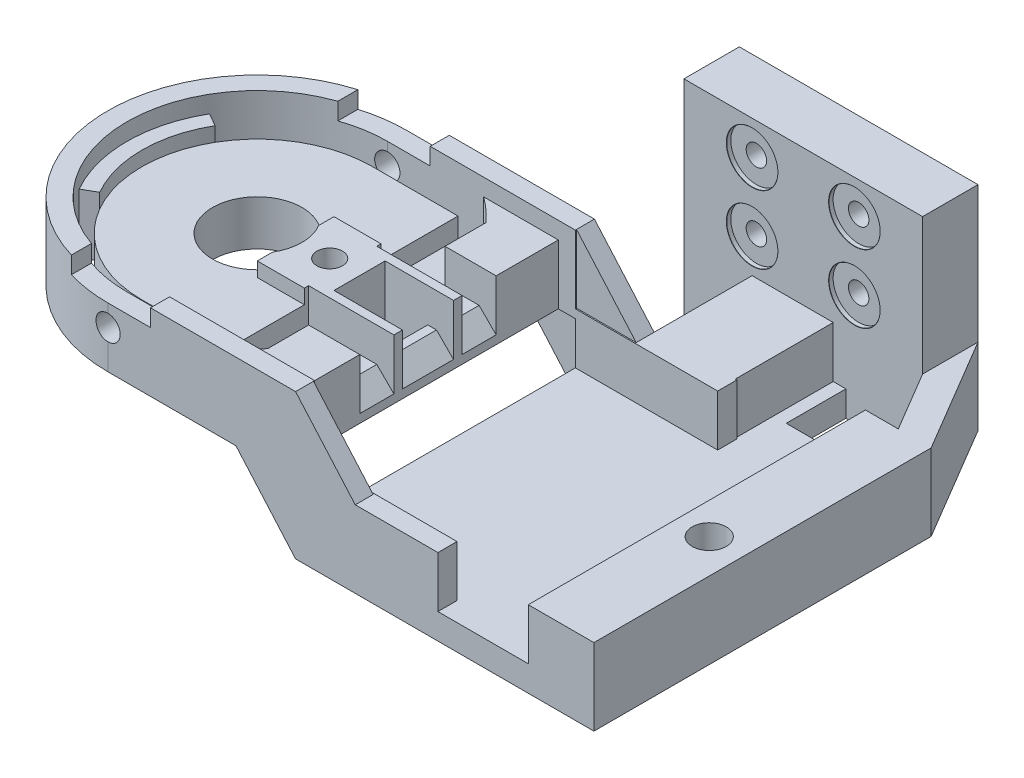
ISO-10303-21;
HEADER;
FILE_DESCRIPTION(('STEP AP214'),'2;1');
FILE_NAME('part.step','',(''),(''),'','','');
FILE_SCHEMA(('AUTOMOTIVE_DESIGN { 1 0 10303 214 1 1 1 1 }'));
ENDSEC;
DATA;
#1=APPLICATION_CONTEXT('core data for automotive mechanical design processes');
#2=APPLICATION_PROTOCOL_DEFINITION('international standard','automotive_design',2000,#1);
#3=PRODUCT_CONTEXT('',#1,'mechanical');
#4=PRODUCT('Part','Part','',(#3));
#5=PRODUCT_RELATED_PRODUCT_CATEGORY('part','',(#4));
#6=PRODUCT_DEFINITION_FORMATION('','',#4);
#7=PRODUCT_DEFINITION_CONTEXT('part definition',#1,'design');
#8=PRODUCT_DEFINITION('design','',#6,#7);
#9=PRODUCT_DEFINITION_SHAPE('','',#8);
#10=(LENGTH_UNIT() NAMED_UNIT(*) SI_UNIT(.MILLI.,.METRE.));
#11=(NAMED_UNIT(*) PLANE_ANGLE_UNIT() SI_UNIT($,.RADIAN.));
#12=(NAMED_UNIT(*) SI_UNIT($,.STERADIAN.) SOLID_ANGLE_UNIT());
#13=UNCERTAINTY_MEASURE_WITH_UNIT(LENGTH_MEASURE(1.E-05),#10,'distance_accuracy_value','');
#14=(GEOMETRIC_REPRESENTATION_CONTEXT(3) GLOBAL_UNCERTAINTY_ASSIGNED_CONTEXT((#13)) GLOBAL_UNIT_ASSIGNED_CONTEXT((#10,
#11,#12)) REPRESENTATION_CONTEXT('',''));
#15=CARTESIAN_POINT('',(0.,0.,0.));
#16=DIRECTION('',(0.,0.,1.));
#17=DIRECTION('',(1.,0.,0.));
#18=AXIS2_PLACEMENT_3D('',#15,#16,#17);
#19=CARTESIAN_POINT('',(38.025,9.,-25.0294293));
#20=DIRECTION('',(-1.,0.,0.));
#21=DIRECTION('',(0.,0.,1.));
#22=AXIS2_PLACEMENT_3D('',#19,#20,#21);
#23=PLANE('',#22);
#24=DIRECTION('',(0.,0.,-1.));
#25=VECTOR('',#24,1.);
#26=CARTESIAN_POINT('',(38.025,3.,-25.0294293));
#27=LINE('',#26,#25);
#28=CARTESIAN_POINT('',(38.025,3.,-22.0294293));
#29=VERTEX_POINT('',#28);
#30=CARTESIAN_POINT('',(38.025,3.,-29.0294293));
#31=VERTEX_POINT('',#30);
#32=EDGE_CURVE('E643',#29,#31,#27,.T.);
#33=ORIENTED_EDGE('',*,*,#32,.F.);
#34=DIRECTION('',(0.,-1.,0.));
#35=VECTOR('',#34,1.);
#36=CARTESIAN_POINT('',(38.025,9.,-22.0294293));
#37=LINE('',#36,#35);
#38=CARTESIAN_POINT('',(38.025,0.,-22.0294293));
#39=VERTEX_POINT('',#38);
#40=EDGE_CURVE('E978',#29,#39,#37,.T.);
#41=ORIENTED_EDGE('',*,*,#40,.T.);
#42=DIRECTION('',(0.,0.,1.));
#43=VECTOR('',#42,1.);
#44=CARTESIAN_POINT('',(38.025,0.,-25.0294293));
#45=LINE('',#44,#43);
#46=CARTESIAN_POINT('',(38.025,0.,-29.0294293));
#47=VERTEX_POINT('',#46);
#48=EDGE_CURVE('E972',#47,#39,#45,.T.);
#49=ORIENTED_EDGE('',*,*,#48,.F.);
#50=DIRECTION('',(0.,-1.,0.));
#51=VECTOR('',#50,1.);
#52=CARTESIAN_POINT('',(38.025,9.,-29.0294293));
#53=LINE('',#52,#51);
#54=EDGE_CURVE('E1050',#31,#47,#53,.T.);
#55=ORIENTED_EDGE('',*,*,#54,.F.);
#56=EDGE_LOOP('',(#33,#41,#49,#55));
#57=FACE_BOUND('',#56,.T.);
#58=ADVANCED_FACE('F53',(#57),#23,.F.);
#59=CARTESIAN_POINT('',(27.025,-0.00999999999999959,-22.0294293));
#60=DIRECTION('',(0.,0.,1.));
#61=DIRECTION('',(1.,0.,0.));
#62=AXIS2_PLACEMENT_3D('',#59,#60,#61);
#63=PLANE('',#62);
#64=ORIENTED_EDGE('',*,*,#40,.F.);
#65=DIRECTION('',(1.,0.,0.));
#66=VECTOR('',#65,1.);
#67=CARTESIAN_POINT('',(27.025,3.,-22.0294293));
#68=LINE('',#67,#66);
#69=CARTESIAN_POINT('',(47.325,3.,-22.0294293));
#70=VERTEX_POINT('',#69);
#71=EDGE_CURVE('E1044',#29,#70,#68,.T.);
#72=ORIENTED_EDGE('',*,*,#71,.T.);
#73=DIRECTION('',(0.,1.,0.));
#74=VECTOR('',#73,1.);
#75=CARTESIAN_POINT('',(47.325,-0.00999999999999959,-22.0294293));
#76=LINE('',#75,#74);
#77=CARTESIAN_POINT('',(47.325,9.,-22.0294293));
#78=VERTEX_POINT('',#77);
#79=EDGE_CURVE('E1040',#70,#78,#76,.T.);
#80=ORIENTED_EDGE('',*,*,#79,.T.);
#81=DIRECTION('',(1.,0.,0.));
#82=VECTOR('',#81,1.);
#83=CARTESIAN_POINT('',(55.025,9.,-22.0294293));
#84=LINE('',#83,#82);
#85=CARTESIAN_POINT('',(51.1731481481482,9.,-22.0294293));
#86=VERTEX_POINT('',#85);
#87=EDGE_CURVE('E980',#78,#86,#84,.T.);
#88=ORIENTED_EDGE('',*,*,#87,.T.);
#89=DIRECTION('',(0.,-1.,0.));
#90=VECTOR('',#89,1.);
#91=CARTESIAN_POINT('',(51.1731481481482,24.6923548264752,-22.0294293));
#92=LINE('',#91,#90);
#93=CARTESIAN_POINT('',(51.1731481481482,0.,-22.0294293));
#94=VERTEX_POINT('',#93);
#95=EDGE_CURVE('E681',#86,#94,#92,.T.);
#96=ORIENTED_EDGE('',*,*,#95,.T.);
#97=DIRECTION('',(1.,0.,0.));
#98=VECTOR('',#97,1.);
#99=CARTESIAN_POINT('',(0.,0.,-22.0294293));
#100=LINE('',#99,#98);
#101=EDGE_CURVE('E981',#39,#94,#100,.T.);
#102=ORIENTED_EDGE('',*,*,#101,.F.);
#103=EDGE_LOOP('',(#64,#72,#80,#88,#96,#102));
#104=FACE_BOUND('',#103,.T.);
#105=ADVANCED_FACE('F1624',(#104),#63,.F.);
#106=CARTESIAN_POINT('',(47.025,0.,-6.99999999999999));
#107=DIRECTION('',(1.,0.,0.));
#108=DIRECTION('',(0.,0.,-1.));
#109=AXIS2_PLACEMENT_3D('',#106,#107,#108);
#110=PLANE('',#109);
#111=DIRECTION('',(0.,-1.,0.));
#112=VECTOR('',#111,1.);
#113=CARTESIAN_POINT('',(47.025,25.,-29.0294293));
#114=LINE('',#113,#112);
#115=CARTESIAN_POINT('',(47.025,25.,-29.0294293));
#116=VERTEX_POINT('',#115);
#117=CARTESIAN_POINT('',(47.025,9.,-29.0294293));
#118=VERTEX_POINT('',#117);
#119=EDGE_CURVE('E1116',#116,#118,#114,.T.);
#120=ORIENTED_EDGE('',*,*,#119,.T.);
#121=DIRECTION('',(0.,0.,1.));
#122=VECTOR('',#121,1.);
#123=CARTESIAN_POINT('',(47.025,9.,-35.5294293));
#124=LINE('',#123,#122);
#125=CARTESIAN_POINT('',(47.025,9.,-35.5294293));
#126=VERTEX_POINT('',#125);
#127=EDGE_CURVE('E69',#126,#118,#124,.T.);
#128=ORIENTED_EDGE('',*,*,#127,.F.);
#129=DIRECTION('',(0.,-1.,0.));
#130=VECTOR('',#129,1.);
#131=CARTESIAN_POINT('',(47.025,9.,-35.5294293));
#132=LINE('',#131,#130);
#133=CARTESIAN_POINT('',(47.025,25.,-35.5294293));
#134=VERTEX_POINT('',#133);
#135=EDGE_CURVE('E1123',#134,#126,#132,.T.);
#136=ORIENTED_EDGE('',*,*,#135,.F.);
#137=DIRECTION('',(0.,0.,-1.));
#138=VECTOR('',#137,1.);
#139=CARTESIAN_POINT('',(47.025,25.,-35.5294293));
#140=LINE('',#139,#138);
#141=EDGE_CURVE('E1107',#116,#134,#140,.T.);
#142=ORIENTED_EDGE('',*,*,#141,.F.);
#143=EDGE_LOOP('',(#120,#128,#136,#142));
#144=FACE_BOUND('',#143,.T.);
#145=ADVANCED_FACE('F1630',(#144),#110,.T.);
#146=CARTESIAN_POINT('',(20.025,-0.01,-24.5227978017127));
#147=DIRECTION('',(-1.,0.,0.));
#148=DIRECTION('',(0.,0.,1.));
#149=AXIS2_PLACEMENT_3D('',#146,#147,#148);
#150=PLANE('',#149);
#151=DIRECTION('',(0.,0.,-1.));
#152=VECTOR('',#151,1.);
#153=CARTESIAN_POINT('',(20.025,8.,-15.29));
#154=LINE('',#153,#152);
#155=CARTESIAN_POINT('',(20.025,8.,-15.29));
#156=VERTEX_POINT('',#155);
#157=CARTESIAN_POINT('',(20.025,8.,-15.5294293));
#158=VERTEX_POINT('',#157);
#159=EDGE_CURVE('E862',#156,#158,#154,.T.);
#160=ORIENTED_EDGE('',*,*,#159,.T.);
#161=DIRECTION('',(0.,-1.,0.));
#162=VECTOR('',#161,1.);
#163=CARTESIAN_POINT('',(20.025,8.,-15.5294293));
#164=LINE('',#163,#162);
#165=CARTESIAN_POINT('',(20.025,0.,-15.5294293));
#166=VERTEX_POINT('',#165);
#167=EDGE_CURVE('E691',#158,#166,#164,.T.);
#168=ORIENTED_EDGE('',*,*,#167,.T.);
#169=DIRECTION('',(0.,0.,1.));
#170=VECTOR('',#169,1.);
#171=CARTESIAN_POINT('',(20.025,0.,-3.));
#172=LINE('',#171,#170);
#173=CARTESIAN_POINT('',(20.025,0.,15.5294293));
#174=VERTEX_POINT('',#173);
#175=EDGE_CURVE('E968',#166,#174,#172,.T.);
#176=ORIENTED_EDGE('',*,*,#175,.T.);
#177=DIRECTION('',(0.,1.,0.));
#178=VECTOR('',#177,1.);
#179=CARTESIAN_POINT('',(20.025,0.,15.5294293));
#180=LINE('',#179,#178);
#181=CARTESIAN_POINT('',(20.025,8.,15.5294293));
#182=VERTEX_POINT('',#181);
#183=EDGE_CURVE('E705',#174,#182,#180,.T.);
#184=ORIENTED_EDGE('',*,*,#183,.T.);
#185=DIRECTION('',(0.,0.,-1.));
#186=VECTOR('',#185,1.);
#187=CARTESIAN_POINT('',(20.025,8.,15.29));
#188=LINE('',#187,#186);
#189=CARTESIAN_POINT('',(20.025,8.,15.29));
#190=VERTEX_POINT('',#189);
#191=EDGE_CURVE('E951',#182,#190,#188,.T.);
#192=ORIENTED_EDGE('',*,*,#191,.T.);
#193=DIRECTION('',(0.,-1.,0.));
#194=VECTOR('',#193,1.);
#195=CARTESIAN_POINT('',(20.025,7.,15.29));
#196=LINE('',#195,#194);
#197=CARTESIAN_POINT('',(20.025,3.,15.29));
#198=VERTEX_POINT('',#197);
#199=EDGE_CURVE('E1140',#190,#198,#196,.T.);
#200=ORIENTED_EDGE('',*,*,#199,.T.);
#201=DIRECTION('',(0.,0.,1.));
#202=VECTOR('',#201,1.);
#203=CARTESIAN_POINT('',(20.025,3.,-15.29));
#204=LINE('',#203,#202);
#205=CARTESIAN_POINT('',(20.025,3.,-15.29));
#206=VERTEX_POINT('',#205);
#207=EDGE_CURVE('E1014',#206,#198,#204,.T.);
#208=ORIENTED_EDGE('',*,*,#207,.F.);
#209=DIRECTION('',(0.,-1.,0.));
#210=VECTOR('',#209,1.);
#211=CARTESIAN_POINT('',(20.025,9.,-15.29));
#212=LINE('',#211,#210);
#213=EDGE_CURVE('E1002',#156,#206,#212,.T.);
#214=ORIENTED_EDGE('',*,*,#213,.F.);
#215=EDGE_LOOP('',(#160,#168,#176,#184,#192,#200,#208,#214));
#216=FACE_BOUND('',#215,.T.);
#217=ADVANCED_FACE('F1667',(#216),#150,.T.);
#218=CARTESIAN_POINT('',(-19.5394293,9.,17.5294293));
#219=DIRECTION('',(0.,-1.,0.));
#220=DIRECTION('',(0.,0.,-1.));
#221=AXIS2_PLACEMENT_3D('',#218,#219,#220);
#222=PLANE('',#221);
#223=CARTESIAN_POINT('',(51.025,9.,0.));
#224=DIRECTION('',(0.,1.,0.));
#225=DIRECTION('',(0.,0.,1.));
#226=AXIS2_PLACEMENT_3D('',#223,#224,#225);
#227=CIRCLE('',#226,2.);
#228=CARTESIAN_POINT('',(51.025,9.,2.));
#229=VERTEX_POINT('',#228);
#230=EDGE_CURVE('E863',#229,#229,#227,.F.);
#231=ORIENTED_EDGE('',*,*,#230,.T.);
#232=EDGE_LOOP('',(#231));
#233=FACE_BOUND('',#232,.T.);
#234=DIRECTION('',(1.,0.,0.));
#235=VECTOR('',#234,1.);
#236=CARTESIAN_POINT('',(51.025,9.,17.5294293));
#237=LINE('',#236,#235);
#238=CARTESIAN_POINT('',(47.325,9.,17.5294293));
#239=VERTEX_POINT('',#238);
#240=CARTESIAN_POINT('',(55.025,9.,17.5294293));
#241=VERTEX_POINT('',#240);
#242=EDGE_CURVE('E1146',#239,#241,#237,.T.);
#243=ORIENTED_EDGE('',*,*,#242,.T.);
#244=DIRECTION('',(0.,0.,1.));
#245=VECTOR('',#244,1.);
#246=CARTESIAN_POINT('',(55.025,9.,17.5294293));
#247=LINE('',#246,#245);
#248=CARTESIAN_POINT('',(55.025,9.,-22.0294293));
#249=VERTEX_POINT('',#248);
#250=EDGE_CURVE('E1029',#249,#241,#247,.T.);
#251=ORIENTED_EDGE('',*,*,#250,.F.);
#252=DIRECTION('',(-0.509802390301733,0.,-0.860291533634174));
#253=VECTOR('',#252,1.);
#254=CARTESIAN_POINT('',(55.025,9.,-22.0294293));
#255=LINE('',#254,#253);
#256=EDGE_CURVE('E671',#249,#126,#255,.T.);
#257=ORIENTED_EDGE('',*,*,#256,.T.);
#258=ORIENTED_EDGE('',*,*,#127,.T.);
#259=DIRECTION('',(0.509802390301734,0.,0.860291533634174));
#260=VECTOR('',#259,1.);
#261=CARTESIAN_POINT('',(47.025,9.,-29.0294293));
#262=LINE('',#261,#260);
#263=EDGE_CURVE('E675',#118,#86,#262,.T.);
#264=ORIENTED_EDGE('',*,*,#263,.T.);
#265=ORIENTED_EDGE('',*,*,#87,.F.);
#266=DIRECTION('',(0.,0.,-1.));
#267=VECTOR('',#266,1.);
#268=CARTESIAN_POINT('',(47.325,9.,0.));
#269=LINE('',#268,#267);
#270=EDGE_CURVE('E988',#239,#78,#269,.T.);
#271=ORIENTED_EDGE('',*,*,#270,.F.);
#272=EDGE_LOOP('',(#243,#251,#257,#258,#264,#265,#271));
#273=FACE_BOUND('',#272,.T.);
#274=ADVANCED_FACE('F1715',(#233,#273),#222,.F.);
#275=CARTESIAN_POINT('',(30.025,21.,-29.5294293));
#276=DIRECTION('',(0.,0.,-1.));
#277=DIRECTION('',(-1.,0.,0.));
#278=AXIS2_PLACEMENT_3D('',#275,#276,#277);
#279=PLANE('',#278);
#280=CARTESIAN_POINT('',(27.025,21.,-29.5294293));
#281=DIRECTION('',(0.,0.,1.));
#282=DIRECTION('',(1.,0.,0.));
#283=AXIS2_PLACEMENT_3D('',#280,#281,#282);
#284=CIRCLE('',#283,1.2);
#285=CARTESIAN_POINT('',(28.225,21.,-29.5294293));
#286=VERTEX_POINT('',#285);
#287=EDGE_CURVE('E1090',#286,#286,#284,.T.);
#288=ORIENTED_EDGE('',*,*,#287,.F.);
#289=EDGE_LOOP('',(#288));
#290=FACE_BOUND('',#289,.T.);
#291=CARTESIAN_POINT('',(27.025,21.,-29.5294293));
#292=DIRECTION('',(0.,0.,1.));
#293=DIRECTION('',(1.,0.,0.));
#294=AXIS2_PLACEMENT_3D('',#291,#292,#293);
#295=CIRCLE('',#294,3.);
#296=CARTESIAN_POINT('',(30.025,21.,-29.5294293));
#297=VERTEX_POINT('',#296);
#298=EDGE_CURVE('E1087',#297,#297,#295,.T.);
#299=ORIENTED_EDGE('',*,*,#298,.T.);
#300=EDGE_LOOP('',(#299));
#301=FACE_BOUND('',#300,.T.);
#302=ADVANCED_FACE('F1657',(#290,#301),#279,.F.);
#303=CARTESIAN_POINT('',(42.025,21.,-29.5294293));
#304=DIRECTION('',(0.,0.,-1.));
#305=DIRECTION('',(-1.,0.,0.));
#306=AXIS2_PLACEMENT_3D('',#303,#304,#305);
#307=PLANE('',#306);
#308=CARTESIAN_POINT('',(39.025,21.,-29.5294293));
#309=DIRECTION('',(0.,0.,1.));
#310=DIRECTION('',(1.,0.,0.));
#311=AXIS2_PLACEMENT_3D('',#308,#309,#310);
#312=CIRCLE('',#311,1.2);
#313=CARTESIAN_POINT('',(40.225,21.,-29.5294293));
#314=VERTEX_POINT('',#313);
#315=EDGE_CURVE('E1064',#314,#314,#312,.T.);
#316=ORIENTED_EDGE('',*,*,#315,.F.);
#317=EDGE_LOOP('',(#316));
#318=FACE_BOUND('',#317,.T.);
#319=CARTESIAN_POINT('',(39.025,21.,-29.5294293));
#320=DIRECTION('',(0.,0.,1.));
#321=DIRECTION('',(1.,0.,0.));
#322=AXIS2_PLACEMENT_3D('',#319,#320,#321);
#323=CIRCLE('',#322,3.);
#324=CARTESIAN_POINT('',(42.025,21.,-29.5294293));
#325=VERTEX_POINT('',#324);
#326=EDGE_CURVE('E1061',#325,#325,#323,.T.);
#327=ORIENTED_EDGE('',*,*,#326,.T.);
#328=EDGE_LOOP('',(#327));
#329=FACE_BOUND('',#328,.T.);
#330=ADVANCED_FACE('F1680',(#318,#329),#307,.F.);
#331=CARTESIAN_POINT('',(30.025,13.,-29.5294293));
#332=DIRECTION('',(0.,0.,-1.));
#333=DIRECTION('',(-1.,0.,0.));
#334=AXIS2_PLACEMENT_3D('',#331,#332,#333);
#335=PLANE('',#334);
#336=CARTESIAN_POINT('',(27.025,13.,-29.5294293));
#337=DIRECTION('',(0.,0.,1.));
#338=DIRECTION('',(1.,0.,0.));
#339=AXIS2_PLACEMENT_3D('',#336,#337,#338);
#340=CIRCLE('',#339,1.2);
#341=CARTESIAN_POINT('',(28.225,13.,-29.5294293));
#342=VERTEX_POINT('',#341);
#343=EDGE_CURVE('E1077',#342,#342,#340,.T.);
#344=ORIENTED_EDGE('',*,*,#343,.F.);
#345=EDGE_LOOP('',(#344));
#346=FACE_BOUND('',#345,.T.);
#347=CARTESIAN_POINT('',(27.025,13.,-29.5294293));
#348=DIRECTION('',(0.,0.,1.));
#349=DIRECTION('',(1.,0.,0.));
#350=AXIS2_PLACEMENT_3D('',#347,#348,#349);
#351=CIRCLE('',#350,3.);
#352=CARTESIAN_POINT('',(30.025,13.,-29.5294293));
#353=VERTEX_POINT('',#352);
#354=EDGE_CURVE('E1074',#353,#353,#351,.T.);
#355=ORIENTED_EDGE('',*,*,#354,.T.);
#356=EDGE_LOOP('',(#355));
#357=FACE_BOUND('',#356,.T.);
#358=ADVANCED_FACE('F1683',(#346,#357),#335,.F.);
#359=CARTESIAN_POINT('',(42.025,13.,-29.5294293));
#360=DIRECTION('',(0.,0.,-1.));
#361=DIRECTION('',(-1.,0.,0.));
#362=AXIS2_PLACEMENT_3D('',#359,#360,#361);
#363=PLANE('',#362);
#364=CARTESIAN_POINT('',(39.025,13.,-29.5294293));
#365=DIRECTION('',(0.,0.,1.));
#366=DIRECTION('',(1.,0.,0.));
#367=AXIS2_PLACEMENT_3D('',#364,#365,#366);
#368=CIRCLE('',#367,1.2);
#369=CARTESIAN_POINT('',(40.225,13.,-29.5294293));
#370=VERTEX_POINT('',#369);
#371=EDGE_CURVE('E1103',#370,#370,#368,.T.);
#372=ORIENTED_EDGE('',*,*,#371,.F.);
#373=EDGE_LOOP('',(#372));
#374=FACE_BOUND('',#373,.T.);
#375=CARTESIAN_POINT('',(39.025,13.,-29.5294293));
#376=DIRECTION('',(0.,0.,1.));
#377=DIRECTION('',(1.,0.,0.));
#378=AXIS2_PLACEMENT_3D('',#375,#376,#377);
#379=CIRCLE('',#378,3.);
#380=CARTESIAN_POINT('',(42.025,13.,-29.5294293));
#381=VERTEX_POINT('',#380);
#382=EDGE_CURVE('E1100',#381,#381,#379,.T.);
#383=ORIENTED_EDGE('',*,*,#382,.T.);
#384=EDGE_LOOP('',(#383));
#385=FACE_BOUND('',#384,.T.);
#386=ADVANCED_FACE('F1701',(#374,#385),#363,.F.);
#387=CARTESIAN_POINT('',(27.025,21.,-29.0294293));
#388=DIRECTION('',(0.,0.,1.));
#389=DIRECTION('',(1.,0.,0.));
#390=AXIS2_PLACEMENT_3D('',#387,#388,#389);
#391=CYLINDRICAL_SURFACE('',#390,3.);
#392=ORIENTED_EDGE('',*,*,#298,.F.);
#393=EDGE_LOOP('',(#392));
#394=FACE_BOUND('',#393,.T.);
#395=CARTESIAN_POINT('',(27.025,21.,-29.0544293));
#396=DIRECTION('',(0.,0.,1.));
#397=DIRECTION('',(1.,0.,0.));
#398=AXIS2_PLACEMENT_3D('',#395,#396,#397);
#399=CIRCLE('',#398,3.);
#400=CARTESIAN_POINT('',(30.025,21.,-29.0544293));
#401=VERTEX_POINT('',#400);
#402=EDGE_CURVE('E1084',#401,#401,#399,.T.);
#403=ORIENTED_EDGE('',*,*,#402,.T.);
#404=EDGE_LOOP('',(#403));
#405=FACE_BOUND('',#404,.T.);
#406=ADVANCED_FACE('F1697',(#394,#405),#391,.F.);
#407=CARTESIAN_POINT('',(27.025,13.,-29.0294293));
#408=DIRECTION('',(0.,0.,1.));
#409=DIRECTION('',(1.,0.,0.));
#410=AXIS2_PLACEMENT_3D('',#407,#408,#409);
#411=CYLINDRICAL_SURFACE('',#410,3.);
#412=ORIENTED_EDGE('',*,*,#354,.F.);
#413=EDGE_LOOP('',(#412));
#414=FACE_BOUND('',#413,.T.);
#415=CARTESIAN_POINT('',(27.025,13.,-29.0544293));
#416=DIRECTION('',(0.,0.,1.));
#417=DIRECTION('',(1.,0.,0.));
#418=AXIS2_PLACEMENT_3D('',#415,#416,#417);
#419=CIRCLE('',#418,3.);
#420=CARTESIAN_POINT('',(30.025,13.,-29.0544293));
#421=VERTEX_POINT('',#420);
#422=EDGE_CURVE('E1071',#421,#421,#419,.T.);
#423=ORIENTED_EDGE('',*,*,#422,.T.);
#424=EDGE_LOOP('',(#423));
#425=FACE_BOUND('',#424,.T.);
#426=ADVANCED_FACE('F1678',(#414,#425),#411,.F.);
#427=CARTESIAN_POINT('',(39.025,21.,-29.0294293));
#428=DIRECTION('',(0.,0.,1.));
#429=DIRECTION('',(1.,0.,0.));
#430=AXIS2_PLACEMENT_3D('',#427,#428,#429);
#431=CYLINDRICAL_SURFACE('',#430,3.);
#432=ORIENTED_EDGE('',*,*,#326,.F.);
#433=EDGE_LOOP('',(#432));
#434=FACE_BOUND('',#433,.T.);
#435=CARTESIAN_POINT('',(39.025,21.,-29.0544293));
#436=DIRECTION('',(0.,0.,1.));
#437=DIRECTION('',(1.,0.,0.));
#438=AXIS2_PLACEMENT_3D('',#435,#436,#437);
#439=CIRCLE('',#438,3.);
#440=CARTESIAN_POINT('',(42.025,21.,-29.0544293));
#441=VERTEX_POINT('',#440);
#442=EDGE_CURVE('E1058',#441,#441,#439,.T.);
#443=ORIENTED_EDGE('',*,*,#442,.T.);
#444=EDGE_LOOP('',(#443));
#445=FACE_BOUND('',#444,.T.);
#446=ADVANCED_FACE('F1674',(#434,#445),#431,.F.);
#447=CARTESIAN_POINT('',(39.025,13.,-29.0294293));
#448=DIRECTION('',(0.,0.,1.));
#449=DIRECTION('',(1.,0.,0.));
#450=AXIS2_PLACEMENT_3D('',#447,#448,#449);
#451=CYLINDRICAL_SURFACE('',#450,3.);
#452=ORIENTED_EDGE('',*,*,#382,.F.);
#453=EDGE_LOOP('',(#452));
#454=FACE_BOUND('',#453,.T.);
#455=CARTESIAN_POINT('',(39.025,13.,-29.0544293));
#456=DIRECTION('',(0.,0.,1.));
#457=DIRECTION('',(1.,0.,0.));
#458=AXIS2_PLACEMENT_3D('',#455,#456,#457);
#459=CIRCLE('',#458,3.);
#460=CARTESIAN_POINT('',(42.025,13.,-29.0544293));
#461=VERTEX_POINT('',#460);
#462=EDGE_CURVE('E1097',#461,#461,#459,.T.);
#463=ORIENTED_EDGE('',*,*,#462,.T.);
#464=EDGE_LOOP('',(#463));
#465=FACE_BOUND('',#464,.T.);
#466=ADVANCED_FACE('F1677',(#454,#465),#451,.F.);
#467=CARTESIAN_POINT('',(27.025,21.,-29.0294293));
#468=DIRECTION('',(0.,0.,1.));
#469=DIRECTION('',(1.,0.,0.));
#470=AXIS2_PLACEMENT_3D('',#467,#468,#469);
#471=CYLINDRICAL_SURFACE('',#470,1.2);
#472=CARTESIAN_POINT('',(27.025,21.,-35.5294293));
#473=DIRECTION('',(0.,0.,-1.));
#474=DIRECTION('',(-1.,0.,0.));
#475=AXIS2_PLACEMENT_3D('',#472,#473,#474);
#476=CIRCLE('',#475,1.2);
#477=CARTESIAN_POINT('',(25.825,21.,-35.5294293));
#478=VERTEX_POINT('',#477);
#479=EDGE_CURVE('E1093',#478,#478,#476,.T.);
#480=ORIENTED_EDGE('',*,*,#479,.T.);
#481=EDGE_LOOP('',(#480));
#482=FACE_BOUND('',#481,.T.);
#483=ORIENTED_EDGE('',*,*,#287,.T.);
#484=EDGE_LOOP('',(#483));
#485=FACE_BOUND('',#484,.T.);
#486=ADVANCED_FACE('F1689',(#482,#485),#471,.F.);
#487=CARTESIAN_POINT('',(39.025,21.,-29.0294293));
#488=DIRECTION('',(0.,0.,1.));
#489=DIRECTION('',(1.,0.,0.));
#490=AXIS2_PLACEMENT_3D('',#487,#488,#489);
#491=CYLINDRICAL_SURFACE('',#490,1.2);
#492=CARTESIAN_POINT('',(39.025,21.,-35.5294293));
#493=DIRECTION('',(0.,0.,-1.));
#494=DIRECTION('',(-1.,0.,0.));
#495=AXIS2_PLACEMENT_3D('',#492,#493,#494);
#496=CIRCLE('',#495,1.2);
#497=CARTESIAN_POINT('',(37.825,21.,-35.5294293));
#498=VERTEX_POINT('',#497);
#499=EDGE_CURVE('E1067',#498,#498,#496,.T.);
#500=ORIENTED_EDGE('',*,*,#499,.T.);
#501=EDGE_LOOP('',(#500));
#502=FACE_BOUND('',#501,.T.);
#503=ORIENTED_EDGE('',*,*,#315,.T.);
#504=EDGE_LOOP('',(#503));
#505=FACE_BOUND('',#504,.T.);
#506=ADVANCED_FACE('F1685',(#502,#505),#491,.F.);
#507=CARTESIAN_POINT('',(27.025,13.,-29.0294293));
#508=DIRECTION('',(0.,0.,1.));
#509=DIRECTION('',(1.,0.,0.));
#510=AXIS2_PLACEMENT_3D('',#507,#508,#509);
#511=CYLINDRICAL_SURFACE('',#510,1.2);
#512=CARTESIAN_POINT('',(27.025,13.,-35.5294293));
#513=DIRECTION('',(0.,0.,-1.));
#514=DIRECTION('',(-1.,0.,0.));
#515=AXIS2_PLACEMENT_3D('',#512,#513,#514);
#516=CIRCLE('',#515,1.2);
#517=CARTESIAN_POINT('',(25.825,13.,-35.5294293));
#518=VERTEX_POINT('',#517);
#519=EDGE_CURVE('E1080',#518,#518,#516,.T.);
#520=ORIENTED_EDGE('',*,*,#519,.T.);
#521=EDGE_LOOP('',(#520));
#522=FACE_BOUND('',#521,.T.);
#523=ORIENTED_EDGE('',*,*,#343,.T.);
#524=EDGE_LOOP('',(#523));
#525=FACE_BOUND('',#524,.T.);
#526=ADVANCED_FACE('F1688',(#522,#525),#511,.F.);
#527=CARTESIAN_POINT('',(39.025,13.,-29.0294293));
#528=DIRECTION('',(0.,0.,1.));
#529=DIRECTION('',(1.,0.,0.));
#530=AXIS2_PLACEMENT_3D('',#527,#528,#529);
#531=CYLINDRICAL_SURFACE('',#530,1.2);
#532=CARTESIAN_POINT('',(39.025,13.,-35.5294293));
#533=DIRECTION('',(0.,0.,-1.));
#534=DIRECTION('',(-1.,0.,0.));
#535=AXIS2_PLACEMENT_3D('',#532,#533,#534);
#536=CIRCLE('',#535,1.2);
#537=CARTESIAN_POINT('',(37.825,13.,-35.5294293));
#538=VERTEX_POINT('',#537);
#539=EDGE_CURVE('E1106',#538,#538,#536,.T.);
#540=ORIENTED_EDGE('',*,*,#539,.T.);
#541=EDGE_LOOP('',(#540));
#542=FACE_BOUND('',#541,.T.);
#543=ORIENTED_EDGE('',*,*,#371,.T.);
#544=EDGE_LOOP('',(#543));
#545=FACE_BOUND('',#544,.T.);
#546=ADVANCED_FACE('F1705',(#542,#545),#531,.F.);
#547=CARTESIAN_POINT('',(27.025,21.,-29.0294293));
#548=DIRECTION('',(0.,0.,1.));
#549=DIRECTION('',(1.,0.,0.));
#550=AXIS2_PLACEMENT_3D('',#547,#548,#549);
#551=CONICAL_SURFACE('',#550,3.025,0.78539816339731);
#552=ORIENTED_EDGE('',*,*,#402,.F.);
#553=EDGE_LOOP('',(#552));
#554=FACE_BOUND('',#553,.T.);
#555=CARTESIAN_POINT('',(27.025,21.,-29.0294293));
#556=DIRECTION('',(0.,0.,1.));
#557=DIRECTION('',(1.,0.,0.));
#558=AXIS2_PLACEMENT_3D('',#555,#556,#557);
#559=CIRCLE('',#558,3.025);
#560=CARTESIAN_POINT('',(30.05,21.,-29.0294293));
#561=VERTEX_POINT('',#560);
#562=EDGE_CURVE('E1081',#561,#561,#559,.T.);
#563=ORIENTED_EDGE('',*,*,#562,.T.);
#564=EDGE_LOOP('',(#563));
#565=FACE_BOUND('',#564,.T.);
#566=ADVANCED_FACE('F1693',(#554,#565),#551,.F.);
#567=CARTESIAN_POINT('',(27.025,13.,-29.0294293));
#568=DIRECTION('',(0.,0.,1.));
#569=DIRECTION('',(1.,0.,0.));
#570=AXIS2_PLACEMENT_3D('',#567,#568,#569);
#571=CONICAL_SURFACE('',#570,3.025,0.78539816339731);
#572=ORIENTED_EDGE('',*,*,#422,.F.);
#573=EDGE_LOOP('',(#572));
#574=FACE_BOUND('',#573,.T.);
#575=CARTESIAN_POINT('',(27.025,13.,-29.0294293));
#576=DIRECTION('',(0.,0.,1.));
#577=DIRECTION('',(1.,0.,0.));
#578=AXIS2_PLACEMENT_3D('',#575,#576,#577);
#579=CIRCLE('',#578,3.025);
#580=CARTESIAN_POINT('',(30.05,13.,-29.0294293));
#581=VERTEX_POINT('',#580);
#582=EDGE_CURVE('E1068',#581,#581,#579,.T.);
#583=ORIENTED_EDGE('',*,*,#582,.T.);
#584=EDGE_LOOP('',(#583));
#585=FACE_BOUND('',#584,.T.);
#586=ADVANCED_FACE('F1672',(#574,#585),#571,.F.);
#587=CARTESIAN_POINT('',(39.025,21.,-29.0294293));
#588=DIRECTION('',(0.,0.,1.));
#589=DIRECTION('',(1.,0.,0.));
#590=AXIS2_PLACEMENT_3D('',#587,#588,#589);
#591=CONICAL_SURFACE('',#590,3.025,0.78539816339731);
#592=ORIENTED_EDGE('',*,*,#442,.F.);
#593=EDGE_LOOP('',(#592));
#594=FACE_BOUND('',#593,.T.);
#595=CARTESIAN_POINT('',(39.025,21.,-29.0294293));
#596=DIRECTION('',(0.,0.,1.));
#597=DIRECTION('',(1.,0.,0.));
#598=AXIS2_PLACEMENT_3D('',#595,#596,#597);
#599=CIRCLE('',#598,3.025);
#600=CARTESIAN_POINT('',(42.05,21.,-29.0294293));
#601=VERTEX_POINT('',#600);
#602=EDGE_CURVE('E1052',#601,#601,#599,.T.);
#603=ORIENTED_EDGE('',*,*,#602,.T.);
#604=EDGE_LOOP('',(#603));
#605=FACE_BOUND('',#604,.T.);
#606=ADVANCED_FACE('F1668',(#594,#605),#591,.F.);
#607=CARTESIAN_POINT('',(39.025,13.,-29.0294293));
#608=DIRECTION('',(0.,0.,1.));
#609=DIRECTION('',(1.,0.,0.));
#610=AXIS2_PLACEMENT_3D('',#607,#608,#609);
#611=CONICAL_SURFACE('',#610,3.025,0.78539816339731);
#612=ORIENTED_EDGE('',*,*,#462,.F.);
#613=EDGE_LOOP('',(#612));
#614=FACE_BOUND('',#613,.T.);
#615=CARTESIAN_POINT('',(39.025,13.,-29.0294293));
#616=DIRECTION('',(0.,0.,1.));
#617=DIRECTION('',(1.,0.,0.));
#618=AXIS2_PLACEMENT_3D('',#615,#616,#617);
#619=CIRCLE('',#618,3.025);
#620=CARTESIAN_POINT('',(42.05,13.,-29.0294293));
#621=VERTEX_POINT('',#620);
#622=EDGE_CURVE('E1094',#621,#621,#619,.T.);
#623=ORIENTED_EDGE('',*,*,#622,.T.);
#624=EDGE_LOOP('',(#623));
#625=FACE_BOUND('',#624,.T.);
#626=ADVANCED_FACE('F1671',(#614,#625),#611,.F.);
#627=CARTESIAN_POINT('',(-8.,25.,-7.));
#628=DIRECTION('',(0.,-1.,0.));
#629=DIRECTION('',(0.,0.,-1.));
#630=AXIS2_PLACEMENT_3D('',#627,#628,#629);
#631=PLANE('',#630);
#632=ORIENTED_EDGE('',*,*,#141,.T.);
#633=DIRECTION('',(-1.,0.,0.));
#634=VECTOR('',#633,1.);
#635=CARTESIAN_POINT('',(47.025,25.,-35.5294293));
#636=LINE('',#635,#634);
#637=CARTESIAN_POINT('',(19.025,25.,-35.5294293));
#638=VERTEX_POINT('',#637);
#639=EDGE_CURVE('E1110',#134,#638,#636,.T.);
#640=ORIENTED_EDGE('',*,*,#639,.T.);
#641=DIRECTION('',(0.,0.,1.));
#642=VECTOR('',#641,1.);
#643=CARTESIAN_POINT('',(19.025,25.,-35.5294293));
#644=LINE('',#643,#642);
#645=CARTESIAN_POINT('',(19.025,25.,-29.0294293));
#646=VERTEX_POINT('',#645);
#647=EDGE_CURVE('E1112',#638,#646,#644,.T.);
#648=ORIENTED_EDGE('',*,*,#647,.T.);
#649=DIRECTION('',(1.,0.,0.));
#650=VECTOR('',#649,1.);
#651=CARTESIAN_POINT('',(47.025,25.,-29.0294293));
#652=LINE('',#651,#650);
#653=EDGE_CURVE('E1114',#646,#116,#652,.T.);
#654=ORIENTED_EDGE('',*,*,#653,.T.);
#655=EDGE_LOOP('',(#632,#640,#648,#654));
#656=FACE_BOUND('',#655,.T.);
#657=ADVANCED_FACE('F1722',(#656),#631,.F.);
#658=CARTESIAN_POINT('',(55.035,12.5325007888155,-35.5294293));
#659=DIRECTION('',(0.,0.,-1.));
#660=DIRECTION('',(-1.,0.,0.));
#661=AXIS2_PLACEMENT_3D('',#658,#659,#660);
#662=PLANE('',#661);
#663=DIRECTION('',(-1.,0.,0.));
#664=VECTOR('',#663,1.);
#665=CARTESIAN_POINT('',(47.025,0.,-35.5294293));
#666=LINE('',#665,#664);
#667=CARTESIAN_POINT('',(47.025,0.,-35.5294293));
#668=VERTEX_POINT('',#667);
#669=CARTESIAN_POINT('',(19.025,0.,-35.5294293));
#670=VERTEX_POINT('',#669);
#671=EDGE_CURVE('E858',#668,#670,#666,.T.);
#672=ORIENTED_EDGE('',*,*,#671,.T.);
#673=DIRECTION('',(0.,-1.,0.));
#674=VECTOR('',#673,1.);
#675=CARTESIAN_POINT('',(19.025,25.,-35.5294293));
#676=LINE('',#675,#674);
#677=EDGE_CURVE('E1120',#638,#670,#676,.T.);
#678=ORIENTED_EDGE('',*,*,#677,.F.);
#679=ORIENTED_EDGE('',*,*,#639,.F.);
#680=ORIENTED_EDGE('',*,*,#135,.T.);
#681=DIRECTION('',(0.,-1.,0.));
#682=VECTOR('',#681,1.);
#683=CARTESIAN_POINT('',(47.025,24.6923548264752,-35.5294293));
#684=LINE('',#683,#682);
#685=EDGE_CURVE('E672',#126,#668,#684,.T.);
#686=ORIENTED_EDGE('',*,*,#685,.T.);
#687=EDGE_LOOP('',(#672,#678,#679,#680,#686));
#688=FACE_BOUND('',#687,.T.);
#689=ORIENTED_EDGE('',*,*,#539,.F.);
#690=EDGE_LOOP('',(#689));
#691=FACE_BOUND('',#690,.T.);
#692=ORIENTED_EDGE('',*,*,#519,.F.);
#693=EDGE_LOOP('',(#692));
#694=FACE_BOUND('',#693,.T.);
#695=DIRECTION('',(0.,-1.,0.));
#696=VECTOR('',#695,1.);
#697=CARTESIAN_POINT('',(20.025,0.,-35.5294293));
#698=LINE('',#697,#696);
#699=CARTESIAN_POINT('',(20.025,17.,-35.5294293));
#700=VERTEX_POINT('',#699);
#701=CARTESIAN_POINT('',(20.025,12.5325007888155,-35.5294293));
#702=VERTEX_POINT('',#701);
#703=EDGE_CURVE('E1156',#700,#702,#698,.T.);
#704=ORIENTED_EDGE('',*,*,#703,.T.);
#705=ORIENTED_EDGE('',*,*,#703,.F.);
#706=EDGE_LOOP('',(#704,#705));
#707=FACE_BOUND('',#706,.T.);
#708=ORIENTED_EDGE('',*,*,#499,.F.);
#709=EDGE_LOOP('',(#708));
#710=FACE_BOUND('',#709,.T.);
#711=ORIENTED_EDGE('',*,*,#479,.F.);
#712=EDGE_LOOP('',(#711));
#713=FACE_BOUND('',#712,.T.);
#714=ADVANCED_FACE('F1735',(#688,#691,#694,#707,#710,#713),#662,.T.);
#715=CARTESIAN_POINT('',(19.025,9.,-44.5294293));
#716=DIRECTION('',(1.,0.,0.));
#717=DIRECTION('',(0.,1.,0.));
#718=AXIS2_PLACEMENT_3D('',#715,#716,#717);
#719=PLANE('',#718);
#720=ORIENTED_EDGE('',*,*,#677,.T.);
#721=DIRECTION('',(0.,0.,1.));
#722=VECTOR('',#721,1.);
#723=CARTESIAN_POINT('',(19.025,0.,-44.5294293));
#724=LINE('',#723,#722);
#725=CARTESIAN_POINT('',(19.025,0.,-29.0294293));
#726=VERTEX_POINT('',#725);
#727=EDGE_CURVE('E855',#670,#726,#724,.T.);
#728=ORIENTED_EDGE('',*,*,#727,.T.);
#729=DIRECTION('',(0.,-1.,0.));
#730=VECTOR('',#729,1.);
#731=CARTESIAN_POINT('',(19.025,25.,-29.0294293));
#732=LINE('',#731,#730);
#733=EDGE_CURVE('E1117',#646,#726,#732,.T.);
#734=ORIENTED_EDGE('',*,*,#733,.F.);
#735=ORIENTED_EDGE('',*,*,#647,.F.);
#736=EDGE_LOOP('',(#720,#728,#734,#735));
#737=FACE_BOUND('',#736,.T.);
#738=ADVANCED_FACE('F1879',(#737),#719,.F.);
#739=CARTESIAN_POINT('',(-2.,-19.9151578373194,-13.5294293));
#740=DIRECTION('',(0.,0.,1.));
#741=DIRECTION('',(1.,0.,0.));
#742=AXIS2_PLACEMENT_3D('',#739,#740,#741);
#743=PLANE('',#742);
#744=DIRECTION('',(0.,1.,0.));
#745=VECTOR('',#744,1.);
#746=CARTESIAN_POINT('',(-2.,-19.9151578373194,-13.5294293));
#747=LINE('',#746,#745);
#748=CARTESIAN_POINT('',(-2.,8.,-13.5294293));
#749=VERTEX_POINT('',#748);
#750=CARTESIAN_POINT('',(-2.,13.31,-13.5294293));
#751=VERTEX_POINT('',#750);
#752=EDGE_CURVE('E915',#749,#751,#747,.T.);
#753=ORIENTED_EDGE('',*,*,#752,.T.);
#754=DIRECTION('',(1.,0.,0.));
#755=VECTOR('',#754,1.);
#756=CARTESIAN_POINT('',(-2.,13.31,-13.5294293));
#757=LINE('',#756,#755);
#758=CARTESIAN_POINT('',(8.025,13.31,-13.5294293));
#759=VERTEX_POINT('',#758);
#760=EDGE_CURVE('E1321',#751,#759,#757,.T.);
#761=ORIENTED_EDGE('',*,*,#760,.T.);
#762=DIRECTION('',(0.,1.,0.));
#763=VECTOR('',#762,1.);
#764=CARTESIAN_POINT('',(8.025,-2.81340011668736,-13.5294293));
#765=LINE('',#764,#763);
#766=CARTESIAN_POINT('',(8.025,11.,-13.5294293));
#767=VERTEX_POINT('',#766);
#768=EDGE_CURVE('E1536',#767,#759,#765,.T.);
#769=ORIENTED_EDGE('',*,*,#768,.F.);
#770=DIRECTION('',(-1.,0.,0.));
#771=VECTOR('',#770,1.);
#772=CARTESIAN_POINT('',(-2.,11.,-13.5294293));
#773=LINE('',#772,#771);
#774=CARTESIAN_POINT('',(11.3399603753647,11.,-13.5294293));
#775=VERTEX_POINT('',#774);
#776=EDGE_CURVE('E1530',#775,#767,#773,.T.);
#777=ORIENTED_EDGE('',*,*,#776,.F.);
#778=DIRECTION('',(0.,1.,0.));
#779=VECTOR('',#778,1.);
#780=CARTESIAN_POINT('',(11.3399603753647,-19.9151578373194,-13.5294293));
#781=LINE('',#780,#779);
#782=CARTESIAN_POINT('',(11.3399603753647,8.,-13.5294293));
#783=VERTEX_POINT('',#782);
#784=EDGE_CURVE('E917',#783,#775,#781,.T.);
#785=ORIENTED_EDGE('',*,*,#784,.F.);
#786=DIRECTION('',(-1.,0.,0.));
#787=VECTOR('',#786,1.);
#788=CARTESIAN_POINT('',(-2.,8.,-13.5294293));
#789=LINE('',#788,#787);
#790=EDGE_CURVE('E925',#783,#749,#789,.T.);
#791=ORIENTED_EDGE('',*,*,#790,.T.);
#792=EDGE_LOOP('',(#753,#761,#769,#777,#785,#791));
#793=FACE_BOUND('',#792,.T.);
#794=ADVANCED_FACE('F1597',(#793),#743,.F.);
#795=CARTESIAN_POINT('',(-2.,-19.9151578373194,0.));
#796=DIRECTION('',(0.,1.,0.));
#797=DIRECTION('',(0.,0.,1.));
#798=AXIS2_PLACEMENT_3D('',#795,#796,#797);
#799=CYLINDRICAL_SURFACE('',#798,13.5294293);
#800=DIRECTION('',(0.,1.,0.));
#801=VECTOR('',#800,1.);
#802=CARTESIAN_POINT('',(-13.7168294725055,-19.9151578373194,-6.76471464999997));
#803=LINE('',#802,#801);
#804=CARTESIAN_POINT('',(-13.7168294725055,8.,-6.76471464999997));
#805=VERTEX_POINT('',#804);
#806=CARTESIAN_POINT('',(-13.7168294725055,13.31,-6.76471464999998));
#807=VERTEX_POINT('',#806);
#808=EDGE_CURVE('E913',#805,#807,#803,.T.);
#809=ORIENTED_EDGE('',*,*,#808,.T.);
#810=CARTESIAN_POINT('',(-2.,13.31,0.));
#811=DIRECTION('',(0.,1.,0.));
#812=DIRECTION('',(0.,0.,1.));
#813=AXIS2_PLACEMENT_3D('',#810,#811,#812);
#814=CIRCLE('',#813,13.5294293);
#815=EDGE_CURVE('E1318',#807,#751,#814,.F.);
#816=ORIENTED_EDGE('',*,*,#815,.T.);
#817=ORIENTED_EDGE('',*,*,#752,.F.);
#818=CARTESIAN_POINT('',(-2.,8.,0.));
#819=DIRECTION('',(0.,1.,0.));
#820=DIRECTION('',(0.,0.,1.));
#821=AXIS2_PLACEMENT_3D('',#818,#819,#820);
#822=CIRCLE('',#821,13.5294293);
#823=EDGE_CURVE('E927',#749,#805,#822,.T.);
#824=ORIENTED_EDGE('',*,*,#823,.T.);
#825=EDGE_LOOP('',(#809,#816,#817,#824));
#826=FACE_BOUND('',#825,.T.);
#827=ADVANCED_FACE('F1965',(#826),#799,.T.);
#828=CARTESIAN_POINT('',(-2.,-19.9151578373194,0.));
#829=DIRECTION('',(0.,1.,0.));
#830=DIRECTION('',(0.,0.,1.));
#831=AXIS2_PLACEMENT_3D('',#828,#829,#830);
#832=CYLINDRICAL_SURFACE('',#831,13.5294293);
#833=DIRECTION('',(0.,1.,0.));
#834=VECTOR('',#833,1.);
#835=CARTESIAN_POINT('',(-2.,-19.9151578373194,13.5294293));
#836=LINE('',#835,#834);
#837=CARTESIAN_POINT('',(-2.,8.,13.5294293));
#838=VERTEX_POINT('',#837);
#839=CARTESIAN_POINT('',(-2.,13.31,13.5294293));
#840=VERTEX_POINT('',#839);
#841=EDGE_CURVE('E887',#838,#840,#836,.T.);
#842=ORIENTED_EDGE('',*,*,#841,.T.);
#843=CARTESIAN_POINT('',(-2.,13.31,0.));
#844=DIRECTION('',(0.,1.,0.));
#845=DIRECTION('',(0.,0.,1.));
#846=AXIS2_PLACEMENT_3D('',#843,#844,#845);
#847=CIRCLE('',#846,13.5294293);
#848=CARTESIAN_POINT('',(-13.7168294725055,13.31,6.76471464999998));
#849=VERTEX_POINT('',#848);
#850=EDGE_CURVE('E1315',#840,#849,#847,.F.);
#851=ORIENTED_EDGE('',*,*,#850,.T.);
#852=DIRECTION('',(0.,1.,0.));
#853=VECTOR('',#852,1.);
#854=CARTESIAN_POINT('',(-13.7168294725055,-19.9151578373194,6.76471464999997));
#855=LINE('',#854,#853);
#856=CARTESIAN_POINT('',(-13.7168294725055,8.,6.76471464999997));
#857=VERTEX_POINT('',#856);
#858=EDGE_CURVE('E889',#857,#849,#855,.T.);
#859=ORIENTED_EDGE('',*,*,#858,.F.);
#860=CARTESIAN_POINT('',(-2.,8.,0.));
#861=DIRECTION('',(0.,1.,0.));
#862=DIRECTION('',(0.,0.,1.));
#863=AXIS2_PLACEMENT_3D('',#860,#861,#862);
#864=CIRCLE('',#863,13.5294293);
#865=EDGE_CURVE('E900',#838,#857,#864,.F.);
#866=ORIENTED_EDGE('',*,*,#865,.F.);
#867=EDGE_LOOP('',(#842,#851,#859,#866));
#868=FACE_BOUND('',#867,.T.);
#869=ADVANCED_FACE('F1972',(#868),#832,.T.);
#870=CARTESIAN_POINT('',(-2.,-19.9151578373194,13.5294293));
#871=DIRECTION('',(0.,0.,1.));
#872=DIRECTION('',(1.,0.,0.));
#873=AXIS2_PLACEMENT_3D('',#870,#871,#872);
#874=PLANE('',#873);
#875=DIRECTION('',(0.,1.,0.));
#876=VECTOR('',#875,1.);
#877=CARTESIAN_POINT('',(11.3399603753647,-19.9151578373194,13.5294293));
#878=LINE('',#877,#876);
#879=CARTESIAN_POINT('',(11.3399603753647,8.,13.5294293));
#880=VERTEX_POINT('',#879);
#881=CARTESIAN_POINT('',(11.3399603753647,11.,13.5294293));
#882=VERTEX_POINT('',#881);
#883=EDGE_CURVE('E885',#880,#882,#878,.T.);
#884=ORIENTED_EDGE('',*,*,#883,.T.);
#885=DIRECTION('',(-1.,0.,0.));
#886=VECTOR('',#885,1.);
#887=CARTESIAN_POINT('',(-2.,11.,13.5294293));
#888=LINE('',#887,#886);
#889=CARTESIAN_POINT('',(8.025,11.,13.5294293));
#890=VERTEX_POINT('',#889);
#891=EDGE_CURVE('E1490',#882,#890,#888,.T.);
#892=ORIENTED_EDGE('',*,*,#891,.T.);
#893=DIRECTION('',(0.,1.,0.));
#894=VECTOR('',#893,1.);
#895=CARTESIAN_POINT('',(8.025,-2.81340011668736,13.5294293));
#896=LINE('',#895,#894);
#897=CARTESIAN_POINT('',(8.025,13.31,13.5294293));
#898=VERTEX_POINT('',#897);
#899=EDGE_CURVE('E1504',#890,#898,#896,.T.);
#900=ORIENTED_EDGE('',*,*,#899,.T.);
#901=DIRECTION('',(-1.,0.,0.));
#902=VECTOR('',#901,1.);
#903=CARTESIAN_POINT('',(-2.,13.31,13.5294293));
#904=LINE('',#903,#902);
#905=EDGE_CURVE('E1312',#898,#840,#904,.T.);
#906=ORIENTED_EDGE('',*,*,#905,.T.);
#907=ORIENTED_EDGE('',*,*,#841,.F.);
#908=DIRECTION('',(-1.,0.,0.));
#909=VECTOR('',#908,1.);
#910=CARTESIAN_POINT('',(-2.,8.,13.5294293));
#911=LINE('',#910,#909);
#912=EDGE_CURVE('E893',#880,#838,#911,.T.);
#913=ORIENTED_EDGE('',*,*,#912,.F.);
#914=EDGE_LOOP('',(#884,#892,#900,#906,#907,#913));
#915=FACE_BOUND('',#914,.T.);
#916=ADVANCED_FACE('F1980',(#915),#874,.T.);
#917=CARTESIAN_POINT('',(14.,8.,3.));
#918=DIRECTION('',(0.,0.,1.));
#919=DIRECTION('',(1.,0.,0.));
#920=AXIS2_PLACEMENT_3D('',#917,#918,#919);
#921=PLANE('',#920);
#922=DIRECTION('',(0.,1.,0.));
#923=VECTOR('',#922,1.);
#924=CARTESIAN_POINT('',(10.,8.,3.));
#925=LINE('',#924,#923);
#926=CARTESIAN_POINT('',(10.,8.,3.));
#927=VERTEX_POINT('',#926);
#928=CARTESIAN_POINT('',(10.,15.,3.));
#929=VERTEX_POINT('',#928);
#930=EDGE_CURVE('E931',#927,#929,#925,.T.);
#931=ORIENTED_EDGE('',*,*,#930,.T.);
#932=DIRECTION('',(1.,0.,0.));
#933=VECTOR('',#932,1.);
#934=CARTESIAN_POINT('',(14.,15.,3.));
#935=LINE('',#934,#933);
#936=CARTESIAN_POINT('',(18.025,15.,3.));
#937=VERTEX_POINT('',#936);
#938=EDGE_CURVE('E1252',#929,#937,#935,.T.);
#939=ORIENTED_EDGE('',*,*,#938,.T.);
#940=DIRECTION('',(0.,1.,0.));
#941=VECTOR('',#940,1.);
#942=CARTESIAN_POINT('',(18.025,3.775,3.));
#943=LINE('',#942,#941);
#944=CARTESIAN_POINT('',(18.025,9.,3.));
#945=VERTEX_POINT('',#944);
#946=EDGE_CURVE('E1266',#945,#937,#943,.T.);
#947=ORIENTED_EDGE('',*,*,#946,.F.);
#948=DIRECTION('',(0.70710678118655,-0.707106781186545,0.));
#949=VECTOR('',#948,1.);
#950=CARTESIAN_POINT('',(16.5125,10.5125,3.));
#951=LINE('',#950,#949);
#952=CARTESIAN_POINT('',(16.025,11.,3.));
#953=VERTEX_POINT('',#952);
#954=EDGE_CURVE('E1187',#945,#953,#951,.F.);
#955=ORIENTED_EDGE('',*,*,#954,.T.);
#956=DIRECTION('',(-1.,0.,0.));
#957=VECTOR('',#956,1.);
#958=CARTESIAN_POINT('',(18.025,11.,3.));
#959=LINE('',#958,#957);
#960=CARTESIAN_POINT('',(15.,11.,3.));
#961=VERTEX_POINT('',#960);
#962=EDGE_CURVE('E1226',#953,#961,#959,.T.);
#963=ORIENTED_EDGE('',*,*,#962,.T.);
#964=DIRECTION('',(-0.707106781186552,-0.707106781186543,0.));
#965=VECTOR('',#964,1.);
#966=CARTESIAN_POINT('',(13.,9.00000000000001,3.));
#967=LINE('',#966,#965);
#968=CARTESIAN_POINT('',(14.,10.,3.));
#969=VERTEX_POINT('',#968);
#970=EDGE_CURVE('E12',#961,#969,#967,.T.);
#971=ORIENTED_EDGE('',*,*,#970,.T.);
#972=DIRECTION('',(0.,1.,0.));
#973=VECTOR('',#972,1.);
#974=CARTESIAN_POINT('',(14.,8.,3.));
#975=LINE('',#974,#973);
#976=CARTESIAN_POINT('',(14.,9.,3.));
#977=VERTEX_POINT('',#976);
#978=EDGE_CURVE('E934',#977,#969,#975,.T.);
#979=ORIENTED_EDGE('',*,*,#978,.F.);
#980=DIRECTION('',(-0.707106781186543,0.707106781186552,0.));
#981=VECTOR('',#980,1.);
#982=CARTESIAN_POINT('',(14.5,8.49999999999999,3.));
#983=LINE('',#982,#981);
#984=CARTESIAN_POINT('',(15.,8.,3.));
#985=VERTEX_POINT('',#984);
#986=EDGE_CURVE('E1209',#977,#985,#983,.F.);
#987=ORIENTED_EDGE('',*,*,#986,.T.);
#988=DIRECTION('',(1.,0.,0.));
#989=VECTOR('',#988,1.);
#990=CARTESIAN_POINT('',(14.,8.,3.));
#991=LINE('',#990,#989);
#992=EDGE_CURVE('E943',#927,#985,#991,.T.);
#993=ORIENTED_EDGE('',*,*,#992,.F.);
#994=EDGE_LOOP('',(#931,#939,#947,#955,#963,#971,#979,#987,#993));
#995=FACE_BOUND('',#994,.T.);
#996=ADVANCED_FACE('F1231',(#995),#921,.F.);
#997=CARTESIAN_POINT('',(-2.,-19.9151578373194,0.));
#998=DIRECTION('',(0.499999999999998,0.,-0.86602540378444));
#999=DIRECTION('',(-0.86602540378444,0.,-0.499999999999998));
#1000=AXIS2_PLACEMENT_3D('',#997,#998,#999);
#1001=PLANE('',#1000);
#1002=DIRECTION('',(0.,1.,0.));
#1003=VECTOR('',#1002,1.);
#1004=CARTESIAN_POINT('',(-15.2415284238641,-19.9151578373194,-7.64499999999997));
#1005=LINE('',#1004,#1003);
#1006=CARTESIAN_POINT('',(-15.2415284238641,8.,-7.64499999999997));
#1007=VERTEX_POINT('',#1006);
#1008=CARTESIAN_POINT('',(-15.2415284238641,15.,-7.64499999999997));
#1009=VERTEX_POINT('',#1008);
#1010=EDGE_CURVE('E910',#1007,#1009,#1005,.T.);
#1011=ORIENTED_EDGE('',*,*,#1010,.T.);
#1012=DIRECTION('',(-0.866025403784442,0.,-0.499999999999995));
#1013=VECTOR('',#1012,1.);
#1014=CARTESIAN_POINT('',(-13.7168294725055,15.,-6.76471464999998));
#1015=LINE('',#1014,#1013);
#1016=CARTESIAN_POINT('',(-13.7168294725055,15.,-6.76471464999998));
#1017=VERTEX_POINT('',#1016);
#1018=EDGE_CURVE('E1339',#1017,#1009,#1015,.T.);
#1019=ORIENTED_EDGE('',*,*,#1018,.F.);
#1020=DIRECTION('',(0.,-1.,0.));
#1021=VECTOR('',#1020,1.);
#1022=CARTESIAN_POINT('',(-13.7168294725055,30.701963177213,-6.76471464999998));
#1023=LINE('',#1022,#1021);
#1024=EDGE_CURVE('E1330',#1017,#807,#1023,.T.);
#1025=ORIENTED_EDGE('',*,*,#1024,.T.);
#1026=ORIENTED_EDGE('',*,*,#808,.F.);
#1027=DIRECTION('',(0.86602540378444,0.,0.499999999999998));
#1028=VECTOR('',#1027,1.);
#1029=CARTESIAN_POINT('',(-2.,8.,0.));
#1030=LINE('',#1029,#1028);
#1031=EDGE_CURVE('E909',#1007,#805,#1030,.T.);
#1032=ORIENTED_EDGE('',*,*,#1031,.F.);
#1033=EDGE_LOOP('',(#1011,#1019,#1025,#1026,#1032));
#1034=FACE_BOUND('',#1033,.T.);
#1035=ADVANCED_FACE('F1363',(#1034),#1001,.T.);
#1036=CARTESIAN_POINT('',(-2.,-19.9151578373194,0.));
#1037=DIRECTION('',(-0.499999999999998,0.,-0.86602540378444));
#1038=DIRECTION('',(-0.86602540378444,0.,0.499999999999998));
#1039=AXIS2_PLACEMENT_3D('',#1036,#1037,#1038);
#1040=PLANE('',#1039);
#1041=ORIENTED_EDGE('',*,*,#858,.T.);
#1042=DIRECTION('',(0.,-1.,0.));
#1043=VECTOR('',#1042,1.);
#1044=CARTESIAN_POINT('',(-13.7168294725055,30.701963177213,6.76471464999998));
#1045=LINE('',#1044,#1043);
#1046=CARTESIAN_POINT('',(-13.7168294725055,15.,6.76471464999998));
#1047=VERTEX_POINT('',#1046);
#1048=EDGE_CURVE('E801',#1047,#849,#1045,.T.);
#1049=ORIENTED_EDGE('',*,*,#1048,.F.);
#1050=DIRECTION('',(0.86602540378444,0.,-0.499999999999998));
#1051=VECTOR('',#1050,1.);
#1052=CARTESIAN_POINT('',(-13.7168294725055,15.,6.76471464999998));
#1053=LINE('',#1052,#1051);
#1054=CARTESIAN_POINT('',(-15.2415284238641,15.,7.64499999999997));
#1055=VERTEX_POINT('',#1054);
#1056=EDGE_CURVE('E1333',#1055,#1047,#1053,.T.);
#1057=ORIENTED_EDGE('',*,*,#1056,.F.);
#1058=DIRECTION('',(0.,1.,0.));
#1059=VECTOR('',#1058,1.);
#1060=CARTESIAN_POINT('',(-15.2415284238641,-19.9151578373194,7.64499999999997));
#1061=LINE('',#1060,#1059);
#1062=CARTESIAN_POINT('',(-15.2415284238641,8.,7.64499999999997));
#1063=VERTEX_POINT('',#1062);
#1064=EDGE_CURVE('E891',#1063,#1055,#1061,.T.);
#1065=ORIENTED_EDGE('',*,*,#1064,.F.);
#1066=DIRECTION('',(0.86602540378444,0.,-0.499999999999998));
#1067=VECTOR('',#1066,1.);
#1068=CARTESIAN_POINT('',(-2.,8.,0.));
#1069=LINE('',#1068,#1067);
#1070=EDGE_CURVE('E898',#1063,#857,#1069,.T.);
#1071=ORIENTED_EDGE('',*,*,#1070,.T.);
#1072=EDGE_LOOP('',(#1041,#1049,#1057,#1065,#1071));
#1073=FACE_BOUND('',#1072,.T.);
#1074=ADVANCED_FACE('F1352',(#1073),#1040,.F.);
#1075=CARTESIAN_POINT('',(-2.,-19.9151578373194,0.));
#1076=DIRECTION('',(0.,1.,0.));
#1077=DIRECTION('',(0.,0.,1.));
#1078=AXIS2_PLACEMENT_3D('',#1075,#1076,#1077);
#1079=CYLINDRICAL_SURFACE('',#1078,19.);
#1080=ORIENTED_EDGE('',*,*,#784,.T.);
#1081=CARTESIAN_POINT('',(-2.,11.,0.));
#1082=DIRECTION('',(0.,1.,0.));
#1083=DIRECTION('',(0.,0.,1.));
#1084=AXIS2_PLACEMENT_3D('',#1081,#1082,#1083);
#1085=CIRCLE('',#1084,19.);
#1086=CARTESIAN_POINT('',(12.025,11.,-12.8179317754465));
#1087=VERTEX_POINT('',#1086);
#1088=EDGE_CURVE('E1561',#1087,#775,#1085,.T.);
#1089=ORIENTED_EDGE('',*,*,#1088,.F.);
#1090=DIRECTION('',(0.,1.,0.));
#1091=VECTOR('',#1090,1.);
#1092=CARTESIAN_POINT('',(12.025,-2.81340011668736,-12.8179317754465));
#1093=LINE('',#1092,#1091);
#1094=CARTESIAN_POINT('',(12.025,15.,-12.8179317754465));
#1095=VERTEX_POINT('',#1094);
#1096=EDGE_CURVE('E1534',#1087,#1095,#1093,.T.);
#1097=ORIENTED_EDGE('',*,*,#1096,.T.);
#1098=CARTESIAN_POINT('',(-2.,15.,0.));
#1099=DIRECTION('',(0.,1.,0.));
#1100=DIRECTION('',(0.,0.,1.));
#1101=AXIS2_PLACEMENT_3D('',#1098,#1099,#1100);
#1102=CIRCLE('',#1101,19.);
#1103=CARTESIAN_POINT('',(9.27900261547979,15.,-15.29));
#1104=VERTEX_POINT('',#1103);
#1105=EDGE_CURVE('E1518',#1104,#1095,#1102,.F.);
#1106=ORIENTED_EDGE('',*,*,#1105,.F.);
#1107=DIRECTION('',(0.,1.,0.));
#1108=VECTOR('',#1107,1.);
#1109=CARTESIAN_POINT('',(9.27900261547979,-19.9151578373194,-15.29));
#1110=LINE('',#1109,#1108);
#1111=CARTESIAN_POINT('',(9.27900261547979,8.,-15.29));
#1112=VERTEX_POINT('',#1111);
#1113=EDGE_CURVE('E908',#1112,#1104,#1110,.T.);
#1114=ORIENTED_EDGE('',*,*,#1113,.F.);
#1115=CARTESIAN_POINT('',(-2.,8.,0.));
#1116=DIRECTION('',(0.,1.,0.));
#1117=DIRECTION('',(0.,0.,1.));
#1118=AXIS2_PLACEMENT_3D('',#1115,#1116,#1117);
#1119=CIRCLE('',#1118,19.);
#1120=EDGE_CURVE('E922',#783,#1112,#1119,.T.);
#1121=ORIENTED_EDGE('',*,*,#1120,.F.);
#1122=EDGE_LOOP('',(#1080,#1089,#1097,#1106,#1114,#1121));
#1123=FACE_BOUND('',#1122,.T.);
#1124=ADVANCED_FACE('F1591',(#1123),#1079,.F.);
#1125=CARTESIAN_POINT('',(0.,7.,15.29));
#1126=DIRECTION('',(0.,0.,1.));
#1127=DIRECTION('',(1.,0.,0.));
#1128=AXIS2_PLACEMENT_3D('',#1125,#1126,#1127);
#1129=PLANE('',#1128);
#1130=DIRECTION('',(0.,1.,0.));
#1131=VECTOR('',#1130,1.);
#1132=CARTESIAN_POINT('',(18.025,17.,15.29));
#1133=LINE('',#1132,#1131);
#1134=CARTESIAN_POINT('',(18.025,8.,15.29));
#1135=VERTEX_POINT('',#1134);
#1136=CARTESIAN_POINT('',(18.025,15.,15.29));
#1137=VERTEX_POINT('',#1136);
#1138=EDGE_CURVE('E948',#1135,#1137,#1133,.T.);
#1139=ORIENTED_EDGE('',*,*,#1138,.T.);
#1140=DIRECTION('',(1.,0.,0.));
#1141=VECTOR('',#1140,1.);
#1142=CARTESIAN_POINT('',(-2.,15.,15.29));
#1143=LINE('',#1142,#1141);
#1144=CARTESIAN_POINT('',(9.27900261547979,15.,15.29));
#1145=VERTEX_POINT('',#1144);
#1146=EDGE_CURVE('E1457',#1145,#1137,#1143,.T.);
#1147=ORIENTED_EDGE('',*,*,#1146,.F.);
#1148=DIRECTION('',(0.,1.,0.));
#1149=VECTOR('',#1148,1.);
#1150=CARTESIAN_POINT('',(9.27900261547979,-19.9151578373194,15.29));
#1151=LINE('',#1150,#1149);
#1152=CARTESIAN_POINT('',(9.27900261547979,8.,15.29));
#1153=VERTEX_POINT('',#1152);
#1154=EDGE_CURVE('E882',#1153,#1145,#1151,.T.);
#1155=ORIENTED_EDGE('',*,*,#1154,.F.);
#1156=DIRECTION('',(-1.,0.,0.));
#1157=VECTOR('',#1156,1.);
#1158=CARTESIAN_POINT('',(-2.,8.,15.29));
#1159=LINE('',#1158,#1157);
#1160=CARTESIAN_POINT('',(-2.,8.,15.29));
#1161=VERTEX_POINT('',#1160);
#1162=EDGE_CURVE('E881',#1153,#1161,#1159,.T.);
#1163=ORIENTED_EDGE('',*,*,#1162,.T.);
#1164=DIRECTION('',(0.,1.,0.));
#1165=VECTOR('',#1164,1.);
#1166=CARTESIAN_POINT('',(-2.,15.,15.29));
#1167=LINE('',#1166,#1165);
#1168=CARTESIAN_POINT('',(-2.,11.05,15.29));
#1169=VERTEX_POINT('',#1168);
#1170=EDGE_CURVE('E875',#1161,#1169,#1167,.T.);
#1171=ORIENTED_EDGE('',*,*,#1170,.T.);
#1172=CARTESIAN_POINT('',(-2.,12.5,15.29));
#1173=DIRECTION('',(0.,0.,1.));
#1174=DIRECTION('',(1.,0.,0.));
#1175=AXIS2_PLACEMENT_3D('',#1172,#1173,#1174);
#1176=CIRCLE('',#1175,1.45);
#1177=CARTESIAN_POINT('',(-2.,13.95,15.29));
#1178=VERTEX_POINT('',#1177);
#1179=EDGE_CURVE('E800',#1169,#1178,#1176,.T.);
#1180=ORIENTED_EDGE('',*,*,#1179,.T.);
#1181=DIRECTION('',(0.,1.,0.));
#1182=VECTOR('',#1181,1.);
#1183=CARTESIAN_POINT('',(-2.,15.,15.29));
#1184=LINE('',#1183,#1182);
#1185=CARTESIAN_POINT('',(-2.,15.,15.29));
#1186=VERTEX_POINT('',#1185);
#1187=EDGE_CURVE('E1458',#1178,#1186,#1184,.T.);
#1188=ORIENTED_EDGE('',*,*,#1187,.T.);
#1189=DIRECTION('',(1.,0.,0.));
#1190=VECTOR('',#1189,1.);
#1191=CARTESIAN_POINT('',(-2.,15.,15.29));
#1192=LINE('',#1191,#1190);
#1193=CARTESIAN_POINT('',(2.99999999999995,15.,15.29));
#1194=VERTEX_POINT('',#1193);
#1195=EDGE_CURVE('E1394',#1186,#1194,#1192,.T.);
#1196=ORIENTED_EDGE('',*,*,#1195,.T.);
#1197=DIRECTION('',(0.,1.,0.));
#1198=VECTOR('',#1197,1.);
#1199=CARTESIAN_POINT('',(2.99999999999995,15.,15.29));
#1200=LINE('',#1199,#1198);
#1201=CARTESIAN_POINT('',(2.99999999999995,17.,15.29));
#1202=VERTEX_POINT('',#1201);
#1203=EDGE_CURVE('E723',#1194,#1202,#1200,.T.);
#1204=ORIENTED_EDGE('',*,*,#1203,.T.);
#1205=DIRECTION('',(-1.,0.,0.));
#1206=VECTOR('',#1205,1.);
#1207=CARTESIAN_POINT('',(20.025,17.,15.29));
#1208=LINE('',#1207,#1206);
#1209=CARTESIAN_POINT('',(20.025,17.,15.29));
#1210=VERTEX_POINT('',#1209);
#1211=EDGE_CURVE('E1436',#1210,#1202,#1208,.T.);
#1212=ORIENTED_EDGE('',*,*,#1211,.F.);
#1213=DIRECTION('',(0.,1.,0.));
#1214=VECTOR('',#1213,1.);
#1215=CARTESIAN_POINT('',(20.025,17.,15.29));
#1216=LINE('',#1215,#1214);
#1217=CARTESIAN_POINT('',(20.025,9.,15.29));
#1218=VERTEX_POINT('',#1217);
#1219=EDGE_CURVE('E1416',#1218,#1210,#1216,.T.);
#1220=ORIENTED_EDGE('',*,*,#1219,.F.);
#1221=DIRECTION('',(1.,0.,0.));
#1222=VECTOR('',#1221,1.);
#1223=CARTESIAN_POINT('',(0.,9.,15.29));
#1224=LINE('',#1223,#1222);
#1225=CARTESIAN_POINT('',(36.725,9.,15.29));
#1226=VERTEX_POINT('',#1225);
#1227=EDGE_CURVE('E990',#1218,#1226,#1224,.T.);
#1228=ORIENTED_EDGE('',*,*,#1227,.T.);
#1229=DIRECTION('',(0.,-1.,0.));
#1230=VECTOR('',#1229,1.);
#1231=CARTESIAN_POINT('',(36.725,9.,15.29));
#1232=LINE('',#1231,#1230);
#1233=CARTESIAN_POINT('',(36.725,3.,15.29));
#1234=VERTEX_POINT('',#1233);
#1235=EDGE_CURVE('E1003',#1226,#1234,#1232,.T.);
#1236=ORIENTED_EDGE('',*,*,#1235,.T.);
#1237=DIRECTION('',(1.,0.,0.));
#1238=VECTOR('',#1237,1.);
#1239=CARTESIAN_POINT('',(20.025,3.,15.29));
#1240=LINE('',#1239,#1238);
#1241=EDGE_CURVE('E1011',#198,#1234,#1240,.T.);
#1242=ORIENTED_EDGE('',*,*,#1241,.F.);
#1243=ORIENTED_EDGE('',*,*,#199,.F.);
#1244=DIRECTION('',(-1.,0.,0.));
#1245=VECTOR('',#1244,1.);
#1246=CARTESIAN_POINT('',(20.025,8.,15.29));
#1247=LINE('',#1246,#1245);
#1248=EDGE_CURVE('E953',#190,#1135,#1247,.T.);
#1249=ORIENTED_EDGE('',*,*,#1248,.T.);
#1250=EDGE_LOOP('',(#1139,#1147,#1155,#1163,#1171,#1180,#1188,#1196,#1204,#1212,#1220,#1228,
#1236,#1242,#1243,#1249));
#1251=FACE_BOUND('',#1250,.T.);
#1252=ADVANCED_FACE('F1747',(#1251),#1129,.F.);
#1253=CARTESIAN_POINT('',(18.025,8.,-47.0394293));
#1254=DIRECTION('',(1.,0.,0.));
#1255=DIRECTION('',(0.,0.,-1.));
#1256=AXIS2_PLACEMENT_3D('',#1253,#1254,#1255);
#1257=PLANE('',#1256);
#1258=DIRECTION('',(0.,0.,1.));
#1259=VECTOR('',#1258,1.);
#1260=CARTESIAN_POINT('',(18.025,9.,-47.0394293));
#1261=LINE('',#1260,#1259);
#1262=CARTESIAN_POINT('',(18.025,9.,-8.));
#1263=VERTEX_POINT('',#1262);
#1264=CARTESIAN_POINT('',(18.025,9.,-4.));
#1265=VERTEX_POINT('',#1264);
#1266=EDGE_CURVE('E1172',#1263,#1265,#1261,.T.);
#1267=ORIENTED_EDGE('',*,*,#1266,.T.);
#1268=DIRECTION('',(0.,1.,0.));
#1269=VECTOR('',#1268,1.);
#1270=CARTESIAN_POINT('',(18.025,-2.81340011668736,-4.));
#1271=LINE('',#1270,#1269);
#1272=CARTESIAN_POINT('',(18.025,15.,-4.));
#1273=VERTEX_POINT('',#1272);
#1274=EDGE_CURVE('E1542',#1265,#1273,#1271,.T.);
#1275=ORIENTED_EDGE('',*,*,#1274,.T.);
#1276=DIRECTION('',(0.,0.,-1.));
#1277=VECTOR('',#1276,1.);
#1278=CARTESIAN_POINT('',(18.025,15.,0.));
#1279=LINE('',#1278,#1277);
#1280=CARTESIAN_POINT('',(18.025,15.,-3.));
#1281=VERTEX_POINT('',#1280);
#1282=EDGE_CURVE('E825',#1281,#1273,#1279,.T.);
#1283=ORIENTED_EDGE('',*,*,#1282,.F.);
#1284=DIRECTION('',(0.,1.,0.));
#1285=VECTOR('',#1284,1.);
#1286=CARTESIAN_POINT('',(18.025,3.775,-3.));
#1287=LINE('',#1286,#1285);
#1288=CARTESIAN_POINT('',(18.025,9.,-3.));
#1289=VERTEX_POINT('',#1288);
#1290=EDGE_CURVE('E1225',#1289,#1281,#1287,.T.);
#1291=ORIENTED_EDGE('',*,*,#1290,.F.);
#1292=DIRECTION('',(0.,0.,1.));
#1293=VECTOR('',#1292,1.);
#1294=CARTESIAN_POINT('',(18.025,9.,-47.0394293));
#1295=LINE('',#1294,#1293);
#1296=EDGE_CURVE('E1169',#1289,#945,#1295,.T.);
#1297=ORIENTED_EDGE('',*,*,#1296,.T.);
#1298=ORIENTED_EDGE('',*,*,#946,.T.);
#1299=CARTESIAN_POINT('',(18.025,15.,4.));
#1300=VERTEX_POINT('',#1299);
#1301=EDGE_CURVE('E824',#1300,#937,#1279,.T.);
#1302=ORIENTED_EDGE('',*,*,#1301,.F.);
#1303=DIRECTION('',(0.,1.,0.));
#1304=VECTOR('',#1303,1.);
#1305=CARTESIAN_POINT('',(18.025,-2.81340011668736,4.));
#1306=LINE('',#1305,#1304);
#1307=CARTESIAN_POINT('',(18.025,9.,4.));
#1308=VERTEX_POINT('',#1307);
#1309=EDGE_CURVE('E1500',#1308,#1300,#1306,.T.);
#1310=ORIENTED_EDGE('',*,*,#1309,.F.);
#1311=DIRECTION('',(0.,0.,1.));
#1312=VECTOR('',#1311,1.);
#1313=CARTESIAN_POINT('',(18.025,9.,-47.0394293));
#1314=LINE('',#1313,#1312);
#1315=CARTESIAN_POINT('',(18.025,9.,8.));
#1316=VERTEX_POINT('',#1315);
#1317=EDGE_CURVE('E1158',#1308,#1316,#1314,.T.);
#1318=ORIENTED_EDGE('',*,*,#1317,.T.);
#1319=DIRECTION('',(0.,1.,0.));
#1320=VECTOR('',#1319,1.);
#1321=CARTESIAN_POINT('',(18.025,-2.81340011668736,8.));
#1322=LINE('',#1321,#1320);
#1323=CARTESIAN_POINT('',(18.025,15.,8.));
#1324=VERTEX_POINT('',#1323);
#1325=EDGE_CURVE('E1497',#1316,#1324,#1322,.T.);
#1326=ORIENTED_EDGE('',*,*,#1325,.T.);
#1327=EDGE_CURVE('E822',#1137,#1324,#1279,.T.);
#1328=ORIENTED_EDGE('',*,*,#1327,.F.);
#1329=ORIENTED_EDGE('',*,*,#1138,.F.);
#1330=DIRECTION('',(0.,0.,1.));
#1331=VECTOR('',#1330,1.);
#1332=CARTESIAN_POINT('',(18.025,8.,-3.));
#1333=LINE('',#1332,#1331);
#1334=CARTESIAN_POINT('',(18.025,8.,-15.29));
#1335=VERTEX_POINT('',#1334);
#1336=EDGE_CURVE('E949',#1335,#1135,#1333,.T.);
#1337=ORIENTED_EDGE('',*,*,#1336,.F.);
#1338=DIRECTION('',(0.,-1.,0.));
#1339=VECTOR('',#1338,1.);
#1340=CARTESIAN_POINT('',(18.025,17.,-15.29));
#1341=LINE('',#1340,#1339);
#1342=CARTESIAN_POINT('',(18.025,15.,-15.29));
#1343=VERTEX_POINT('',#1342);
#1344=EDGE_CURVE('E866',#1343,#1335,#1341,.T.);
#1345=ORIENTED_EDGE('',*,*,#1344,.F.);
#1346=CARTESIAN_POINT('',(18.025,15.,-8.));
#1347=VERTEX_POINT('',#1346);
#1348=EDGE_CURVE('E831',#1347,#1343,#1279,.T.);
#1349=ORIENTED_EDGE('',*,*,#1348,.F.);
#1350=DIRECTION('',(0.,1.,0.));
#1351=VECTOR('',#1350,1.);
#1352=CARTESIAN_POINT('',(18.025,-2.81340011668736,-8.));
#1353=LINE('',#1352,#1351);
#1354=EDGE_CURVE('E1545',#1263,#1347,#1353,.T.);
#1355=ORIENTED_EDGE('',*,*,#1354,.F.);
#1356=EDGE_LOOP('',(#1267,#1275,#1283,#1291,#1297,#1298,#1302,#1310,#1318,#1326,#1328,#1329,
#1337,#1345,#1349,#1355));
#1357=FACE_BOUND('',#1356,.T.);
#1358=ADVANCED_FACE('F1604',(#1357),#1257,.T.);
#1359=CARTESIAN_POINT('',(0.,7.,-15.29));
#1360=DIRECTION('',(0.,0.,1.));
#1361=DIRECTION('',(1.,0.,0.));
#1362=AXIS2_PLACEMENT_3D('',#1359,#1360,#1361);
#1363=PLANE('',#1362);
#1364=DIRECTION('',(1.,0.,0.));
#1365=VECTOR('',#1364,1.);
#1366=CARTESIAN_POINT('',(0.,9.,-15.29));
#1367=LINE('',#1366,#1365);
#1368=CARTESIAN_POINT('',(20.025,9.,-15.29));
#1369=VERTEX_POINT('',#1368);
#1370=CARTESIAN_POINT('',(36.725,9.,-15.29));
#1371=VERTEX_POINT('',#1370);
#1372=EDGE_CURVE('E995',#1369,#1371,#1367,.T.);
#1373=ORIENTED_EDGE('',*,*,#1372,.F.);
#1374=DIRECTION('',(0.,-1.,0.));
#1375=VECTOR('',#1374,1.);
#1376=CARTESIAN_POINT('',(20.025,17.,-15.29));
#1377=LINE('',#1376,#1375);
#1378=CARTESIAN_POINT('',(20.025,17.,-15.29));
#1379=VERTEX_POINT('',#1378);
#1380=EDGE_CURVE('E719',#1379,#1369,#1377,.T.);
#1381=ORIENTED_EDGE('',*,*,#1380,.F.);
#1382=DIRECTION('',(1.,0.,0.));
#1383=VECTOR('',#1382,1.);
#1384=CARTESIAN_POINT('',(-2.,17.,-15.29));
#1385=LINE('',#1384,#1383);
#1386=CARTESIAN_POINT('',(2.99999999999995,17.,-15.29));
#1387=VERTEX_POINT('',#1386);
#1388=EDGE_CURVE('E1470',#1387,#1379,#1385,.T.);
#1389=ORIENTED_EDGE('',*,*,#1388,.F.);
#1390=DIRECTION('',(0.,1.,0.));
#1391=VECTOR('',#1390,1.);
#1392=CARTESIAN_POINT('',(2.99999999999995,15.,-15.29));
#1393=LINE('',#1392,#1391);
#1394=CARTESIAN_POINT('',(2.99999999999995,15.,-15.29));
#1395=VERTEX_POINT('',#1394);
#1396=EDGE_CURVE('E721',#1395,#1387,#1393,.T.);
#1397=ORIENTED_EDGE('',*,*,#1396,.F.);
#1398=DIRECTION('',(-1.,0.,0.));
#1399=VECTOR('',#1398,1.);
#1400=CARTESIAN_POINT('',(-2.,15.,-15.29));
#1401=LINE('',#1400,#1399);
#1402=CARTESIAN_POINT('',(-2.,15.,-15.29));
#1403=VERTEX_POINT('',#1402);
#1404=EDGE_CURVE('E1404',#1395,#1403,#1401,.T.);
#1405=ORIENTED_EDGE('',*,*,#1404,.T.);
#1406=DIRECTION('',(0.,1.,0.));
#1407=VECTOR('',#1406,1.);
#1408=CARTESIAN_POINT('',(-2.,15.,-15.29));
#1409=LINE('',#1408,#1407);
#1410=CARTESIAN_POINT('',(-2.,13.95,-15.29));
#1411=VERTEX_POINT('',#1410);
#1412=EDGE_CURVE('E1376',#1411,#1403,#1409,.T.);
#1413=ORIENTED_EDGE('',*,*,#1412,.F.);
#1414=CARTESIAN_POINT('',(-2.,12.5,-15.29));
#1415=DIRECTION('',(0.,0.,1.));
#1416=DIRECTION('',(1.,0.,0.));
#1417=AXIS2_PLACEMENT_3D('',#1414,#1415,#1416);
#1418=CIRCLE('',#1417,1.45);
#1419=CARTESIAN_POINT('',(-2.,11.05,-15.29));
#1420=VERTEX_POINT('',#1419);
#1421=EDGE_CURVE('E778',#1420,#1411,#1418,.T.);
#1422=ORIENTED_EDGE('',*,*,#1421,.F.);
#1423=DIRECTION('',(0.,1.,0.));
#1424=VECTOR('',#1423,1.);
#1425=CARTESIAN_POINT('',(-2.,15.,-15.29));
#1426=LINE('',#1425,#1424);
#1427=CARTESIAN_POINT('',(-2.,8.,-15.29));
#1428=VERTEX_POINT('',#1427);
#1429=EDGE_CURVE('E876',#1428,#1420,#1426,.T.);
#1430=ORIENTED_EDGE('',*,*,#1429,.F.);
#1431=DIRECTION('',(-1.,0.,0.));
#1432=VECTOR('',#1431,1.);
#1433=CARTESIAN_POINT('',(-2.,8.,-15.29));
#1434=LINE('',#1433,#1432);
#1435=EDGE_CURVE('E884',#1112,#1428,#1434,.T.);
#1436=ORIENTED_EDGE('',*,*,#1435,.F.);
#1437=ORIENTED_EDGE('',*,*,#1113,.T.);
#1438=DIRECTION('',(1.,0.,0.));
#1439=VECTOR('',#1438,1.);
#1440=CARTESIAN_POINT('',(-2.,15.,-15.29));
#1441=LINE('',#1440,#1439);
#1442=EDGE_CURVE('E1475',#1104,#1343,#1441,.T.);
#1443=ORIENTED_EDGE('',*,*,#1442,.T.);
#1444=ORIENTED_EDGE('',*,*,#1344,.T.);
#1445=DIRECTION('',(-1.,0.,0.));
#1446=VECTOR('',#1445,1.);
#1447=CARTESIAN_POINT('',(20.025,8.,-15.29));
#1448=LINE('',#1447,#1446);
#1449=EDGE_CURVE('E859',#156,#1335,#1448,.T.);
#1450=ORIENTED_EDGE('',*,*,#1449,.F.);
#1451=ORIENTED_EDGE('',*,*,#213,.T.);
#1452=DIRECTION('',(-1.,0.,0.));
#1453=VECTOR('',#1452,1.);
#1454=CARTESIAN_POINT('',(20.025,3.,-15.29));
#1455=LINE('',#1454,#1453);
#1456=CARTESIAN_POINT('',(36.725,3.,-15.29));
#1457=VERTEX_POINT('',#1456);
#1458=EDGE_CURVE('E1015',#1457,#206,#1455,.T.);
#1459=ORIENTED_EDGE('',*,*,#1458,.F.);
#1460=DIRECTION('',(0.,-1.,0.));
#1461=VECTOR('',#1460,1.);
#1462=CARTESIAN_POINT('',(36.725,9.,-15.29));
#1463=LINE('',#1462,#1461);
#1464=EDGE_CURVE('E1000',#1371,#1457,#1463,.T.);
#1465=ORIENTED_EDGE('',*,*,#1464,.F.);
#1466=EDGE_LOOP('',(#1373,#1381,#1389,#1397,#1405,#1413,#1422,#1430,#1436,#1437,#1443,#1444,
#1450,#1451,#1459,#1465));
#1467=FACE_BOUND('',#1466,.T.);
#1468=ADVANCED_FACE('F1374',(#1467),#1363,.T.);
#1469=CARTESIAN_POINT('',(36.725,9.,-15.29));
#1470=DIRECTION('',(1.,0.,0.));
#1471=DIRECTION('',(0.,0.,-1.));
#1472=AXIS2_PLACEMENT_3D('',#1469,#1470,#1471);
#1473=PLANE('',#1472);
#1474=DIRECTION('',(0.,-1.,0.));
#1475=VECTOR('',#1474,1.);
#1476=CARTESIAN_POINT('',(36.725,9.,-17.5294293));
#1477=LINE('',#1476,#1475);
#1478=CARTESIAN_POINT('',(36.725,9.,-17.5294293));
#1479=VERTEX_POINT('',#1478);
#1480=CARTESIAN_POINT('',(36.725,3.,-17.5294293));
#1481=VERTEX_POINT('',#1480);
#1482=EDGE_CURVE('E998',#1479,#1481,#1477,.T.);
#1483=ORIENTED_EDGE('',*,*,#1482,.F.);
#1484=DIRECTION('',(0.,0.,1.));
#1485=VECTOR('',#1484,1.);
#1486=CARTESIAN_POINT('',(36.725,9.,-15.29));
#1487=LINE('',#1486,#1485);
#1488=EDGE_CURVE('E1005',#1479,#1371,#1487,.T.);
#1489=ORIENTED_EDGE('',*,*,#1488,.T.);
#1490=ORIENTED_EDGE('',*,*,#1464,.T.);
#1491=DIRECTION('',(0.,0.,1.));
#1492=VECTOR('',#1491,1.);
#1493=CARTESIAN_POINT('',(36.725,3.,-15.29));
#1494=LINE('',#1493,#1492);
#1495=EDGE_CURVE('E1018',#1481,#1457,#1494,.T.);
#1496=ORIENTED_EDGE('',*,*,#1495,.F.);
#1497=EDGE_LOOP('',(#1483,#1489,#1490,#1496));
#1498=FACE_BOUND('',#1497,.T.);
#1499=ADVANCED_FACE('F1647',(#1498),#1473,.T.);
#1500=CARTESIAN_POINT('',(27.025,-0.0100000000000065,-29.0294293));
#1501=DIRECTION('',(0.,0.,1.));
#1502=DIRECTION('',(0.,-1.,0.));
#1503=AXIS2_PLACEMENT_3D('',#1500,#1501,#1502);
#1504=PLANE('',#1503);
#1505=DIRECTION('',(-1.,0.,0.));
#1506=VECTOR('',#1505,1.);
#1507=CARTESIAN_POINT('',(38.1309078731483,3.,-29.0294293));
#1508=LINE('',#1507,#1506);
#1509=CARTESIAN_POINT('',(36.5405992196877,3.,-29.0294293));
#1510=VERTEX_POINT('',#1509);
#1511=EDGE_CURVE('E635',#31,#1510,#1508,.T.);
#1512=ORIENTED_EDGE('',*,*,#1511,.F.);
#1513=ORIENTED_EDGE('',*,*,#54,.T.);
#1514=DIRECTION('',(1.,0.,0.));
#1515=VECTOR('',#1514,1.);
#1516=CARTESIAN_POINT('',(-8.,0.,-29.0294293));
#1517=LINE('',#1516,#1515);
#1518=CARTESIAN_POINT('',(47.025,0.,-29.0294293));
#1519=VERTEX_POINT('',#1518);
#1520=EDGE_CURVE('E1055',#47,#1519,#1517,.T.);
#1521=ORIENTED_EDGE('',*,*,#1520,.T.);
#1522=DIRECTION('',(0.,-1.,0.));
#1523=VECTOR('',#1522,1.);
#1524=CARTESIAN_POINT('',(47.025,24.6923548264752,-29.0294293));
#1525=LINE('',#1524,#1523);
#1526=EDGE_CURVE('E77',#118,#1519,#1525,.T.);
#1527=ORIENTED_EDGE('',*,*,#1526,.F.);
#1528=ORIENTED_EDGE('',*,*,#119,.F.);
#1529=ORIENTED_EDGE('',*,*,#653,.F.);
#1530=ORIENTED_EDGE('',*,*,#733,.T.);
#1531=CARTESIAN_POINT('',(27.025,0.,-29.0294293));
#1532=VERTEX_POINT('',#1531);
#1533=EDGE_CURVE('E857',#726,#1532,#1517,.T.);
#1534=ORIENTED_EDGE('',*,*,#1533,.T.);
#1535=DIRECTION('',(0.,1.,0.));
#1536=VECTOR('',#1535,1.);
#1537=CARTESIAN_POINT('',(27.025,9.,-29.0294293));
#1538=LINE('',#1537,#1536);
#1539=CARTESIAN_POINT('',(27.025,9.,-29.0294293));
#1540=VERTEX_POINT('',#1539);
#1541=EDGE_CURVE('E1048',#1532,#1540,#1538,.T.);
#1542=ORIENTED_EDGE('',*,*,#1541,.T.);
#1543=DIRECTION('',(1.,0.,0.));
#1544=VECTOR('',#1543,1.);
#1545=CARTESIAN_POINT('',(38.025,9.,-29.0294293));
#1546=LINE('',#1545,#1544);
#1547=CARTESIAN_POINT('',(36.5405992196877,9.,-29.0294293));
#1548=VERTEX_POINT('',#1547);
#1549=EDGE_CURVE('E653',#1540,#1548,#1546,.T.);
#1550=ORIENTED_EDGE('',*,*,#1549,.T.);
#1551=DIRECTION('',(0.,1.,0.));
#1552=VECTOR('',#1551,1.);
#1553=CARTESIAN_POINT('',(36.5405992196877,3.,-29.0294293));
#1554=LINE('',#1553,#1552);
#1555=EDGE_CURVE('E648',#1510,#1548,#1554,.T.);
#1556=ORIENTED_EDGE('',*,*,#1555,.F.);
#1557=EDGE_LOOP('',(#1512,#1513,#1521,#1527,#1528,#1529,#1530,#1534,#1542,#1550,#1556));
#1558=FACE_BOUND('',#1557,.T.);
#1559=DIRECTION('',(0.,1.,0.));
#1560=VECTOR('',#1559,1.);
#1561=CARTESIAN_POINT('',(20.025,-0.0100000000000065,-29.0294293));
#1562=LINE('',#1561,#1560);
#1563=CARTESIAN_POINT('',(20.025,8.,-29.0294293));
#1564=VERTEX_POINT('',#1563);
#1565=CARTESIAN_POINT('',(20.025,17.,-29.0294293));
#1566=VERTEX_POINT('',#1565);
#1567=EDGE_CURVE('E1154',#1564,#1566,#1562,.T.);
#1568=ORIENTED_EDGE('',*,*,#1567,.F.);
#1569=ORIENTED_EDGE('',*,*,#1567,.T.);
#1570=EDGE_LOOP('',(#1568,#1569));
#1571=FACE_BOUND('',#1570,.T.);
#1572=ORIENTED_EDGE('',*,*,#622,.F.);
#1573=EDGE_LOOP('',(#1572));
#1574=FACE_BOUND('',#1573,.T.);
#1575=ORIENTED_EDGE('',*,*,#602,.F.);
#1576=EDGE_LOOP('',(#1575));
#1577=FACE_BOUND('',#1576,.T.);
#1578=ORIENTED_EDGE('',*,*,#582,.F.);
#1579=EDGE_LOOP('',(#1578));
#1580=FACE_BOUND('',#1579,.T.);
#1581=ORIENTED_EDGE('',*,*,#562,.F.);
#1582=EDGE_LOOP('',(#1581));
#1583=FACE_BOUND('',#1582,.T.);
#1584=ADVANCED_FACE('F649',(#1558,#1571,#1574,#1577,#1580,#1583),#1504,.T.);
#1585=CARTESIAN_POINT('',(27.025,9.,-25.0294293));
#1586=DIRECTION('',(0.,-1.,0.));
#1587=DIRECTION('',(1.,0.,0.));
#1588=AXIS2_PLACEMENT_3D('',#1585,#1586,#1587);
#1589=PLANE('',#1588);
#1590=ORIENTED_EDGE('',*,*,#1488,.F.);
#1591=DIRECTION('',(1.,0.,0.));
#1592=VECTOR('',#1591,1.);
#1593=CARTESIAN_POINT('',(38.1309078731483,9.,-17.5294293));
#1594=LINE('',#1593,#1592);
#1595=CARTESIAN_POINT('',(36.5405992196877,9.,-17.5294293));
#1596=VERTEX_POINT('',#1595);
#1597=EDGE_CURVE('E645',#1596,#1479,#1594,.T.);
#1598=ORIENTED_EDGE('',*,*,#1597,.F.);
#1599=DIRECTION('',(0.,0.,1.));
#1600=VECTOR('',#1599,1.);
#1601=CARTESIAN_POINT('',(36.5405992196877,9.,-17.5294293));
#1602=LINE('',#1601,#1600);
#1603=EDGE_CURVE('E664',#1548,#1596,#1602,.T.);
#1604=ORIENTED_EDGE('',*,*,#1603,.F.);
#1605=ORIENTED_EDGE('',*,*,#1549,.F.);
#1606=DIRECTION('',(0.,0.,1.));
#1607=VECTOR('',#1606,1.);
#1608=CARTESIAN_POINT('',(27.025,9.,-25.0294293));
#1609=LINE('',#1608,#1607);
#1610=CARTESIAN_POINT('',(27.025,9.,-17.5294293));
#1611=VERTEX_POINT('',#1610);
#1612=EDGE_CURVE('E969',#1540,#1611,#1609,.T.);
#1613=ORIENTED_EDGE('',*,*,#1612,.T.);
#1614=DIRECTION('',(0.,0.,-1.));
#1615=VECTOR('',#1614,1.);
#1616=CARTESIAN_POINT('',(27.025,9.,-15.4294293));
#1617=LINE('',#1616,#1615);
#1618=CARTESIAN_POINT('',(27.025,9.,-15.4294293));
#1619=VERTEX_POINT('',#1618);
#1620=EDGE_CURVE('E849',#1619,#1611,#1617,.T.);
#1621=ORIENTED_EDGE('',*,*,#1620,.F.);
#1622=DIRECTION('',(-1.,0.,0.));
#1623=VECTOR('',#1622,1.);
#1624=CARTESIAN_POINT('',(27.025,9.,-15.4294293));
#1625=LINE('',#1624,#1623);
#1626=CARTESIAN_POINT('',(20.025,9.,-15.4294293));
#1627=VERTEX_POINT('',#1626);
#1628=EDGE_CURVE('E965',#1619,#1627,#1625,.T.);
#1629=ORIENTED_EDGE('',*,*,#1628,.T.);
#1630=DIRECTION('',(0.,0.,-1.));
#1631=VECTOR('',#1630,1.);
#1632=CARTESIAN_POINT('',(20.025,9.,-25.0294293));
#1633=LINE('',#1632,#1631);
#1634=EDGE_CURVE('E851',#1369,#1627,#1633,.T.);
#1635=ORIENTED_EDGE('',*,*,#1634,.F.);
#1636=ORIENTED_EDGE('',*,*,#1372,.T.);
#1637=EDGE_LOOP('',(#1590,#1598,#1604,#1605,#1613,#1621,#1629,#1635,#1636));
#1638=FACE_BOUND('',#1637,.T.);
#1639=ADVANCED_FACE('F1664',(#1638),#1589,.F.);
#1640=CARTESIAN_POINT('',(27.025,9.,-25.0294293));
#1641=DIRECTION('',(1.,0.,0.));
#1642=DIRECTION('',(0.,0.,-1.));
#1643=AXIS2_PLACEMENT_3D('',#1640,#1641,#1642);
#1644=PLANE('',#1643);
#1645=DIRECTION('',(0.,0.,1.));
#1646=VECTOR('',#1645,1.);
#1647=CARTESIAN_POINT('',(27.025,0.,-25.0294293));
#1648=LINE('',#1647,#1646);
#1649=CARTESIAN_POINT('',(27.025,0.,-17.5294293));
#1650=VERTEX_POINT('',#1649);
#1651=EDGE_CURVE('E976',#1532,#1650,#1648,.T.);
#1652=ORIENTED_EDGE('',*,*,#1651,.T.);
#1653=DIRECTION('',(0.,1.,0.));
#1654=VECTOR('',#1653,1.);
#1655=CARTESIAN_POINT('',(27.025,9.,-17.5294293));
#1656=LINE('',#1655,#1654);
#1657=EDGE_CURVE('E1037',#1650,#1611,#1656,.T.);
#1658=ORIENTED_EDGE('',*,*,#1657,.T.);
#1659=ORIENTED_EDGE('',*,*,#1612,.F.);
#1660=ORIENTED_EDGE('',*,*,#1541,.F.);
#1661=EDGE_LOOP('',(#1652,#1658,#1659,#1660));
#1662=FACE_BOUND('',#1661,.T.);
#1663=ADVANCED_FACE('F1634',(#1662),#1644,.F.);
#1664=CARTESIAN_POINT('',(20.025,8.,15.29));
#1665=DIRECTION('',(0.,1.,0.));
#1666=DIRECTION('',(0.,0.,1.));
#1667=AXIS2_PLACEMENT_3D('',#1664,#1665,#1666);
#1668=PLANE('',#1667);
#1669=DIRECTION('',(-1.,0.,0.));
#1670=VECTOR('',#1669,1.);
#1671=CARTESIAN_POINT('',(-2.,8.,-17.5294293));
#1672=LINE('',#1671,#1670);
#1673=CARTESIAN_POINT('',(13.025,8.,-17.5294293));
#1674=VERTEX_POINT('',#1673);
#1675=CARTESIAN_POINT('',(-2.,8.,-17.5294293));
#1676=VERTEX_POINT('',#1675);
#1677=EDGE_CURVE('E867',#1674,#1676,#1672,.T.);
#1678=ORIENTED_EDGE('',*,*,#1677,.F.);
#1679=DIRECTION('',(0.,0.,-1.));
#1680=VECTOR('',#1679,1.);
#1681=CARTESIAN_POINT('',(13.025,8.,-15.5294293));
#1682=LINE('',#1681,#1680);
#1683=CARTESIAN_POINT('',(13.025,8.,-15.5294293));
#1684=VERTEX_POINT('',#1683);
#1685=EDGE_CURVE('E696',#1684,#1674,#1682,.T.);
#1686=ORIENTED_EDGE('',*,*,#1685,.F.);
#1687=DIRECTION('',(1.,0.,0.));
#1688=VECTOR('',#1687,1.);
#1689=CARTESIAN_POINT('',(13.025,8.,-15.5294293));
#1690=LINE('',#1689,#1688);
#1691=EDGE_CURVE('E689',#1684,#158,#1690,.T.);
#1692=ORIENTED_EDGE('',*,*,#1691,.T.);
#1693=ORIENTED_EDGE('',*,*,#159,.F.);
#1694=ORIENTED_EDGE('',*,*,#1449,.T.);
#1695=ORIENTED_EDGE('',*,*,#1336,.T.);
#1696=ORIENTED_EDGE('',*,*,#1248,.F.);
#1697=ORIENTED_EDGE('',*,*,#191,.F.);
#1698=DIRECTION('',(-1.,0.,0.));
#1699=VECTOR('',#1698,1.);
#1700=CARTESIAN_POINT('',(20.025,8.,15.5294293));
#1701=LINE('',#1700,#1699);
#1702=CARTESIAN_POINT('',(13.025,8.,15.5294293));
#1703=VERTEX_POINT('',#1702);
#1704=EDGE_CURVE('E707',#182,#1703,#1701,.T.);
#1705=ORIENTED_EDGE('',*,*,#1704,.T.);
#1706=DIRECTION('',(0.,0.,1.));
#1707=VECTOR('',#1706,1.);
#1708=CARTESIAN_POINT('',(13.025,8.,15.5294293));
#1709=LINE('',#1708,#1707);
#1710=CARTESIAN_POINT('',(13.025,8.,17.5294293));
#1711=VERTEX_POINT('',#1710);
#1712=EDGE_CURVE('E712',#1703,#1711,#1709,.T.);
#1713=ORIENTED_EDGE('',*,*,#1712,.T.);
#1714=DIRECTION('',(-1.,0.,0.));
#1715=VECTOR('',#1714,1.);
#1716=CARTESIAN_POINT('',(20.025,8.,17.5294293));
#1717=LINE('',#1716,#1715);
#1718=CARTESIAN_POINT('',(-2.,8.,17.5294293));
#1719=VERTEX_POINT('',#1718);
#1720=EDGE_CURVE('E957',#1711,#1719,#1717,.T.);
#1721=ORIENTED_EDGE('',*,*,#1720,.T.);
#1722=CARTESIAN_POINT('',(-2.,8.,0.));
#1723=DIRECTION('',(0.,1.,0.));
#1724=DIRECTION('',(0.,0.,1.));
#1725=AXIS2_PLACEMENT_3D('',#1722,#1723,#1724);
#1726=CIRCLE('',#1725,17.5294293);
#1727=EDGE_CURVE('E869',#1676,#1719,#1726,.T.);
#1728=ORIENTED_EDGE('',*,*,#1727,.F.);
#1729=EDGE_LOOP('',(#1678,#1686,#1692,#1693,#1694,#1695,#1696,#1697,#1705,#1713,#1721,#1728));
#1730=FACE_BOUND('',#1729,.T.);
#1731=DIRECTION('',(0.,0.,-1.));
#1732=VECTOR('',#1731,1.);
#1733=CARTESIAN_POINT('',(15.,8.,15.29));
#1734=LINE('',#1733,#1732);
#1735=CARTESIAN_POINT('',(15.,8.,-3.));
#1736=VERTEX_POINT('',#1735);
#1737=EDGE_CURVE('E1197',#985,#1736,#1734,.T.);
#1738=ORIENTED_EDGE('',*,*,#1737,.T.);
#1739=DIRECTION('',(-1.,0.,0.));
#1740=VECTOR('',#1739,1.);
#1741=CARTESIAN_POINT('',(14.,8.,-3.));
#1742=LINE('',#1741,#1740);
#1743=CARTESIAN_POINT('',(10.,8.,-3.));
#1744=VERTEX_POINT('',#1743);
#1745=EDGE_CURVE('E933',#1736,#1744,#1742,.T.);
#1746=ORIENTED_EDGE('',*,*,#1745,.T.);
#1747=DIRECTION('',(0.,0.,1.));
#1748=VECTOR('',#1747,1.);
#1749=CARTESIAN_POINT('',(10.,8.,3.));
#1750=LINE('',#1749,#1748);
#1751=EDGE_CURVE('E945',#1744,#927,#1750,.T.);
#1752=ORIENTED_EDGE('',*,*,#1751,.T.);
#1753=ORIENTED_EDGE('',*,*,#992,.T.);
#1754=EDGE_LOOP('',(#1738,#1746,#1752,#1753));
#1755=FACE_BOUND('',#1754,.T.);
#1756=CARTESIAN_POINT('',(-2.,8.,0.));
#1757=DIRECTION('',(0.,1.,0.));
#1758=DIRECTION('',(0.,0.,1.));
#1759=AXIS2_PLACEMENT_3D('',#1756,#1757,#1758);
#1760=CIRCLE('',#1759,5.25);
#1761=CARTESIAN_POINT('',(-2.,8.,5.25));
#1762=VERTEX_POINT('',#1761);
#1763=EDGE_CURVE('E872',#1762,#1762,#1760,.T.);
#1764=ORIENTED_EDGE('',*,*,#1763,.T.);
#1765=EDGE_LOOP('',(#1764));
#1766=FACE_BOUND('',#1765,.T.);
#1767=CARTESIAN_POINT('',(-2.,8.,0.));
#1768=DIRECTION('',(0.,1.,0.));
#1769=DIRECTION('',(0.,0.,1.));
#1770=AXIS2_PLACEMENT_3D('',#1767,#1768,#1769);
#1771=CIRCLE('',#1770,15.29);
#1772=EDGE_CURVE('E896',#1161,#1063,#1771,.F.);
#1773=ORIENTED_EDGE('',*,*,#1772,.F.);
#1774=ORIENTED_EDGE('',*,*,#1162,.F.);
#1775=CARTESIAN_POINT('',(-2.,8.,0.));
#1776=DIRECTION('',(0.,1.,0.));
#1777=DIRECTION('',(0.,0.,1.));
#1778=AXIS2_PLACEMENT_3D('',#1775,#1776,#1777);
#1779=CIRCLE('',#1778,19.);
#1780=EDGE_CURVE('E878',#880,#1153,#1779,.F.);
#1781=ORIENTED_EDGE('',*,*,#1780,.F.);
#1782=ORIENTED_EDGE('',*,*,#912,.T.);
#1783=ORIENTED_EDGE('',*,*,#865,.T.);
#1784=ORIENTED_EDGE('',*,*,#1070,.F.);
#1785=EDGE_LOOP('',(#1773,#1774,#1781,#1782,#1783,#1784));
#1786=FACE_BOUND('',#1785,.T.);
#1787=CARTESIAN_POINT('',(-2.,8.,0.));
#1788=DIRECTION('',(0.,1.,0.));
#1789=DIRECTION('',(0.,0.,1.));
#1790=AXIS2_PLACEMENT_3D('',#1787,#1788,#1789);
#1791=CIRCLE('',#1790,15.29);
#1792=EDGE_CURVE('E905',#1428,#1007,#1791,.T.);
#1793=ORIENTED_EDGE('',*,*,#1792,.T.);
#1794=ORIENTED_EDGE('',*,*,#1031,.T.);
#1795=ORIENTED_EDGE('',*,*,#823,.F.);
#1796=ORIENTED_EDGE('',*,*,#790,.F.);
#1797=ORIENTED_EDGE('',*,*,#1120,.T.);
#1798=ORIENTED_EDGE('',*,*,#1435,.T.);
#1799=EDGE_LOOP('',(#1793,#1794,#1795,#1796,#1797,#1798));
#1800=FACE_BOUND('',#1799,.T.);
#1801=ADVANCED_FACE('F1244',(#1730,#1755,#1766,#1786,#1800),#1668,.F.);
#1802=CARTESIAN_POINT('',(-2.,17.,0.));
#1803=DIRECTION('',(0.,-1.,0.));
#1804=DIRECTION('',(0.,0.,-1.));
#1805=AXIS2_PLACEMENT_3D('',#1802,#1803,#1804);
#1806=CYLINDRICAL_SURFACE('',#1805,17.5294293);
#1807=DIRECTION('',(0.,-1.,0.));
#1808=VECTOR('',#1807,1.);
#1809=CARTESIAN_POINT('',(-2.,17.,17.5294293));
#1810=LINE('',#1809,#1808);
#1811=CARTESIAN_POINT('',(-2.,11.05,17.5294293));
#1812=VERTEX_POINT('',#1811);
#1813=EDGE_CURVE('E821',#1812,#1719,#1810,.T.);
#1814=ORIENTED_EDGE('',*,*,#1813,.F.);
#1815=CARTESIAN_POINT('',(-2.,11.05,17.5294293));
#1816=CARTESIAN_POINT('',(-2.04072040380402,11.0500001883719,17.5294300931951));
#1817=CARTESIAN_POINT('',(-2.08142123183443,11.0517164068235,17.529287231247));
#1818=CARTESIAN_POINT('',(-2.16253030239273,11.0585625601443,17.528722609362));
#1819=CARTESIAN_POINT('',(-2.20293856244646,11.0636922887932,17.528300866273));
#1820=CARTESIAN_POINT('',(-2.32321249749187,11.0841508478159,17.5266318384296));
#1821=CARTESIAN_POINT('',(-2.40227036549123,11.104549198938,17.5249806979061));
#1822=CARTESIAN_POINT('',(-2.5558217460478,11.1582881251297,17.5207840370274));
#1823=CARTESIAN_POINT('',(-2.63031339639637,11.1916339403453,17.5182381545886));
#1824=CARTESIAN_POINT('',(-2.77264274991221,11.2703128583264,17.5125380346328));
#1825=CARTESIAN_POINT('',(-2.84048141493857,11.3156442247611,17.5093838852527));
#1826=CARTESIAN_POINT('',(-2.96773882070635,11.4171240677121,17.5028126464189));
#1827=CARTESIAN_POINT('',(-3.02713924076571,11.4732954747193,17.4993950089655));
#1828=CARTESIAN_POINT('',(-3.13568820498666,11.5948200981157,17.4926861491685));
#1829=CARTESIAN_POINT('',(-3.18483518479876,11.6601747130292,17.4893949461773));
#1830=CARTESIAN_POINT('',(-3.27153600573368,11.7983193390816,17.4833059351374));
#1831=CARTESIAN_POINT('',(-3.3090733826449,11.8711197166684,17.4805088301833));
#1832=CARTESIAN_POINT('',(-3.3713824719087,12.0220124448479,17.4757312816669));
#1833=CARTESIAN_POINT('',(-3.39615518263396,12.1001043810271,17.4737507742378));
#1834=CARTESIAN_POINT('',(-3.43218020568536,12.2591780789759,17.4708351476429));
#1835=CARTESIAN_POINT('',(-3.44346332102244,12.3401528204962,17.4698976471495));
#1836=CARTESIAN_POINT('',(-3.45228409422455,12.5028538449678,17.4691666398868));
#1837=CARTESIAN_POINT('',(-3.44982166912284,12.5845801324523,17.4693731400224));
#1838=CARTESIAN_POINT('',(-3.4312462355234,12.7462487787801,17.4709046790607));
#1839=CARTESIAN_POINT('',(-3.41516710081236,12.8261950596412,17.4722269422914));
#1840=CARTESIAN_POINT('',(-3.36986735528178,12.9822497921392,17.4758366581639));
#1841=CARTESIAN_POINT('',(-3.34064668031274,13.0583582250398,17.4781241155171));
#1842=CARTESIAN_POINT('',(-3.26985473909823,13.204686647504,17.4834097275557));
#1843=CARTESIAN_POINT('',(-3.22826801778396,13.2748991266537,17.4864087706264));
#1844=CARTESIAN_POINT('',(-3.13393751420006,13.407356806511,17.4927786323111));
#1845=CARTESIAN_POINT('',(-3.08119402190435,13.469602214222,17.4961494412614));
#1846=CARTESIAN_POINT('',(-2.9658657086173,13.5845512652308,17.5028950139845));
#1847=CARTESIAN_POINT('',(-2.90325299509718,13.6372269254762,17.5062697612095));
#1848=CARTESIAN_POINT('',(-2.77003402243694,13.7313402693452,17.5126348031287));
#1849=CARTESIAN_POINT('',(-2.69942530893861,13.7727744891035,17.5156249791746));
#1850=CARTESIAN_POINT('',(-2.55219138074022,13.843225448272,17.5208848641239));
#1851=CARTESIAN_POINT('',(-2.47556198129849,13.872233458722,17.5231540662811));
#1852=CARTESIAN_POINT('',(-2.31855539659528,13.9169201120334,17.52670961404));
#1853=CARTESIAN_POINT('',(-2.23818409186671,13.9326189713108,17.5279974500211));
#1854=CARTESIAN_POINT('',(-2.13104929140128,13.9443062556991,17.5289591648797));
#1855=CARTESIAN_POINT('',(-2.10486211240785,13.9464424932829,17.5291353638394));
#1856=CARTESIAN_POINT('',(-2.05245356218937,13.9492874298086,17.5293702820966));
#1857=CARTESIAN_POINT('',(-2.02623232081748,13.9499985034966,17.5294291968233));
#1858=CARTESIAN_POINT('',(-2.,13.95,17.5294293));
#1859=B_SPLINE_CURVE_WITH_KNOTS('',3,(#1815,#1816,#1817,#1818,#1819,#1820,#1821,#1822,#1823,
#1824,#1825,#1826,#1827,#1828,#1829,#1830,#1831,#1832,#1833,#1834,#1835,#1836,#1837,#1838,#1839,
#1840,#1841,#1842,#1843,#1844,#1845,#1846,#1847,#1848,#1849,#1850,#1851,#1852,#1853,#1854,#1855,
#1856,#1857,#1858),.UNSPECIFIED.,.F.,.F.,(4,2,2,2,2,2,2,2,2,2,2,2,2,2,2,2,2,2,2,2,2,4),(0.,
0.122085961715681,0.244164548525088,0.487898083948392,0.731730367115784,0.975527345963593,
1.21984580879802,1.46420151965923,1.70890219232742,1.95358372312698,2.19770545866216,
2.44182866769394,2.68534635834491,2.92886523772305,3.17268975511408,3.41650793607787,
3.66102798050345,3.90562328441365,4.15039012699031,4.3947845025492,4.47358102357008,
4.55224613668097),.UNSPECIFIED.);
#1860=CARTESIAN_POINT('',(-2.,13.95,17.5294293));
#1861=VERTEX_POINT('',#1860);
#1862=EDGE_CURVE('E746',#1812,#1861,#1859,.T.);
#1863=ORIENTED_EDGE('',*,*,#1862,.T.);
#1864=DIRECTION('',(0.,-1.,0.));
#1865=VECTOR('',#1864,1.);
#1866=CARTESIAN_POINT('',(-2.,17.,17.5294293));
#1867=LINE('',#1866,#1865);
#1868=CARTESIAN_POINT('',(-2.,15.,17.5294293));
#1869=VERTEX_POINT('',#1868);
#1870=EDGE_CURVE('E819',#1869,#1861,#1867,.T.);
#1871=ORIENTED_EDGE('',*,*,#1870,.F.);
#1872=CARTESIAN_POINT('',(-2.,15.,0.));
#1873=DIRECTION('',(0.,-1.,0.));
#1874=DIRECTION('',(0.,0.,-1.));
#1875=AXIS2_PLACEMENT_3D('',#1872,#1873,#1874);
#1876=CIRCLE('',#1875,17.5294293);
#1877=CARTESIAN_POINT('',(-7.00000000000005,15.,16.8012169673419));
#1878=VERTEX_POINT('',#1877);
#1879=EDGE_CURVE('E729',#1869,#1878,#1876,.T.);
#1880=ORIENTED_EDGE('',*,*,#1879,.T.);
#1881=DIRECTION('',(0.,-1.,0.));
#1882=VECTOR('',#1881,1.);
#1883=CARTESIAN_POINT('',(-7.00000000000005,17.,16.8012169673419));
#1884=LINE('',#1883,#1882);
#1885=CARTESIAN_POINT('',(-7.00000000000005,17.,16.8012169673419));
#1886=VERTEX_POINT('',#1885);
#1887=EDGE_CURVE('E726',#1878,#1886,#1884,.F.);
#1888=ORIENTED_EDGE('',*,*,#1887,.T.);
#1889=CARTESIAN_POINT('',(-2.,17.,0.));
#1890=DIRECTION('',(0.,1.,0.));
#1891=DIRECTION('',(0.,0.,1.));
#1892=AXIS2_PLACEMENT_3D('',#1889,#1890,#1891);
#1893=CIRCLE('',#1892,17.5294293);
#1894=CARTESIAN_POINT('',(-7.00000000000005,17.,-16.8012169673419));
#1895=VERTEX_POINT('',#1894);
#1896=EDGE_CURVE('E1459',#1895,#1886,#1893,.T.);
#1897=ORIENTED_EDGE('',*,*,#1896,.F.);
#1898=DIRECTION('',(0.,-1.,0.));
#1899=VECTOR('',#1898,1.);
#1900=CARTESIAN_POINT('',(-7.00000000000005,17.,-16.8012169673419));
#1901=LINE('',#1900,#1899);
#1902=CARTESIAN_POINT('',(-7.00000000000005,15.,-16.8012169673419));
#1903=VERTEX_POINT('',#1902);
#1904=EDGE_CURVE('E732',#1895,#1903,#1901,.T.);
#1905=ORIENTED_EDGE('',*,*,#1904,.T.);
#1906=CARTESIAN_POINT('',(-2.,15.,0.));
#1907=DIRECTION('',(0.,1.,0.));
#1908=DIRECTION('',(0.,0.,1.));
#1909=AXIS2_PLACEMENT_3D('',#1906,#1907,#1908);
#1910=CIRCLE('',#1909,17.5294293);
#1911=CARTESIAN_POINT('',(-2.,15.,-17.5294293));
#1912=VERTEX_POINT('',#1911);
#1913=EDGE_CURVE('E735',#1912,#1903,#1910,.T.);
#1914=ORIENTED_EDGE('',*,*,#1913,.F.);
#1915=DIRECTION('',(0.,-1.,0.));
#1916=VECTOR('',#1915,1.);
#1917=CARTESIAN_POINT('',(-2.,17.,-17.5294293));
#1918=LINE('',#1917,#1916);
#1919=CARTESIAN_POINT('',(-2.,13.95,-17.5294293));
#1920=VERTEX_POINT('',#1919);
#1921=EDGE_CURVE('E842',#1912,#1920,#1918,.T.);
#1922=ORIENTED_EDGE('',*,*,#1921,.T.);
#1923=CARTESIAN_POINT('',(-2.,13.95,-17.5294293));
#1924=CARTESIAN_POINT('',(-2.04072040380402,13.9499998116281,-17.5294300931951));
#1925=CARTESIAN_POINT('',(-2.08142123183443,13.9482835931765,-17.529287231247));
#1926=CARTESIAN_POINT('',(-2.16253030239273,13.9414374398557,-17.528722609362));
#1927=CARTESIAN_POINT('',(-2.20293856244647,13.9363077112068,-17.528300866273));
#1928=CARTESIAN_POINT('',(-2.32321249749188,13.9158491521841,-17.5266318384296));
#1929=CARTESIAN_POINT('',(-2.40227036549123,13.895450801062,-17.5249806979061));
#1930=CARTESIAN_POINT('',(-2.5558217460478,13.8417118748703,-17.5207840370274));
#1931=CARTESIAN_POINT('',(-2.63031339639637,13.8083660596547,-17.5182381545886));
#1932=CARTESIAN_POINT('',(-2.77264274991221,13.7296871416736,-17.5125380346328));
#1933=CARTESIAN_POINT('',(-2.84048141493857,13.6843557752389,-17.5093838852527));
#1934=CARTESIAN_POINT('',(-2.96773882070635,13.5828759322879,-17.5028126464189));
#1935=CARTESIAN_POINT('',(-3.02713924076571,13.5267045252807,-17.4993950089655));
#1936=CARTESIAN_POINT('',(-3.13568820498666,13.4051799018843,-17.4926861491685));
#1937=CARTESIAN_POINT('',(-3.18483518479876,13.3398252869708,-17.4893949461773));
#1938=CARTESIAN_POINT('',(-3.27153600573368,13.2016806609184,-17.4833059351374));
#1939=CARTESIAN_POINT('',(-3.3090733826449,13.1288802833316,-17.4805088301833));
#1940=CARTESIAN_POINT('',(-3.3713824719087,12.9779875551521,-17.4757312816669));
#1941=CARTESIAN_POINT('',(-3.39615518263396,12.8998956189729,-17.4737507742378));
#1942=CARTESIAN_POINT('',(-3.43218020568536,12.7408219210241,-17.4708351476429));
#1943=CARTESIAN_POINT('',(-3.44346332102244,12.6598471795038,-17.4698976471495));
#1944=CARTESIAN_POINT('',(-3.45228409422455,12.4971461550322,-17.4691666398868));
#1945=CARTESIAN_POINT('',(-3.44982166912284,12.4154198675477,-17.4693731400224));
#1946=CARTESIAN_POINT('',(-3.4312462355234,12.2537512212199,-17.4709046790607));
#1947=CARTESIAN_POINT('',(-3.41516710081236,12.1738049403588,-17.4722269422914));
#1948=CARTESIAN_POINT('',(-3.36986735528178,12.0177502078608,-17.4758366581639));
#1949=CARTESIAN_POINT('',(-3.34064668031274,11.9416417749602,-17.4781241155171));
#1950=CARTESIAN_POINT('',(-3.26985473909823,11.795313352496,-17.4834097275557));
#1951=CARTESIAN_POINT('',(-3.22826801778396,11.7251008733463,-17.4864087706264));
#1952=CARTESIAN_POINT('',(-3.13393751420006,11.592643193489,-17.4927786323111));
#1953=CARTESIAN_POINT('',(-3.08119402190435,11.530397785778,-17.4961494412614));
#1954=CARTESIAN_POINT('',(-2.9658657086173,11.4154487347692,-17.5028950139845));
#1955=CARTESIAN_POINT('',(-2.90325299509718,11.3627730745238,-17.5062697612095));
#1956=CARTESIAN_POINT('',(-2.77003402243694,11.2686597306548,-17.5126348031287));
#1957=CARTESIAN_POINT('',(-2.69942530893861,11.2272255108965,-17.5156249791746));
#1958=CARTESIAN_POINT('',(-2.55219138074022,11.156774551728,-17.5208848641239));
#1959=CARTESIAN_POINT('',(-2.47556198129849,11.127766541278,-17.5231540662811));
#1960=CARTESIAN_POINT('',(-2.31855539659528,11.0830798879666,-17.52670961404));
#1961=CARTESIAN_POINT('',(-2.23818409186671,11.0673810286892,-17.5279974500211));
#1962=CARTESIAN_POINT('',(-2.13104929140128,11.0556937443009,-17.5289591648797));
#1963=CARTESIAN_POINT('',(-2.10486211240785,11.0535575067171,-17.5291353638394));
#1964=CARTESIAN_POINT('',(-2.05245356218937,11.0507125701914,-17.5293702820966));
#1965=CARTESIAN_POINT('',(-2.02623232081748,11.0500014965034,-17.5294291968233));
#1966=CARTESIAN_POINT('',(-2.,11.05,-17.5294293));
#1967=B_SPLINE_CURVE_WITH_KNOTS('',3,(#1923,#1924,#1925,#1926,#1927,#1928,#1929,#1930,#1931,
#1932,#1933,#1934,#1935,#1936,#1937,#1938,#1939,#1940,#1941,#1942,#1943,#1944,#1945,#1946,#1947,
#1948,#1949,#1950,#1951,#1952,#1953,#1954,#1955,#1956,#1957,#1958,#1959,#1960,#1961,#1962,#1963,
#1964,#1965,#1966),.UNSPECIFIED.,.F.,.F.,(4,2,2,2,2,2,2,2,2,2,2,2,2,2,2,2,2,2,2,2,2,4),(0.,
0.122085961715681,0.244164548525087,0.487898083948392,0.731730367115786,0.975527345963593,
1.21984580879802,1.46420151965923,1.70890219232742,1.95358372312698,2.19770545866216,
2.44182866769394,2.68534635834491,2.92886523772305,3.17268975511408,3.41650793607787,
3.66102798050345,3.90562328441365,4.15039012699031,4.3947845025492,4.47358102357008,
4.55224613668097),.UNSPECIFIED.);
#1968=CARTESIAN_POINT('',(-2.,11.05,-17.5294293));
#1969=VERTEX_POINT('',#1968);
#1970=EDGE_CURVE('E737',#1920,#1969,#1967,.T.);
#1971=ORIENTED_EDGE('',*,*,#1970,.T.);
#1972=DIRECTION('',(0.,-1.,0.));
#1973=VECTOR('',#1972,1.);
#1974=CARTESIAN_POINT('',(-2.,17.,-17.5294293));
#1975=LINE('',#1974,#1973);
#1976=EDGE_CURVE('E870',#1969,#1676,#1975,.T.);
#1977=ORIENTED_EDGE('',*,*,#1976,.T.);
#1978=ORIENTED_EDGE('',*,*,#1727,.T.);
#1979=EDGE_LOOP('',(#1814,#1863,#1871,#1880,#1888,#1897,#1905,#1914,#1922,#1971,#1977,#1978));
#1980=FACE_BOUND('',#1979,.T.);
#1981=ADVANCED_FACE('F753',(#1980),#1806,.T.);
#1982=CARTESIAN_POINT('',(36.725,9.,15.29));
#1983=DIRECTION('',(1.,0.,0.));
#1984=DIRECTION('',(0.,0.,-1.));
#1985=AXIS2_PLACEMENT_3D('',#1982,#1983,#1984);
#1986=PLANE('',#1985);
#1987=ORIENTED_EDGE('',*,*,#1235,.F.);
#1988=DIRECTION('',(0.,0.,1.));
#1989=VECTOR('',#1988,1.);
#1990=CARTESIAN_POINT('',(36.725,9.,15.29));
#1991=LINE('',#1990,#1989);
#1992=CARTESIAN_POINT('',(36.725,9.,17.5294293));
#1993=VERTEX_POINT('',#1992);
#1994=EDGE_CURVE('E1008',#1226,#1993,#1991,.T.);
#1995=ORIENTED_EDGE('',*,*,#1994,.T.);
#1996=DIRECTION('',(0.,-1.,0.));
#1997=VECTOR('',#1996,1.);
#1998=CARTESIAN_POINT('',(36.725,9.,17.5294293));
#1999=LINE('',#1998,#1997);
#2000=CARTESIAN_POINT('',(36.725,3.,17.5294293));
#2001=VERTEX_POINT('',#2000);
#2002=EDGE_CURVE('E992',#1993,#2001,#1999,.T.);
#2003=ORIENTED_EDGE('',*,*,#2002,.T.);
#2004=DIRECTION('',(0.,0.,1.));
#2005=VECTOR('',#2004,1.);
#2006=CARTESIAN_POINT('',(36.725,3.,15.29));
#2007=LINE('',#2006,#2005);
#2008=EDGE_CURVE('E1026',#1234,#2001,#2007,.T.);
#2009=ORIENTED_EDGE('',*,*,#2008,.F.);
#2010=EDGE_LOOP('',(#1987,#1995,#2003,#2009));
#2011=FACE_BOUND('',#2010,.T.);
#2012=ADVANCED_FACE('F1642',(#2011),#1986,.T.);
#2013=CARTESIAN_POINT('',(51.025,9.,17.5294293));
#2014=DIRECTION('',(0.,0.,-1.));
#2015=DIRECTION('',(-1.,0.,0.));
#2016=AXIS2_PLACEMENT_3D('',#2013,#2014,#2015);
#2017=PLANE('',#2016);
#2018=ORIENTED_EDGE('',*,*,#1720,.F.);
#2019=DIRECTION('',(0.658504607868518,-0.752576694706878,0.));
#2020=VECTOR('',#2019,1.);
#2021=CARTESIAN_POINT('',(13.025,8.,17.5294293));
#2022=LINE('',#2021,#2020);
#2023=CARTESIAN_POINT('',(20.025,0.,17.5294293));
#2024=VERTEX_POINT('',#2023);
#2025=EDGE_CURVE('E701',#1711,#2024,#2022,.T.);
#2026=ORIENTED_EDGE('',*,*,#2025,.T.);
#2027=DIRECTION('',(1.,0.,0.));
#2028=VECTOR('',#2027,1.);
#2029=CARTESIAN_POINT('',(51.025,0.,17.5294293));
#2030=LINE('',#2029,#2028);
#2031=CARTESIAN_POINT('',(55.025,0.,17.5294293));
#2032=VERTEX_POINT('',#2031);
#2033=EDGE_CURVE('E991',#2024,#2032,#2030,.T.);
#2034=ORIENTED_EDGE('',*,*,#2033,.T.);
#2035=DIRECTION('',(0.,-1.,0.));
#2036=VECTOR('',#2035,1.);
#2037=CARTESIAN_POINT('',(55.025,9.,17.5294293));
#2038=LINE('',#2037,#2036);
#2039=EDGE_CURVE('E1033',#241,#2032,#2038,.T.);
#2040=ORIENTED_EDGE('',*,*,#2039,.F.);
#2041=ORIENTED_EDGE('',*,*,#242,.F.);
#2042=DIRECTION('',(0.,-1.,0.));
#2043=VECTOR('',#2042,1.);
#2044=CARTESIAN_POINT('',(47.325,9.,17.5294293));
#2045=LINE('',#2044,#2043);
#2046=CARTESIAN_POINT('',(47.325,3.,17.5294293));
#2047=VERTEX_POINT('',#2046);
#2048=EDGE_CURVE('E994',#239,#2047,#2045,.T.);
#2049=ORIENTED_EDGE('',*,*,#2048,.T.);
#2050=DIRECTION('',(1.,0.,0.));
#2051=VECTOR('',#2050,1.);
#2052=CARTESIAN_POINT('',(36.725,3.,17.5294293));
#2053=LINE('',#2052,#2051);
#2054=EDGE_CURVE('E1023',#2001,#2047,#2053,.T.);
#2055=ORIENTED_EDGE('',*,*,#2054,.F.);
#2056=ORIENTED_EDGE('',*,*,#2002,.F.);
#2057=CARTESIAN_POINT('',(27.025,9.,17.5294293));
#2058=VERTEX_POINT('',#2057);
#2059=EDGE_CURVE('E984',#2058,#1993,#237,.T.);
#2060=ORIENTED_EDGE('',*,*,#2059,.F.);
#2061=DIRECTION('',(-0.658504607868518,0.752576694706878,0.));
#2062=VECTOR('',#2061,1.);
#2063=CARTESIAN_POINT('',(20.025,17.,17.5294293));
#2064=LINE('',#2063,#2062);
#2065=CARTESIAN_POINT('',(20.025,17.,17.5294293));
#2066=VERTEX_POINT('',#2065);
#2067=EDGE_CURVE('E1438',#2058,#2066,#2064,.T.);
#2068=ORIENTED_EDGE('',*,*,#2067,.T.);
#2069=DIRECTION('',(-1.,0.,0.));
#2070=VECTOR('',#2069,1.);
#2071=CARTESIAN_POINT('',(20.025,17.,17.5294293));
#2072=LINE('',#2071,#2070);
#2073=CARTESIAN_POINT('',(2.99999999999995,17.,17.5294293));
#2074=VERTEX_POINT('',#2073);
#2075=EDGE_CURVE('E1434',#2066,#2074,#2072,.T.);
#2076=ORIENTED_EDGE('',*,*,#2075,.T.);
#2077=DIRECTION('',(0.,-1.,0.));
#2078=VECTOR('',#2077,1.);
#2079=CARTESIAN_POINT('',(2.99999999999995,17.,17.5294293));
#2080=LINE('',#2079,#2078);
#2081=CARTESIAN_POINT('',(2.99999999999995,15.,17.5294293));
#2082=VERTEX_POINT('',#2081);
#2083=EDGE_CURVE('E1383',#2074,#2082,#2080,.T.);
#2084=ORIENTED_EDGE('',*,*,#2083,.T.);
#2085=DIRECTION('',(-1.,0.,0.));
#2086=VECTOR('',#2085,1.);
#2087=CARTESIAN_POINT('',(49.025,15.,17.5294293));
#2088=LINE('',#2087,#2086);
#2089=EDGE_CURVE('E1397',#2082,#1869,#2088,.T.);
#2090=ORIENTED_EDGE('',*,*,#2089,.T.);
#2091=ORIENTED_EDGE('',*,*,#1870,.T.);
#2092=CARTESIAN_POINT('',(-2.,12.5,17.5294293));
#2093=DIRECTION('',(0.,0.,1.));
#2094=DIRECTION('',(1.,0.,0.));
#2095=AXIS2_PLACEMENT_3D('',#2092,#2093,#2094);
#2096=CIRCLE('',#2095,1.45);
#2097=EDGE_CURVE('E779',#1812,#1861,#2096,.T.);
#2098=ORIENTED_EDGE('',*,*,#2097,.F.);
#2099=ORIENTED_EDGE('',*,*,#1813,.T.);
#2100=EDGE_LOOP('',(#2018,#2026,#2034,#2040,#2041,#2049,#2055,#2056,#2060,#2068,#2076,#2084,
#2090,#2091,#2098,#2099));
#2101=FACE_BOUND('',#2100,.T.);
#2102=ADVANCED_FACE('F1645',(#2101),#2017,.F.);
#2103=CARTESIAN_POINT('',(0.,0.,-3.));
#2104=DIRECTION('',(0.,1.,0.));
#2105=DIRECTION('',(0.,0.,1.));
#2106=AXIS2_PLACEMENT_3D('',#2103,#2104,#2105);
#2107=PLANE('',#2106);
#2108=ORIENTED_EDGE('',*,*,#671,.F.);
#2109=DIRECTION('',(0.509802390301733,0.,0.860291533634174));
#2110=VECTOR('',#2109,1.);
#2111=CARTESIAN_POINT('',(55.025,0.,-22.0294293));
#2112=LINE('',#2111,#2110);
#2113=CARTESIAN_POINT('',(55.025,0.,-22.0294293));
#2114=VERTEX_POINT('',#2113);
#2115=EDGE_CURVE('E678',#668,#2114,#2112,.T.);
#2116=ORIENTED_EDGE('',*,*,#2115,.T.);
#2117=DIRECTION('',(0.,0.,-1.));
#2118=VECTOR('',#2117,1.);
#2119=CARTESIAN_POINT('',(55.025,0.,17.5294293));
#2120=LINE('',#2119,#2118);
#2121=EDGE_CURVE('E1031',#2032,#2114,#2120,.T.);
#2122=ORIENTED_EDGE('',*,*,#2121,.F.);
#2123=ORIENTED_EDGE('',*,*,#2033,.F.);
#2124=DIRECTION('',(0.,0.,1.));
#2125=VECTOR('',#2124,1.);
#2126=CARTESIAN_POINT('',(20.025,0.,15.5294293));
#2127=LINE('',#2126,#2125);
#2128=EDGE_CURVE('E709',#174,#2024,#2127,.T.);
#2129=ORIENTED_EDGE('',*,*,#2128,.F.);
#2130=ORIENTED_EDGE('',*,*,#175,.F.);
#2131=CARTESIAN_POINT('',(20.025,0.,-17.5294293));
#2132=VERTEX_POINT('',#2131);
#2133=EDGE_CURVE('E1142',#2132,#166,#172,.T.);
#2134=ORIENTED_EDGE('',*,*,#2133,.F.);
#2135=DIRECTION('',(-1.,0.,0.));
#2136=VECTOR('',#2135,1.);
#2137=CARTESIAN_POINT('',(0.,0.,-17.5294293));
#2138=LINE('',#2137,#2136);
#2139=EDGE_CURVE('E1147',#1650,#2132,#2138,.T.);
#2140=ORIENTED_EDGE('',*,*,#2139,.F.);
#2141=ORIENTED_EDGE('',*,*,#1651,.F.);
#2142=ORIENTED_EDGE('',*,*,#1533,.F.);
#2143=ORIENTED_EDGE('',*,*,#727,.F.);
#2144=EDGE_LOOP('',(#2108,#2116,#2122,#2123,#2129,#2130,#2134,#2140,#2141,#2142,#2143));
#2145=FACE_BOUND('',#2144,.T.);
#2146=DIRECTION('',(-0.509802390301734,0.,-0.860291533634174));
#2147=VECTOR('',#2146,1.);
#2148=CARTESIAN_POINT('',(47.025,0.,-29.0294293));
#2149=LINE('',#2148,#2147);
#2150=EDGE_CURVE('E669',#94,#1519,#2149,.T.);
#2151=ORIENTED_EDGE('',*,*,#2150,.T.);
#2152=ORIENTED_EDGE('',*,*,#1520,.F.);
#2153=ORIENTED_EDGE('',*,*,#48,.T.);
#2154=ORIENTED_EDGE('',*,*,#101,.T.);
#2155=EDGE_LOOP('',(#2151,#2152,#2153,#2154));
#2156=FACE_BOUND('',#2155,.T.);
#2157=ADVANCED_FACE('F1761',(#2145,#2156),#2107,.F.);
#2158=CARTESIAN_POINT('',(55.025,0.,0.));
#2159=DIRECTION('',(1.,0.,0.));
#2160=DIRECTION('',(0.,0.,-1.));
#2161=AXIS2_PLACEMENT_3D('',#2158,#2159,#2160);
#2162=PLANE('',#2161);
#2163=ORIENTED_EDGE('',*,*,#250,.T.);
#2164=ORIENTED_EDGE('',*,*,#2039,.T.);
#2165=ORIENTED_EDGE('',*,*,#2121,.T.);
#2166=DIRECTION('',(0.,-1.,0.));
#2167=VECTOR('',#2166,1.);
#2168=CARTESIAN_POINT('',(55.025,0.,-22.0294293));
#2169=LINE('',#2168,#2167);
#2170=EDGE_CURVE('E985',#249,#2114,#2169,.T.);
#2171=ORIENTED_EDGE('',*,*,#2170,.F.);
#2172=EDGE_LOOP('',(#2163,#2164,#2165,#2171));
#2173=FACE_BOUND('',#2172,.T.);
#2174=ADVANCED_FACE('F1640',(#2173),#2162,.T.);
#2175=CARTESIAN_POINT('',(47.325,7.,0.));
#2176=DIRECTION('',(1.,0.,0.));
#2177=DIRECTION('',(0.,0.,-1.));
#2178=AXIS2_PLACEMENT_3D('',#2175,#2176,#2177);
#2179=PLANE('',#2178);
#2180=ORIENTED_EDGE('',*,*,#270,.T.);
#2181=ORIENTED_EDGE('',*,*,#79,.F.);
#2182=DIRECTION('',(0.,0.,-1.));
#2183=VECTOR('',#2182,1.);
#2184=CARTESIAN_POINT('',(47.325,3.,17.5294293));
#2185=LINE('',#2184,#2183);
#2186=EDGE_CURVE('E1021',#2047,#70,#2185,.T.);
#2187=ORIENTED_EDGE('',*,*,#2186,.F.);
#2188=ORIENTED_EDGE('',*,*,#2048,.F.);
#2189=EDGE_LOOP('',(#2180,#2181,#2187,#2188));
#2190=FACE_BOUND('',#2189,.T.);
#2191=ADVANCED_FACE('F1637',(#2190),#2179,.F.);
#2192=CARTESIAN_POINT('',(0.,3.,0.));
#2193=DIRECTION('',(0.,1.,0.));
#2194=DIRECTION('',(0.,0.,1.));
#2195=AXIS2_PLACEMENT_3D('',#2192,#2193,#2194);
#2196=PLANE('',#2195);
#2197=DIRECTION('',(1.,0.,0.));
#2198=VECTOR('',#2197,1.);
#2199=CARTESIAN_POINT('',(38.1309078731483,3.,-17.5294293));
#2200=LINE('',#2199,#2198);
#2201=CARTESIAN_POINT('',(36.5405992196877,3.,-17.5294293));
#2202=VERTEX_POINT('',#2201);
#2203=EDGE_CURVE('E658',#2202,#1481,#2200,.T.);
#2204=ORIENTED_EDGE('',*,*,#2203,.T.);
#2205=ORIENTED_EDGE('',*,*,#1495,.T.);
#2206=ORIENTED_EDGE('',*,*,#1458,.T.);
#2207=ORIENTED_EDGE('',*,*,#207,.T.);
#2208=ORIENTED_EDGE('',*,*,#1241,.T.);
#2209=ORIENTED_EDGE('',*,*,#2008,.T.);
#2210=ORIENTED_EDGE('',*,*,#2054,.T.);
#2211=ORIENTED_EDGE('',*,*,#2186,.T.);
#2212=ORIENTED_EDGE('',*,*,#71,.F.);
#2213=ORIENTED_EDGE('',*,*,#32,.T.);
#2214=ORIENTED_EDGE('',*,*,#1511,.T.);
#2215=DIRECTION('',(0.,0.,1.));
#2216=VECTOR('',#2215,1.);
#2217=CARTESIAN_POINT('',(36.5405992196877,3.,-17.5294293));
#2218=LINE('',#2217,#2216);
#2219=EDGE_CURVE('E640',#1510,#2202,#2218,.T.);
#2220=ORIENTED_EDGE('',*,*,#2219,.T.);
#2221=EDGE_LOOP('',(#2204,#2205,#2206,#2207,#2208,#2209,#2210,#2211,#2212,#2213,#2214,#2220));
#2222=FACE_BOUND('',#2221,.T.);
#2223=ADVANCED_FACE('F638',(#2222),#2196,.T.);
#2224=CARTESIAN_POINT('',(0.,9.,-17.5294293));
#2225=DIRECTION('',(0.,0.,1.));
#2226=DIRECTION('',(1.,0.,0.));
#2227=AXIS2_PLACEMENT_3D('',#2224,#2225,#2226);
#2228=PLANE('',#2227);
#2229=DIRECTION('',(-0.658504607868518,0.752576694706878,0.));
#2230=VECTOR('',#2229,1.);
#2231=CARTESIAN_POINT('',(20.025,0.,-17.5294293));
#2232=LINE('',#2231,#2230);
#2233=EDGE_CURVE('E688',#2132,#1674,#2232,.T.);
#2234=ORIENTED_EDGE('',*,*,#2233,.T.);
#2235=ORIENTED_EDGE('',*,*,#1677,.T.);
#2236=ORIENTED_EDGE('',*,*,#1976,.F.);
#2237=CARTESIAN_POINT('',(-2.,12.5,-17.5294293));
#2238=DIRECTION('',(0.,0.,-1.));
#2239=DIRECTION('',(-1.,0.,0.));
#2240=AXIS2_PLACEMENT_3D('',#2237,#2238,#2239);
#2241=CIRCLE('',#2240,1.45);
#2242=EDGE_CURVE('E1377',#1920,#1969,#2241,.T.);
#2243=ORIENTED_EDGE('',*,*,#2242,.F.);
#2244=ORIENTED_EDGE('',*,*,#1921,.F.);
#2245=DIRECTION('',(-1.,0.,0.));
#2246=VECTOR('',#2245,1.);
#2247=CARTESIAN_POINT('',(-2.,15.,-17.5294293));
#2248=LINE('',#2247,#2246);
#2249=CARTESIAN_POINT('',(2.99999999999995,15.,-17.5294293));
#2250=VERTEX_POINT('',#2249);
#2251=EDGE_CURVE('E1406',#2250,#1912,#2248,.T.);
#2252=ORIENTED_EDGE('',*,*,#2251,.F.);
#2253=DIRECTION('',(0.,1.,0.));
#2254=VECTOR('',#2253,1.);
#2255=CARTESIAN_POINT('',(2.99999999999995,17.,-17.5294293));
#2256=LINE('',#2255,#2254);
#2257=CARTESIAN_POINT('',(2.99999999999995,17.,-17.5294293));
#2258=VERTEX_POINT('',#2257);
#2259=EDGE_CURVE('E1379',#2250,#2258,#2256,.T.);
#2260=ORIENTED_EDGE('',*,*,#2259,.T.);
#2261=DIRECTION('',(-1.,0.,0.));
#2262=VECTOR('',#2261,1.);
#2263=CARTESIAN_POINT('',(-2.,17.,-17.5294293));
#2264=LINE('',#2263,#2262);
#2265=CARTESIAN_POINT('',(20.025,17.,-17.5294293));
#2266=VERTEX_POINT('',#2265);
#2267=EDGE_CURVE('E845',#2266,#2258,#2264,.T.);
#2268=ORIENTED_EDGE('',*,*,#2267,.F.);
#2269=DIRECTION('',(0.658504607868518,-0.752576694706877,0.));
#2270=VECTOR('',#2269,1.);
#2271=CARTESIAN_POINT('',(20.025,17.,-17.5294293));
#2272=LINE('',#2271,#2270);
#2273=EDGE_CURVE('E1449',#2266,#1611,#2272,.T.);
#2274=ORIENTED_EDGE('',*,*,#2273,.T.);
#2275=ORIENTED_EDGE('',*,*,#1657,.F.);
#2276=ORIENTED_EDGE('',*,*,#2139,.T.);
#2277=EDGE_LOOP('',(#2234,#2235,#2236,#2243,#2244,#2252,#2260,#2268,#2274,#2275,#2276));
#2278=FACE_BOUND('',#2277,.T.);
#2279=ADVANCED_FACE('F787',(#2278),#2228,.F.);
#2280=CARTESIAN_POINT('',(-2.,15.,0.));
#2281=DIRECTION('',(0.,1.,0.));
#2282=DIRECTION('',(0.,0.,1.));
#2283=AXIS2_PLACEMENT_3D('',#2280,#2281,#2282);
#2284=CYLINDRICAL_SURFACE('',#2283,15.29);
#2285=ORIENTED_EDGE('',*,*,#1429,.T.);
#2286=CARTESIAN_POINT('',(-2.,11.05,-15.29));
#2287=CARTESIAN_POINT('',(-2.04069723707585,11.0500001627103,-15.290000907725));
#2288=CARTESIAN_POINT('',(-2.08137488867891,11.051714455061,-15.2898373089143));
#2289=CARTESIAN_POINT('',(-2.16243735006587,11.0585527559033,-15.2891907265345));
#2290=CARTESIAN_POINT('',(-2.20282217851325,11.0636765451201,-15.2887077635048));
#2291=CARTESIAN_POINT('',(-2.32302217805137,11.0841104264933,-15.2867965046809));
#2292=CARTESIAN_POINT('',(-2.40202937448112,11.104483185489,-15.2849057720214));
#2293=CARTESIAN_POINT('',(-2.55548005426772,11.1581502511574,-15.2800999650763));
#2294=CARTESIAN_POINT('',(-2.62992176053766,11.1914495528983,-15.2771844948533));
#2295=CARTESIAN_POINT('',(-2.77216133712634,11.2700148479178,-15.270656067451));
#2296=CARTESIAN_POINT('',(-2.83996006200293,11.3152792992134,-15.2670432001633));
#2297=CARTESIAN_POINT('',(-2.96719724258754,11.4166416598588,-15.2595121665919));
#2298=CARTESIAN_POINT('',(-3.02661176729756,11.4727695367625,-15.2555931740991));
#2299=CARTESIAN_POINT('',(-3.13519973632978,11.5942092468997,-15.2478979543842));
#2300=CARTESIAN_POINT('',(-3.184371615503,11.6595224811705,-15.244121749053));
#2301=CARTESIAN_POINT('',(-3.27115438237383,11.7976255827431,-15.2371313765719));
#2302=CARTESIAN_POINT('',(-3.30874337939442,11.8704292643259,-15.233918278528));
#2303=CARTESIAN_POINT('',(-3.37115179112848,12.0213460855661,-15.2284283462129));
#2304=CARTESIAN_POINT('',(-3.39597226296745,12.0994587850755,-15.2261514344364));
#2305=CARTESIAN_POINT('',(-3.43207001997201,12.2585311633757,-15.2227989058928));
#2306=CARTESIAN_POINT('',(-3.44338782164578,12.3394815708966,-15.2217196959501));
#2307=CARTESIAN_POINT('',(-3.45228425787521,12.5021416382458,-15.2208735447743));
#2308=CARTESIAN_POINT('',(-3.44986288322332,12.5838512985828,-15.2211066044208));
#2309=CARTESIAN_POINT('',(-3.431382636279,12.745427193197,-15.2228554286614));
#2310=CARTESIAN_POINT('',(-3.41536833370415,12.8252985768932,-15.2243670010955));
#2311=CARTESIAN_POINT('',(-3.37022619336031,12.9812143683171,-15.2284959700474));
#2312=CARTESIAN_POINT('',(-3.34109825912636,13.0572587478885,-15.2311133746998));
#2313=CARTESIAN_POINT('',(-3.27050563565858,13.2035049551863,-15.2371639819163));
#2314=CARTESIAN_POINT('',(-3.22902085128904,13.2736970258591,-15.2405985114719));
#2315=CARTESIAN_POINT('',(-3.13490842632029,13.4061358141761,-15.2478950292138));
#2316=CARTESIAN_POINT('',(-3.08228099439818,13.4683826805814,-15.2517570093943));
#2317=CARTESIAN_POINT('',(-2.96713638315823,13.5834186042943,-15.2594915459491));
#2318=CARTESIAN_POINT('',(-2.90458208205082,13.6361705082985,-15.2633640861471));
#2319=CARTESIAN_POINT('',(-2.77146190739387,13.730446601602,-15.2706706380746));
#2320=CARTESIAN_POINT('',(-2.70089359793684,13.7719673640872,-15.2741045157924));
#2321=CARTESIAN_POINT('',(-2.5537141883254,13.8425993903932,-15.2801482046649));
#2322=CARTESIAN_POINT('',(-2.47709862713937,13.8717013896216,-15.2827574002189));
#2323=CARTESIAN_POINT('',(-2.32009572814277,13.9165742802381,-15.2868497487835));
#2324=CARTESIAN_POINT('',(-2.2397142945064,13.9323653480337,-15.2883346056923));
#2325=CARTESIAN_POINT('',(-2.13231087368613,13.9441958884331,-15.2894505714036));
#2326=CARTESIAN_POINT('',(-2.10587256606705,13.9463735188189,-15.2896564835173));
#2327=CARTESIAN_POINT('',(-2.0529598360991,13.9492736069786,-15.2899310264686));
#2328=CARTESIAN_POINT('',(-2.02648554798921,13.9499984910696,-15.2899998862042));
#2329=CARTESIAN_POINT('',(-2.,13.95,-15.29));
#2330=B_SPLINE_CURVE_WITH_KNOTS('',3,(#2286,#2287,#2288,#2289,#2290,#2291,#2292,#2293,#2294,
#2295,#2296,#2297,#2298,#2299,#2300,#2301,#2302,#2303,#2304,#2305,#2306,#2307,#2308,#2309,#2310,
#2311,#2312,#2313,#2314,#2315,#2316,#2317,#2318,#2319,#2320,#2321,#2322,#2323,#2324,#2325,#2326,
#2327,#2328,#2329),.UNSPECIFIED.,.F.,.F.,(4,2,2,2,2,2,2,2,2,2,2,2,2,2,2,2,2,2,2,2,2,4),(0.,
0.122016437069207,0.244025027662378,0.487608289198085,0.731285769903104,0.974931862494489,
1.21925990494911,1.46362525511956,1.70844964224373,1.95325375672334,2.19732144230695,
2.44138929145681,2.68465994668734,2.92793239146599,3.17160263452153,3.41526831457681,
3.65986764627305,3.90454152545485,4.14939761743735,4.3938818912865,4.47343900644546,
4.55286313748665),.UNSPECIFIED.);
#2331=EDGE_CURVE('E769',#1420,#1411,#2330,.T.);
#2332=ORIENTED_EDGE('',*,*,#2331,.T.);
#2333=ORIENTED_EDGE('',*,*,#1412,.T.);
#2334=CARTESIAN_POINT('',(-2.,15.,0.));
#2335=DIRECTION('',(0.,1.,0.));
#2336=DIRECTION('',(0.,0.,1.));
#2337=AXIS2_PLACEMENT_3D('',#2334,#2335,#2336);
#2338=CIRCLE('',#2337,15.29);
#2339=CARTESIAN_POINT('',(-7.00000000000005,15.,-14.4493633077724));
#2340=VERTEX_POINT('',#2339);
#2341=EDGE_CURVE('E1402',#2340,#1403,#2338,.F.);
#2342=ORIENTED_EDGE('',*,*,#2341,.F.);
#2343=DIRECTION('',(0.,1.,0.));
#2344=VECTOR('',#2343,1.);
#2345=CARTESIAN_POINT('',(-7.00000000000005,15.,-14.4493633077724));
#2346=LINE('',#2345,#2344);
#2347=CARTESIAN_POINT('',(-7.00000000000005,17.,-14.4493633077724));
#2348=VERTEX_POINT('',#2347);
#2349=EDGE_CURVE('E1399',#2340,#2348,#2346,.T.);
#2350=ORIENTED_EDGE('',*,*,#2349,.T.);
#2351=CARTESIAN_POINT('',(-2.,17.,0.));
#2352=DIRECTION('',(0.,1.,0.));
#2353=DIRECTION('',(0.,0.,1.));
#2354=AXIS2_PLACEMENT_3D('',#2351,#2352,#2353);
#2355=CIRCLE('',#2354,15.29);
#2356=CARTESIAN_POINT('',(-7.00000000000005,17.,14.4493633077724));
#2357=VERTEX_POINT('',#2356);
#2358=EDGE_CURVE('E1467',#2348,#2357,#2355,.T.);
#2359=ORIENTED_EDGE('',*,*,#2358,.T.);
#2360=DIRECTION('',(0.,1.,0.));
#2361=VECTOR('',#2360,1.);
#2362=CARTESIAN_POINT('',(-7.00000000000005,15.,14.4493633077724));
#2363=LINE('',#2362,#2361);
#2364=CARTESIAN_POINT('',(-7.00000000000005,15.,14.4493633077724));
#2365=VERTEX_POINT('',#2364);
#2366=EDGE_CURVE('E1388',#2357,#2365,#2363,.F.);
#2367=ORIENTED_EDGE('',*,*,#2366,.T.);
#2368=CARTESIAN_POINT('',(-2.,15.,0.));
#2369=DIRECTION('',(0.,-1.,0.));
#2370=DIRECTION('',(0.,0.,-1.));
#2371=AXIS2_PLACEMENT_3D('',#2368,#2369,#2370);
#2372=CIRCLE('',#2371,15.29);
#2373=EDGE_CURVE('E1391',#2365,#1186,#2372,.F.);
#2374=ORIENTED_EDGE('',*,*,#2373,.T.);
#2375=ORIENTED_EDGE('',*,*,#1187,.F.);
#2376=CARTESIAN_POINT('',(-2.,13.95,15.29));
#2377=CARTESIAN_POINT('',(-2.04069723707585,13.9499998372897,15.290000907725));
#2378=CARTESIAN_POINT('',(-2.08137488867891,13.948285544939,15.2898373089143));
#2379=CARTESIAN_POINT('',(-2.16243735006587,13.9414472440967,15.2891907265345));
#2380=CARTESIAN_POINT('',(-2.20282217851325,13.9363234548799,15.2887077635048));
#2381=CARTESIAN_POINT('',(-2.32302217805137,13.9158895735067,15.2867965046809));
#2382=CARTESIAN_POINT('',(-2.40202937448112,13.895516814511,15.2849057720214));
#2383=CARTESIAN_POINT('',(-2.55548005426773,13.8418497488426,15.2800999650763));
#2384=CARTESIAN_POINT('',(-2.62992176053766,13.8085504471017,15.2771844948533));
#2385=CARTESIAN_POINT('',(-2.77216133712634,13.7299851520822,15.270656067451));
#2386=CARTESIAN_POINT('',(-2.83996006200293,13.6847207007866,15.2670432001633));
#2387=CARTESIAN_POINT('',(-2.96719724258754,13.5833583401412,15.2595121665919));
#2388=CARTESIAN_POINT('',(-3.02661176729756,13.5272304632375,15.2555931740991));
#2389=CARTESIAN_POINT('',(-3.13519973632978,13.4057907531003,15.2478979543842));
#2390=CARTESIAN_POINT('',(-3.184371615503,13.3404775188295,15.244121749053));
#2391=CARTESIAN_POINT('',(-3.27115438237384,13.2023744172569,15.2371313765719));
#2392=CARTESIAN_POINT('',(-3.30874337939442,13.1295707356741,15.233918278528));
#2393=CARTESIAN_POINT('',(-3.37115179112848,12.9786539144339,15.2284283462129));
#2394=CARTESIAN_POINT('',(-3.39597226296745,12.9005412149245,15.2261514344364));
#2395=CARTESIAN_POINT('',(-3.43207001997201,12.7414688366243,15.2227989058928));
#2396=CARTESIAN_POINT('',(-3.44338782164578,12.6605184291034,15.2217196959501));
#2397=CARTESIAN_POINT('',(-3.45228425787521,12.4978583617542,15.2208735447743));
#2398=CARTESIAN_POINT('',(-3.44986288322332,12.4161487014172,15.2211066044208));
#2399=CARTESIAN_POINT('',(-3.431382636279,12.254572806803,15.2228554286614));
#2400=CARTESIAN_POINT('',(-3.41536833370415,12.1747014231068,15.2243670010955));
#2401=CARTESIAN_POINT('',(-3.37022619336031,12.0187856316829,15.2284959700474));
#2402=CARTESIAN_POINT('',(-3.34109825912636,11.9427412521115,15.2311133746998));
#2403=CARTESIAN_POINT('',(-3.27050563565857,11.7964950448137,15.2371639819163));
#2404=CARTESIAN_POINT('',(-3.22902085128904,11.7263029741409,15.2405985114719));
#2405=CARTESIAN_POINT('',(-3.13490842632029,11.5938641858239,15.2478950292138));
#2406=CARTESIAN_POINT('',(-3.08228099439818,11.5316173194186,15.2517570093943));
#2407=CARTESIAN_POINT('',(-2.96713638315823,11.4165813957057,15.2594915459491));
#2408=CARTESIAN_POINT('',(-2.90458208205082,11.3638294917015,15.2633640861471));
#2409=CARTESIAN_POINT('',(-2.77146190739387,11.2695533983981,15.2706706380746));
#2410=CARTESIAN_POINT('',(-2.70089359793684,11.2280326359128,15.2741045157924));
#2411=CARTESIAN_POINT('',(-2.5537141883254,11.1574006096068,15.2801482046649));
#2412=CARTESIAN_POINT('',(-2.47709862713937,11.1282986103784,15.2827574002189));
#2413=CARTESIAN_POINT('',(-2.32009572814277,11.0834257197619,15.2868497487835));
#2414=CARTESIAN_POINT('',(-2.2397142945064,11.0676346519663,15.2883346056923));
#2415=CARTESIAN_POINT('',(-2.13231087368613,11.0558041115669,15.2894505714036));
#2416=CARTESIAN_POINT('',(-2.10587256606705,11.0536264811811,15.2896564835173));
#2417=CARTESIAN_POINT('',(-2.0529598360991,11.0507263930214,15.2899310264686));
#2418=CARTESIAN_POINT('',(-2.02648554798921,11.0500015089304,15.2899998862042));
#2419=CARTESIAN_POINT('',(-2.,11.05,15.29));
#2420=B_SPLINE_CURVE_WITH_KNOTS('',3,(#2376,#2377,#2378,#2379,#2380,#2381,#2382,#2383,#2384,
#2385,#2386,#2387,#2388,#2389,#2390,#2391,#2392,#2393,#2394,#2395,#2396,#2397,#2398,#2399,#2400,
#2401,#2402,#2403,#2404,#2405,#2406,#2407,#2408,#2409,#2410,#2411,#2412,#2413,#2414,#2415,#2416,
#2417,#2418,#2419),.UNSPECIFIED.,.F.,.F.,(4,2,2,2,2,2,2,2,2,2,2,2,2,2,2,2,2,2,2,2,2,4),(0.,
0.122016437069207,0.244025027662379,0.487608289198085,0.731285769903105,0.97493186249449,
1.21925990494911,1.46362525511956,1.70844964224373,1.95325375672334,2.19732144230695,
2.44138929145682,2.68465994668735,2.92793239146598,3.17160263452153,3.4152683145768,
3.65986764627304,3.90454152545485,4.14939761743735,4.3938818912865,4.47343900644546,
4.55286313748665),.UNSPECIFIED.);
#2421=EDGE_CURVE('E793',#1178,#1169,#2420,.T.);
#2422=ORIENTED_EDGE('',*,*,#2421,.T.);
#2423=ORIENTED_EDGE('',*,*,#1170,.F.);
#2424=ORIENTED_EDGE('',*,*,#1772,.T.);
#2425=ORIENTED_EDGE('',*,*,#1064,.T.);
#2426=CARTESIAN_POINT('',(-2.,15.,0.));
#2427=DIRECTION('',(0.,1.,0.));
#2428=DIRECTION('',(0.,0.,1.));
#2429=AXIS2_PLACEMENT_3D('',#2426,#2427,#2428);
#2430=CIRCLE('',#2429,15.29);
#2431=EDGE_CURVE('E1300',#1009,#1055,#2430,.T.);
#2432=ORIENTED_EDGE('',*,*,#2431,.F.);
#2433=ORIENTED_EDGE('',*,*,#1010,.F.);
#2434=ORIENTED_EDGE('',*,*,#1792,.F.);
#2435=EDGE_LOOP('',(#2285,#2332,#2333,#2342,#2350,#2359,#2367,#2374,#2375,#2422,#2423,#2424,
#2425,#2432,#2433,#2434));
#2436=FACE_BOUND('',#2435,.T.);
#2437=ADVANCED_FACE('F782',(#2436),#2284,.F.);
#2438=CARTESIAN_POINT('',(-2.,-19.9151578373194,0.));
#2439=DIRECTION('',(0.,1.,0.));
#2440=DIRECTION('',(0.,0.,1.));
#2441=AXIS2_PLACEMENT_3D('',#2438,#2439,#2440);
#2442=CYLINDRICAL_SURFACE('',#2441,19.);
#2443=ORIENTED_EDGE('',*,*,#1154,.T.);
#2444=CARTESIAN_POINT('',(-2.,15.,0.));
#2445=DIRECTION('',(0.,1.,0.));
#2446=DIRECTION('',(0.,0.,1.));
#2447=AXIS2_PLACEMENT_3D('',#2444,#2445,#2446);
#2448=CIRCLE('',#2447,19.);
#2449=CARTESIAN_POINT('',(12.025,15.,12.8179317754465));
#2450=VERTEX_POINT('',#2449);
#2451=EDGE_CURVE('E1485',#1145,#2450,#2448,.T.);
#2452=ORIENTED_EDGE('',*,*,#2451,.T.);
#2453=DIRECTION('',(0.,1.,0.));
#2454=VECTOR('',#2453,1.);
#2455=CARTESIAN_POINT('',(12.025,-2.81340011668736,12.8179317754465));
#2456=LINE('',#2455,#2454);
#2457=CARTESIAN_POINT('',(12.025,11.,12.8179317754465));
#2458=VERTEX_POINT('',#2457);
#2459=EDGE_CURVE('E1491',#2458,#2450,#2456,.T.);
#2460=ORIENTED_EDGE('',*,*,#2459,.F.);
#2461=CARTESIAN_POINT('',(-2.,11.,0.));
#2462=DIRECTION('',(0.,1.,0.));
#2463=DIRECTION('',(0.,0.,1.));
#2464=AXIS2_PLACEMENT_3D('',#2461,#2462,#2463);
#2465=CIRCLE('',#2464,19.);
#2466=EDGE_CURVE('E1487',#2458,#882,#2465,.F.);
#2467=ORIENTED_EDGE('',*,*,#2466,.T.);
#2468=ORIENTED_EDGE('',*,*,#883,.F.);
#2469=ORIENTED_EDGE('',*,*,#1780,.T.);
#2470=EDGE_LOOP('',(#2443,#2452,#2460,#2467,#2468,#2469));
#2471=FACE_BOUND('',#2470,.T.);
#2472=ADVANCED_FACE('F786',(#2471),#2442,.F.);
#2473=CARTESIAN_POINT('',(10.,8.,3.));
#2474=DIRECTION('',(-1.,0.,0.));
#2475=DIRECTION('',(0.,0.,1.));
#2476=AXIS2_PLACEMENT_3D('',#2473,#2474,#2475);
#2477=PLANE('',#2476);
#2478=DIRECTION('',(0.,1.,0.));
#2479=VECTOR('',#2478,1.);
#2480=CARTESIAN_POINT('',(10.,8.,-3.));
#2481=LINE('',#2480,#2479);
#2482=CARTESIAN_POINT('',(10.,15.,-3.));
#2483=VERTEX_POINT('',#2482);
#2484=EDGE_CURVE('E912',#1744,#2483,#2481,.T.);
#2485=ORIENTED_EDGE('',*,*,#2484,.T.);
#2486=DIRECTION('',(0.,0.,1.));
#2487=VECTOR('',#2486,1.);
#2488=CARTESIAN_POINT('',(10.,15.,3.));
#2489=LINE('',#2488,#2487);
#2490=EDGE_CURVE('E1250',#2483,#929,#2489,.T.);
#2491=ORIENTED_EDGE('',*,*,#2490,.T.);
#2492=ORIENTED_EDGE('',*,*,#930,.F.);
#2493=ORIENTED_EDGE('',*,*,#1751,.F.);
#2494=EDGE_LOOP('',(#2485,#2491,#2492,#2493));
#2495=FACE_BOUND('',#2494,.T.);
#2496=ADVANCED_FACE('F1247',(#2495),#2477,.F.);
#2497=CARTESIAN_POINT('',(14.,8.,3.));
#2498=DIRECTION('',(1.,0.,0.));
#2499=DIRECTION('',(0.,0.,-1.));
#2500=AXIS2_PLACEMENT_3D('',#2497,#2498,#2499);
#2501=PLANE('',#2500);
#2502=DIRECTION('',(0.,1.,0.));
#2503=VECTOR('',#2502,1.);
#2504=CARTESIAN_POINT('',(14.,8.,-3.));
#2505=LINE('',#2504,#2503);
#2506=CARTESIAN_POINT('',(14.,9.,-3.));
#2507=VERTEX_POINT('',#2506);
#2508=CARTESIAN_POINT('',(14.,10.,-3.));
#2509=VERTEX_POINT('',#2508);
#2510=EDGE_CURVE('E937',#2507,#2509,#2505,.T.);
#2511=ORIENTED_EDGE('',*,*,#2510,.F.);
#2512=DIRECTION('',(0.,0.,1.));
#2513=VECTOR('',#2512,1.);
#2514=CARTESIAN_POINT('',(14.,9.,3.));
#2515=LINE('',#2514,#2513);
#2516=EDGE_CURVE('E1203',#2507,#977,#2515,.T.);
#2517=ORIENTED_EDGE('',*,*,#2516,.T.);
#2518=ORIENTED_EDGE('',*,*,#978,.T.);
#2519=DIRECTION('',(0.,0.,-1.));
#2520=VECTOR('',#2519,1.);
#2521=CARTESIAN_POINT('',(14.,10.,-3.));
#2522=LINE('',#2521,#2520);
#2523=EDGE_CURVE('E1200',#969,#2509,#2522,.T.);
#2524=ORIENTED_EDGE('',*,*,#2523,.T.);
#2525=EDGE_LOOP('',(#2511,#2517,#2518,#2524));
#2526=FACE_BOUND('',#2525,.T.);
#2527=ADVANCED_FACE('F1234',(#2526),#2501,.F.);
#2528=CARTESIAN_POINT('',(14.,8.,-3.));
#2529=DIRECTION('',(0.,0.,-1.));
#2530=DIRECTION('',(-1.,0.,0.));
#2531=AXIS2_PLACEMENT_3D('',#2528,#2529,#2530);
#2532=PLANE('',#2531);
#2533=ORIENTED_EDGE('',*,*,#1745,.F.);
#2534=DIRECTION('',(0.707106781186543,-0.707106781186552,0.));
#2535=VECTOR('',#2534,1.);
#2536=CARTESIAN_POINT('',(14.5,8.49999999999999,-3.));
#2537=LINE('',#2536,#2535);
#2538=EDGE_CURVE('E1207',#1736,#2507,#2537,.F.);
#2539=ORIENTED_EDGE('',*,*,#2538,.T.);
#2540=ORIENTED_EDGE('',*,*,#2510,.T.);
#2541=DIRECTION('',(0.707106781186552,0.707106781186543,0.));
#2542=VECTOR('',#2541,1.);
#2543=CARTESIAN_POINT('',(13.,9.00000000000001,-3.));
#2544=LINE('',#2543,#2542);
#2545=CARTESIAN_POINT('',(15.,11.,-3.));
#2546=VERTEX_POINT('',#2545);
#2547=EDGE_CURVE('E62',#2509,#2546,#2544,.T.);
#2548=ORIENTED_EDGE('',*,*,#2547,.T.);
#2549=DIRECTION('',(1.,0.,0.));
#2550=VECTOR('',#2549,1.);
#2551=CARTESIAN_POINT('',(18.025,11.,-3.));
#2552=LINE('',#2551,#2550);
#2553=CARTESIAN_POINT('',(16.025,11.,-3.));
#2554=VERTEX_POINT('',#2553);
#2555=EDGE_CURVE('E1214',#2546,#2554,#2552,.T.);
#2556=ORIENTED_EDGE('',*,*,#2555,.T.);
#2557=DIRECTION('',(-0.70710678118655,0.707106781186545,0.));
#2558=VECTOR('',#2557,1.);
#2559=CARTESIAN_POINT('',(16.5125,10.5125,-3.));
#2560=LINE('',#2559,#2558);
#2561=EDGE_CURVE('E1189',#2554,#1289,#2560,.F.);
#2562=ORIENTED_EDGE('',*,*,#2561,.T.);
#2563=ORIENTED_EDGE('',*,*,#1290,.T.);
#2564=DIRECTION('',(-1.,0.,0.));
#2565=VECTOR('',#2564,1.);
#2566=CARTESIAN_POINT('',(14.,15.,-3.));
#2567=LINE('',#2566,#2565);
#2568=EDGE_CURVE('E1259',#1281,#2483,#2567,.T.);
#2569=ORIENTED_EDGE('',*,*,#2568,.T.);
#2570=ORIENTED_EDGE('',*,*,#2484,.F.);
#2571=EDGE_LOOP('',(#2533,#2539,#2540,#2548,#2556,#2562,#2563,#2569,#2570));
#2572=FACE_BOUND('',#2571,.T.);
#2573=ADVANCED_FACE('F1213',(#2572),#2532,.F.);
#2574=CARTESIAN_POINT('',(-2.,8.,0.));
#2575=DIRECTION('',(0.,1.,0.));
#2576=DIRECTION('',(0.,0.,1.));
#2577=AXIS2_PLACEMENT_3D('',#2574,#2575,#2576);
#2578=CYLINDRICAL_SURFACE('',#2577,5.25);
#2579=ORIENTED_EDGE('',*,*,#1763,.F.);
#2580=EDGE_LOOP('',(#2579));
#2581=FACE_BOUND('',#2580,.T.);
#2582=DIRECTION('',(0.,1.,0.));
#2583=VECTOR('',#2582,1.);
#2584=CARTESIAN_POINT('',(2.5,-29.0544336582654,-2.70416345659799));
#2585=LINE('',#2584,#2583);
#2586=CARTESIAN_POINT('',(2.5,13.31,-2.70416345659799));
#2587=VERTEX_POINT('',#2586);
#2588=CARTESIAN_POINT('',(2.5,15.,-2.70416345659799));
#2589=VERTEX_POINT('',#2588);
#2590=EDGE_CURVE('E1276',#2587,#2589,#2585,.T.);
#2591=ORIENTED_EDGE('',*,*,#2590,.F.);
#2592=CARTESIAN_POINT('',(-2.,13.31,0.));
#2593=DIRECTION('',(0.,1.,0.));
#2594=DIRECTION('',(0.,0.,1.));
#2595=AXIS2_PLACEMENT_3D('',#2592,#2593,#2594);
#2596=CIRCLE('',#2595,5.25);
#2597=CARTESIAN_POINT('',(2.5,13.31,2.70416345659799));
#2598=VERTEX_POINT('',#2597);
#2599=EDGE_CURVE('E1268',#2587,#2598,#2596,.T.);
#2600=ORIENTED_EDGE('',*,*,#2599,.T.);
#2601=DIRECTION('',(0.,1.,0.));
#2602=VECTOR('',#2601,1.);
#2603=CARTESIAN_POINT('',(2.5,-29.0544336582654,2.70416345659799));
#2604=LINE('',#2603,#2602);
#2605=CARTESIAN_POINT('',(2.5,15.,2.70416345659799));
#2606=VERTEX_POINT('',#2605);
#2607=EDGE_CURVE('E1274',#2598,#2606,#2604,.T.);
#2608=ORIENTED_EDGE('',*,*,#2607,.T.);
#2609=CARTESIAN_POINT('',(-2.,15.,0.));
#2610=DIRECTION('',(0.,1.,0.));
#2611=DIRECTION('',(0.,0.,1.));
#2612=AXIS2_PLACEMENT_3D('',#2609,#2610,#2611);
#2613=CIRCLE('',#2612,5.25);
#2614=EDGE_CURVE('E1471',#2589,#2606,#2613,.F.);
#2615=ORIENTED_EDGE('',*,*,#2614,.F.);
#2616=EDGE_LOOP('',(#2591,#2600,#2608,#2615));
#2617=FACE_BOUND('',#2616,.T.);
#2618=ADVANCED_FACE('F789',(#2581,#2617),#2578,.F.);
#2619=CARTESIAN_POINT('',(0.,9.,0.));
#2620=DIRECTION('',(0.,1.,0.));
#2621=DIRECTION('',(0.,0.,1.));
#2622=AXIS2_PLACEMENT_3D('',#2619,#2620,#2621);
#2623=PLANE('',#2622);
#2624=DIRECTION('',(0.,0.,1.));
#2625=VECTOR('',#2624,1.);
#2626=CARTESIAN_POINT('',(27.025,9.,15.4294293));
#2627=LINE('',#2626,#2625);
#2628=CARTESIAN_POINT('',(27.025,9.,15.4294293));
#2629=VERTEX_POINT('',#2628);
#2630=EDGE_CURVE('E962',#2629,#2058,#2627,.T.);
#2631=ORIENTED_EDGE('',*,*,#2630,.T.);
#2632=ORIENTED_EDGE('',*,*,#2059,.T.);
#2633=ORIENTED_EDGE('',*,*,#1994,.F.);
#2634=ORIENTED_EDGE('',*,*,#1227,.F.);
#2635=DIRECTION('',(0.,0.,1.));
#2636=VECTOR('',#2635,1.);
#2637=CARTESIAN_POINT('',(20.025,9.,0.));
#2638=LINE('',#2637,#2636);
#2639=CARTESIAN_POINT('',(20.025,9.,15.4294293));
#2640=VERTEX_POINT('',#2639);
#2641=EDGE_CURVE('E973',#1218,#2640,#2638,.T.);
#2642=ORIENTED_EDGE('',*,*,#2641,.T.);
#2643=DIRECTION('',(1.,0.,0.));
#2644=VECTOR('',#2643,1.);
#2645=CARTESIAN_POINT('',(27.025,9.,15.4294293));
#2646=LINE('',#2645,#2644);
#2647=EDGE_CURVE('E959',#2640,#2629,#2646,.T.);
#2648=ORIENTED_EDGE('',*,*,#2647,.T.);
#2649=EDGE_LOOP('',(#2631,#2632,#2633,#2634,#2642,#2648));
#2650=FACE_BOUND('',#2649,.T.);
#2651=ADVANCED_FACE('F1660',(#2650),#2623,.T.);
#2652=CARTESIAN_POINT('',(51.025,4.,0.));
#2653=DIRECTION('',(0.,1.,0.));
#2654=DIRECTION('',(0.,0.,1.));
#2655=AXIS2_PLACEMENT_3D('',#2652,#2653,#2654);
#2656=PLANE('',#2655);
#2657=CARTESIAN_POINT('',(51.025,4.,0.));
#2658=DIRECTION('',(0.,1.,0.));
#2659=DIRECTION('',(0.,0.,1.));
#2660=AXIS2_PLACEMENT_3D('',#2657,#2658,#2659);
#2661=CIRCLE('',#2660,2.);
#2662=CARTESIAN_POINT('',(51.025,4.,2.));
#2663=VERTEX_POINT('',#2662);
#2664=EDGE_CURVE('E1034',#2663,#2663,#2661,.T.);
#2665=ORIENTED_EDGE('',*,*,#2664,.T.);
#2666=EDGE_LOOP('',(#2665));
#2667=FACE_BOUND('',#2666,.T.);
#2668=ADVANCED_FACE('F1655',(#2667),#2656,.T.);
#2669=CARTESIAN_POINT('',(51.025,4.,0.));
#2670=DIRECTION('',(0.,1.,0.));
#2671=DIRECTION('',(0.,0.,1.));
#2672=AXIS2_PLACEMENT_3D('',#2669,#2670,#2671);
#2673=CYLINDRICAL_SURFACE('',#2672,2.);
#2674=ORIENTED_EDGE('',*,*,#2664,.F.);
#2675=EDGE_LOOP('',(#2674));
#2676=FACE_BOUND('',#2675,.T.);
#2677=ORIENTED_EDGE('',*,*,#230,.F.);
#2678=EDGE_LOOP('',(#2677));
#2679=FACE_BOUND('',#2678,.T.);
#2680=ADVANCED_FACE('F1651',(#2676,#2679),#2673,.F.);
#2681=CARTESIAN_POINT('',(6.5,11.2139745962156,0.));
#2682=DIRECTION('',(0.,1.,0.));
#2683=DIRECTION('',(0.,0.,1.));
#2684=AXIS2_PLACEMENT_3D('',#2681,#2682,#2683);
#2685=CONICAL_SURFACE('',#2684,0.,1.04719755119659);
#2686=CARTESIAN_POINT('',(6.5,12.08,0.));
#2687=DIRECTION('',(0.,1.,0.));
#2688=DIRECTION('',(0.,0.,1.));
#2689=AXIS2_PLACEMENT_3D('',#2686,#2687,#2688);
#2690=CIRCLE('',#2689,1.5);
#2691=CARTESIAN_POINT('',(6.5,12.08,1.5));
#2692=VERTEX_POINT('',#2691);
#2693=EDGE_CURVE('E1473',#2692,#2692,#2690,.T.);
#2694=ORIENTED_EDGE('',*,*,#2693,.T.);
#2695=EDGE_LOOP('',(#2694));
#2696=FACE_BOUND('',#2695,.T.);
#2697=CARTESIAN_POINT('',(6.5,11.2139745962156,0.));
#2698=VERTEX_POINT('',#2697);
#2699=VERTEX_LOOP('',#2698);
#2700=FACE_BOUND('',#2699,.T.);
#2701=ADVANCED_FACE('F1654',(#2696,#2700),#2685,.F.);
#2702=CARTESIAN_POINT('',(-2.,-29.0544336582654,4.5));
#2703=DIRECTION('',(0.,0.,1.));
#2704=DIRECTION('',(1.,0.,0.));
#2705=AXIS2_PLACEMENT_3D('',#2702,#2703,#2704);
#2706=PLANE('',#2705);
#2707=DIRECTION('',(0.,1.,0.));
#2708=VECTOR('',#2707,1.);
#2709=CARTESIAN_POINT('',(8.025,-29.0544336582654,4.5));
#2710=LINE('',#2709,#2708);
#2711=CARTESIAN_POINT('',(8.025,13.31,4.5));
#2712=VERTEX_POINT('',#2711);
#2713=CARTESIAN_POINT('',(8.025,15.,4.5));
#2714=VERTEX_POINT('',#2713);
#2715=EDGE_CURVE('E1284',#2712,#2714,#2710,.T.);
#2716=ORIENTED_EDGE('',*,*,#2715,.T.);
#2717=DIRECTION('',(1.,0.,0.));
#2718=VECTOR('',#2717,1.);
#2719=CARTESIAN_POINT('',(-2.,15.,4.5));
#2720=LINE('',#2719,#2718);
#2721=CARTESIAN_POINT('',(2.5,15.,4.5));
#2722=VERTEX_POINT('',#2721);
#2723=EDGE_CURVE('E1292',#2722,#2714,#2720,.T.);
#2724=ORIENTED_EDGE('',*,*,#2723,.F.);
#2725=DIRECTION('',(0.,1.,0.));
#2726=VECTOR('',#2725,1.);
#2727=CARTESIAN_POINT('',(2.5,-29.0544336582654,4.5));
#2728=LINE('',#2727,#2726);
#2729=CARTESIAN_POINT('',(2.5,13.31,4.5));
#2730=VERTEX_POINT('',#2729);
#2731=EDGE_CURVE('E1286',#2730,#2722,#2728,.T.);
#2732=ORIENTED_EDGE('',*,*,#2731,.F.);
#2733=DIRECTION('',(-1.,0.,0.));
#2734=VECTOR('',#2733,1.);
#2735=CARTESIAN_POINT('',(-2.,13.31,4.5));
#2736=LINE('',#2735,#2734);
#2737=EDGE_CURVE('E1306',#2712,#2730,#2736,.T.);
#2738=ORIENTED_EDGE('',*,*,#2737,.F.);
#2739=EDGE_LOOP('',(#2716,#2724,#2732,#2738));
#2740=FACE_BOUND('',#2739,.T.);
#2741=ADVANCED_FACE('F2141',(#2740),#2706,.T.);
#2742=CARTESIAN_POINT('',(-2.,-29.0544336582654,-4.5));
#2743=DIRECTION('',(0.,0.,1.));
#2744=DIRECTION('',(1.,0.,0.));
#2745=AXIS2_PLACEMENT_3D('',#2742,#2743,#2744);
#2746=PLANE('',#2745);
#2747=DIRECTION('',(-1.,0.,0.));
#2748=VECTOR('',#2747,1.);
#2749=CARTESIAN_POINT('',(-2.,13.31,-4.5));
#2750=LINE('',#2749,#2748);
#2751=CARTESIAN_POINT('',(8.025,13.31,-4.5));
#2752=VERTEX_POINT('',#2751);
#2753=CARTESIAN_POINT('',(2.5,13.31,-4.5));
#2754=VERTEX_POINT('',#2753);
#2755=EDGE_CURVE('E1275',#2752,#2754,#2750,.T.);
#2756=ORIENTED_EDGE('',*,*,#2755,.T.);
#2757=DIRECTION('',(0.,1.,0.));
#2758=VECTOR('',#2757,1.);
#2759=CARTESIAN_POINT('',(2.5,-29.0544336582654,-4.5));
#2760=LINE('',#2759,#2758);
#2761=CARTESIAN_POINT('',(2.5,15.,-4.5));
#2762=VERTEX_POINT('',#2761);
#2763=EDGE_CURVE('E1279',#2754,#2762,#2760,.T.);
#2764=ORIENTED_EDGE('',*,*,#2763,.T.);
#2765=DIRECTION('',(1.,0.,0.));
#2766=VECTOR('',#2765,1.);
#2767=CARTESIAN_POINT('',(-2.,15.,-4.5));
#2768=LINE('',#2767,#2766);
#2769=CARTESIAN_POINT('',(8.025,15.,-4.5));
#2770=VERTEX_POINT('',#2769);
#2771=EDGE_CURVE('E1295',#2762,#2770,#2768,.T.);
#2772=ORIENTED_EDGE('',*,*,#2771,.T.);
#2773=DIRECTION('',(0.,1.,0.));
#2774=VECTOR('',#2773,1.);
#2775=CARTESIAN_POINT('',(8.025,-29.0544336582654,-4.5));
#2776=LINE('',#2775,#2774);
#2777=EDGE_CURVE('E1281',#2752,#2770,#2776,.T.);
#2778=ORIENTED_EDGE('',*,*,#2777,.F.);
#2779=EDGE_LOOP('',(#2756,#2764,#2772,#2778));
#2780=FACE_BOUND('',#2779,.T.);
#2781=ADVANCED_FACE('F2149',(#2780),#2746,.F.);
#2782=CARTESIAN_POINT('',(6.5,15.,0.));
#2783=DIRECTION('',(0.,1.,0.));
#2784=DIRECTION('',(0.,0.,1.));
#2785=AXIS2_PLACEMENT_3D('',#2782,#2783,#2784);
#2786=CYLINDRICAL_SURFACE('',#2785,1.5);
#2787=CARTESIAN_POINT('',(6.5,15.,0.));
#2788=DIRECTION('',(0.,1.,0.));
#2789=DIRECTION('',(0.,0.,1.));
#2790=AXIS2_PLACEMENT_3D('',#2787,#2788,#2789);
#2791=CIRCLE('',#2790,1.5);
#2792=CARTESIAN_POINT('',(6.5,15.,1.5));
#2793=VERTEX_POINT('',#2792);
#2794=EDGE_CURVE('E1482',#2793,#2793,#2791,.T.);
#2795=ORIENTED_EDGE('',*,*,#2794,.T.);
#2796=EDGE_LOOP('',(#2795));
#2797=FACE_BOUND('',#2796,.T.);
#2798=ORIENTED_EDGE('',*,*,#2693,.F.);
#2799=EDGE_LOOP('',(#2798));
#2800=FACE_BOUND('',#2799,.T.);
#2801=ADVANCED_FACE('F2157',(#2797,#2800),#2786,.F.);
#2802=CARTESIAN_POINT('',(12.025,-2.81340011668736,0.));
#2803=DIRECTION('',(-1.,0.,0.));
#2804=DIRECTION('',(0.,0.,1.));
#2805=AXIS2_PLACEMENT_3D('',#2802,#2803,#2804);
#2806=PLANE('',#2805);
#2807=DIRECTION('',(0.,1.,0.));
#2808=VECTOR('',#2807,1.);
#2809=CARTESIAN_POINT('',(12.025,-2.81340011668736,-8.));
#2810=LINE('',#2809,#2808);
#2811=CARTESIAN_POINT('',(12.025,11.,-8.));
#2812=VERTEX_POINT('',#2811);
#2813=CARTESIAN_POINT('',(12.025,15.,-8.));
#2814=VERTEX_POINT('',#2813);
#2815=EDGE_CURVE('E1547',#2812,#2814,#2810,.T.);
#2816=ORIENTED_EDGE('',*,*,#2815,.T.);
#2817=DIRECTION('',(0.,0.,1.));
#2818=VECTOR('',#2817,1.);
#2819=CARTESIAN_POINT('',(12.025,15.,0.));
#2820=LINE('',#2819,#2818);
#2821=EDGE_CURVE('E1539',#1095,#2814,#2820,.T.);
#2822=ORIENTED_EDGE('',*,*,#2821,.F.);
#2823=ORIENTED_EDGE('',*,*,#1096,.F.);
#2824=DIRECTION('',(0.,0.,-1.));
#2825=VECTOR('',#2824,1.);
#2826=CARTESIAN_POINT('',(12.025,11.,0.));
#2827=LINE('',#2826,#2825);
#2828=EDGE_CURVE('E1564',#2812,#1087,#2827,.T.);
#2829=ORIENTED_EDGE('',*,*,#2828,.F.);
#2830=EDGE_LOOP('',(#2816,#2822,#2823,#2829));
#2831=FACE_BOUND('',#2830,.T.);
#2832=ADVANCED_FACE('F1587',(#2831),#2806,.T.);
#2833=CARTESIAN_POINT('',(8.025,-2.81340011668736,0.));
#2834=DIRECTION('',(1.,0.,0.));
#2835=DIRECTION('',(0.,0.,-1.));
#2836=AXIS2_PLACEMENT_3D('',#2833,#2834,#2835);
#2837=PLANE('',#2836);
#2838=ORIENTED_EDGE('',*,*,#2777,.T.);
#2839=DIRECTION('',(0.,0.,-1.));
#2840=VECTOR('',#2839,1.);
#2841=CARTESIAN_POINT('',(8.025,15.,0.));
#2842=LINE('',#2841,#2840);
#2843=CARTESIAN_POINT('',(8.025,15.,-4.));
#2844=VERTEX_POINT('',#2843);
#2845=EDGE_CURVE('E1261',#2844,#2770,#2842,.T.);
#2846=ORIENTED_EDGE('',*,*,#2845,.F.);
#2847=DIRECTION('',(0.,1.,0.));
#2848=VECTOR('',#2847,1.);
#2849=CARTESIAN_POINT('',(8.025,-2.81340011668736,-4.));
#2850=LINE('',#2849,#2848);
#2851=CARTESIAN_POINT('',(8.025,11.,-4.));
#2852=VERTEX_POINT('',#2851);
#2853=EDGE_CURVE('E1540',#2852,#2844,#2850,.T.);
#2854=ORIENTED_EDGE('',*,*,#2853,.F.);
#2855=DIRECTION('',(0.,0.,1.));
#2856=VECTOR('',#2855,1.);
#2857=CARTESIAN_POINT('',(8.025,11.,0.));
#2858=LINE('',#2857,#2856);
#2859=EDGE_CURVE('E1531',#767,#2852,#2858,.T.);
#2860=ORIENTED_EDGE('',*,*,#2859,.F.);
#2861=ORIENTED_EDGE('',*,*,#768,.T.);
#2862=DIRECTION('',(0.,0.,1.));
#2863=VECTOR('',#2862,1.);
#2864=CARTESIAN_POINT('',(8.025,13.31,0.));
#2865=LINE('',#2864,#2863);
#2866=EDGE_CURVE('E1324',#759,#2752,#2865,.T.);
#2867=ORIENTED_EDGE('',*,*,#2866,.T.);
#2868=EDGE_LOOP('',(#2838,#2846,#2854,#2860,#2861,#2867));
#2869=FACE_BOUND('',#2868,.T.);
#2870=ADVANCED_FACE('F1600',(#2869),#2837,.T.);
#2871=CARTESIAN_POINT('',(-2.,30.701963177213,0.));
#2872=DIRECTION('',(0.,-1.,0.));
#2873=DIRECTION('',(0.,0.,-1.));
#2874=AXIS2_PLACEMENT_3D('',#2871,#2872,#2873);
#2875=CYLINDRICAL_SURFACE('',#2874,13.5294293);
#2876=CARTESIAN_POINT('',(-2.,15.,0.));
#2877=DIRECTION('',(0.,1.,0.));
#2878=DIRECTION('',(0.,0.,1.));
#2879=AXIS2_PLACEMENT_3D('',#2876,#2877,#2878);
#2880=CIRCLE('',#2879,13.5294293);
#2881=EDGE_CURVE('E1336',#1047,#1017,#2880,.F.);
#2882=ORIENTED_EDGE('',*,*,#2881,.F.);
#2883=ORIENTED_EDGE('',*,*,#1048,.T.);
#2884=CARTESIAN_POINT('',(-2.,13.31,0.));
#2885=DIRECTION('',(0.,-1.,0.));
#2886=DIRECTION('',(0.,0.,1.));
#2887=AXIS2_PLACEMENT_3D('',#2884,#2885,#2886);
#2888=CIRCLE('',#2887,13.5294293);
#2889=EDGE_CURVE('E802',#849,#807,#2888,.T.);
#2890=ORIENTED_EDGE('',*,*,#2889,.T.);
#2891=ORIENTED_EDGE('',*,*,#1024,.F.);
#2892=EDGE_LOOP('',(#2882,#2883,#2890,#2891));
#2893=FACE_BOUND('',#2892,.T.);
#2894=ADVANCED_FACE('F1359',(#2893),#2875,.F.);
#2895=CARTESIAN_POINT('',(8.025,-2.81340011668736,0.));
#2896=DIRECTION('',(-1.,0.,0.));
#2897=DIRECTION('',(0.,0.,1.));
#2898=AXIS2_PLACEMENT_3D('',#2895,#2896,#2897);
#2899=PLANE('',#2898);
#2900=ORIENTED_EDGE('',*,*,#2715,.F.);
#2901=DIRECTION('',(0.,0.,1.));
#2902=VECTOR('',#2901,1.);
#2903=CARTESIAN_POINT('',(8.025,13.31,0.));
#2904=LINE('',#2903,#2902);
#2905=EDGE_CURVE('E1309',#2712,#898,#2904,.T.);
#2906=ORIENTED_EDGE('',*,*,#2905,.T.);
#2907=ORIENTED_EDGE('',*,*,#899,.F.);
#2908=DIRECTION('',(0.,0.,-1.));
#2909=VECTOR('',#2908,1.);
#2910=CARTESIAN_POINT('',(8.025,11.,0.));
#2911=LINE('',#2910,#2909);
#2912=CARTESIAN_POINT('',(8.025,11.,4.));
#2913=VERTEX_POINT('',#2912);
#2914=EDGE_CURVE('E1521',#890,#2913,#2911,.T.);
#2915=ORIENTED_EDGE('',*,*,#2914,.T.);
#2916=DIRECTION('',(0.,1.,0.));
#2917=VECTOR('',#2916,1.);
#2918=CARTESIAN_POINT('',(8.025,-2.81340011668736,4.));
#2919=LINE('',#2918,#2917);
#2920=CARTESIAN_POINT('',(8.025,15.,4.));
#2921=VERTEX_POINT('',#2920);
#2922=EDGE_CURVE('E1502',#2913,#2921,#2919,.T.);
#2923=ORIENTED_EDGE('',*,*,#2922,.T.);
#2924=DIRECTION('',(0.,0.,1.));
#2925=VECTOR('',#2924,1.);
#2926=CARTESIAN_POINT('',(8.025,15.,0.));
#2927=LINE('',#2926,#2925);
#2928=EDGE_CURVE('E1494',#2921,#2714,#2927,.T.);
#2929=ORIENTED_EDGE('',*,*,#2928,.T.);
#2930=EDGE_LOOP('',(#2900,#2906,#2907,#2915,#2923,#2929));
#2931=FACE_BOUND('',#2930,.T.);
#2932=ADVANCED_FACE('F2184',(#2931),#2899,.F.);
#2933=CARTESIAN_POINT('',(12.025,-2.81340011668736,0.));
#2934=DIRECTION('',(1.,0.,0.));
#2935=DIRECTION('',(0.,0.,-1.));
#2936=AXIS2_PLACEMENT_3D('',#2933,#2934,#2935);
#2937=PLANE('',#2936);
#2938=DIRECTION('',(0.,0.,1.));
#2939=VECTOR('',#2938,1.);
#2940=CARTESIAN_POINT('',(12.025,11.,0.));
#2941=LINE('',#2940,#2939);
#2942=CARTESIAN_POINT('',(12.025,11.,8.));
#2943=VERTEX_POINT('',#2942);
#2944=EDGE_CURVE('E1507',#2943,#2458,#2941,.T.);
#2945=ORIENTED_EDGE('',*,*,#2944,.T.);
#2946=ORIENTED_EDGE('',*,*,#2459,.T.);
#2947=DIRECTION('',(0.,0.,-1.));
#2948=VECTOR('',#2947,1.);
#2949=CARTESIAN_POINT('',(12.025,15.,0.));
#2950=LINE('',#2949,#2948);
#2951=CARTESIAN_POINT('',(12.025,15.,8.));
#2952=VERTEX_POINT('',#2951);
#2953=EDGE_CURVE('E1515',#2450,#2952,#2950,.T.);
#2954=ORIENTED_EDGE('',*,*,#2953,.T.);
#2955=DIRECTION('',(0.,1.,0.));
#2956=VECTOR('',#2955,1.);
#2957=CARTESIAN_POINT('',(12.025,-2.81340011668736,8.));
#2958=LINE('',#2957,#2956);
#2959=EDGE_CURVE('E1495',#2943,#2952,#2958,.T.);
#2960=ORIENTED_EDGE('',*,*,#2959,.F.);
#2961=EDGE_LOOP('',(#2945,#2946,#2954,#2960));
#2962=FACE_BOUND('',#2961,.T.);
#2963=ADVANCED_FACE('F2190',(#2962),#2937,.F.);
#2964=CARTESIAN_POINT('',(-2.,-2.81340011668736,7.99999999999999));
#2965=DIRECTION('',(0.,0.,1.));
#2966=DIRECTION('',(1.,0.,0.));
#2967=AXIS2_PLACEMENT_3D('',#2964,#2965,#2966);
#2968=PLANE('',#2967);
#2969=ORIENTED_EDGE('',*,*,#1325,.F.);
#2970=DIRECTION('',(0.70710678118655,-0.707106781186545,0.));
#2971=VECTOR('',#2970,1.);
#2972=CARTESIAN_POINT('',(13.9192000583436,13.1057999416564,8.));
#2973=LINE('',#2972,#2971);
#2974=CARTESIAN_POINT('',(16.025,11.,8.));
#2975=VERTEX_POINT('',#2974);
#2976=EDGE_CURVE('E1192',#1316,#2975,#2973,.F.);
#2977=ORIENTED_EDGE('',*,*,#2976,.T.);
#2978=DIRECTION('',(-1.,0.,0.));
#2979=VECTOR('',#2978,1.);
#2980=CARTESIAN_POINT('',(-2.,11.,7.99999999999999));
#2981=LINE('',#2980,#2979);
#2982=EDGE_CURVE('E1526',#2975,#2943,#2981,.T.);
#2983=ORIENTED_EDGE('',*,*,#2982,.T.);
#2984=ORIENTED_EDGE('',*,*,#2959,.T.);
#2985=DIRECTION('',(1.,0.,0.));
#2986=VECTOR('',#2985,1.);
#2987=CARTESIAN_POINT('',(-2.,15.,7.99999999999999));
#2988=LINE('',#2987,#2986);
#2989=EDGE_CURVE('E1513',#2952,#1324,#2988,.T.);
#2990=ORIENTED_EDGE('',*,*,#2989,.T.);
#2991=EDGE_LOOP('',(#2969,#2977,#2983,#2984,#2990));
#2992=FACE_BOUND('',#2991,.T.);
#2993=ADVANCED_FACE('F2198',(#2992),#2968,.F.);
#2994=CARTESIAN_POINT('',(-2.,11.,0.));
#2995=DIRECTION('',(0.,1.,0.));
#2996=DIRECTION('',(0.,0.,1.));
#2997=AXIS2_PLACEMENT_3D('',#2994,#2995,#2996);
#2998=PLANE('',#2997);
#2999=ORIENTED_EDGE('',*,*,#2982,.F.);
#3000=DIRECTION('',(0.,0.,-1.));
#3001=VECTOR('',#3000,1.);
#3002=CARTESIAN_POINT('',(16.025,11.,0.));
#3003=LINE('',#3002,#3001);
#3004=CARTESIAN_POINT('',(16.025,11.,4.));
#3005=VERTEX_POINT('',#3004);
#3006=EDGE_CURVE('E1180',#2975,#3005,#3003,.T.);
#3007=ORIENTED_EDGE('',*,*,#3006,.T.);
#3008=DIRECTION('',(1.,0.,0.));
#3009=VECTOR('',#3008,1.);
#3010=CARTESIAN_POINT('',(-2.,11.,4.));
#3011=LINE('',#3010,#3009);
#3012=EDGE_CURVE('E1523',#2913,#3005,#3011,.T.);
#3013=ORIENTED_EDGE('',*,*,#3012,.F.);
#3014=ORIENTED_EDGE('',*,*,#2914,.F.);
#3015=ORIENTED_EDGE('',*,*,#891,.F.);
#3016=ORIENTED_EDGE('',*,*,#2466,.F.);
#3017=ORIENTED_EDGE('',*,*,#2944,.F.);
#3018=EDGE_LOOP('',(#2999,#3007,#3013,#3014,#3015,#3016,#3017));
#3019=FACE_BOUND('',#3018,.T.);
#3020=ADVANCED_FACE('F2206',(#3019),#2998,.T.);
#3021=CARTESIAN_POINT('',(-2.,-2.81340011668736,4.));
#3022=DIRECTION('',(0.,0.,-1.));
#3023=DIRECTION('',(-1.,0.,0.));
#3024=AXIS2_PLACEMENT_3D('',#3021,#3022,#3023);
#3025=PLANE('',#3024);
#3026=ORIENTED_EDGE('',*,*,#3012,.T.);
#3027=DIRECTION('',(-0.70710678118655,0.707106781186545,0.));
#3028=VECTOR('',#3027,1.);
#3029=CARTESIAN_POINT('',(13.9192000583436,13.1057999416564,4.));
#3030=LINE('',#3029,#3028);
#3031=EDGE_CURVE('E1194',#3005,#1308,#3030,.F.);
#3032=ORIENTED_EDGE('',*,*,#3031,.T.);
#3033=ORIENTED_EDGE('',*,*,#1309,.T.);
#3034=DIRECTION('',(-1.,0.,0.));
#3035=VECTOR('',#3034,1.);
#3036=CARTESIAN_POINT('',(-2.,15.,4.));
#3037=LINE('',#3036,#3035);
#3038=EDGE_CURVE('E1510',#1300,#2921,#3037,.T.);
#3039=ORIENTED_EDGE('',*,*,#3038,.T.);
#3040=ORIENTED_EDGE('',*,*,#2922,.F.);
#3041=EDGE_LOOP('',(#3026,#3032,#3033,#3039,#3040));
#3042=FACE_BOUND('',#3041,.T.);
#3043=ADVANCED_FACE('F2214',(#3042),#3025,.F.);
#3044=ORIENTED_EDGE('',*,*,#2555,.F.);
#3045=DIRECTION('',(0.,0.,1.));
#3046=VECTOR('',#3045,1.);
#3047=CARTESIAN_POINT('',(15.,11.,3.));
#3048=LINE('',#3047,#3046);
#3049=EDGE_CURVE('E1205',#2546,#961,#3048,.T.);
#3050=ORIENTED_EDGE('',*,*,#3049,.T.);
#3051=ORIENTED_EDGE('',*,*,#962,.F.);
#3052=DIRECTION('',(0.,0.,-1.));
#3053=VECTOR('',#3052,1.);
#3054=CARTESIAN_POINT('',(16.025,11.,0.));
#3055=LINE('',#3054,#3053);
#3056=EDGE_CURVE('E1177',#953,#2554,#3055,.T.);
#3057=ORIENTED_EDGE('',*,*,#3056,.T.);
#3058=EDGE_LOOP('',(#3044,#3050,#3051,#3057));
#3059=FACE_BOUND('',#3058,.T.);
#3060=ADVANCED_FACE('F1220',(#3059),#2998,.T.);
#3061=CARTESIAN_POINT('',(-2.,15.,0.));
#3062=DIRECTION('',(0.,1.,0.));
#3063=DIRECTION('',(0.,0.,1.));
#3064=AXIS2_PLACEMENT_3D('',#3061,#3062,#3063);
#3065=PLANE('',#3064);
#3066=ORIENTED_EDGE('',*,*,#2794,.F.);
#3067=EDGE_LOOP('',(#3066));
#3068=FACE_BOUND('',#3067,.T.);
#3069=ORIENTED_EDGE('',*,*,#2771,.F.);
#3070=DIRECTION('',(0.,0.,1.));
#3071=VECTOR('',#3070,1.);
#3072=CARTESIAN_POINT('',(2.5,15.,0.));
#3073=LINE('',#3072,#3071);
#3074=EDGE_CURVE('E1297',#2762,#2589,#3073,.T.);
#3075=ORIENTED_EDGE('',*,*,#3074,.T.);
#3076=ORIENTED_EDGE('',*,*,#2614,.T.);
#3077=DIRECTION('',(0.,0.,1.));
#3078=VECTOR('',#3077,1.);
#3079=CARTESIAN_POINT('',(2.5,15.,0.));
#3080=LINE('',#3079,#3078);
#3081=EDGE_CURVE('E1278',#2606,#2722,#3080,.T.);
#3082=ORIENTED_EDGE('',*,*,#3081,.T.);
#3083=ORIENTED_EDGE('',*,*,#2723,.T.);
#3084=ORIENTED_EDGE('',*,*,#2928,.F.);
#3085=ORIENTED_EDGE('',*,*,#3038,.F.);
#3086=ORIENTED_EDGE('',*,*,#1301,.T.);
#3087=ORIENTED_EDGE('',*,*,#938,.F.);
#3088=ORIENTED_EDGE('',*,*,#2490,.F.);
#3089=ORIENTED_EDGE('',*,*,#2568,.F.);
#3090=ORIENTED_EDGE('',*,*,#1282,.T.);
#3091=DIRECTION('',(-1.,0.,0.));
#3092=VECTOR('',#3091,1.);
#3093=CARTESIAN_POINT('',(-2.,15.,-4.));
#3094=LINE('',#3093,#3092);
#3095=EDGE_CURVE('E1555',#1273,#2844,#3094,.T.);
#3096=ORIENTED_EDGE('',*,*,#3095,.T.);
#3097=ORIENTED_EDGE('',*,*,#2845,.T.);
#3098=EDGE_LOOP('',(#3069,#3075,#3076,#3082,#3083,#3084,#3085,#3086,#3087,#3088,#3089,#3090,
#3096,#3097));
#3099=FACE_BOUND('',#3098,.T.);
#3100=ADVANCED_FACE('F1255',(#3068,#3099),#3065,.T.);
#3101=CARTESIAN_POINT('',(-2.,-2.81340011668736,-4.));
#3102=DIRECTION('',(0.,0.,-1.));
#3103=DIRECTION('',(-1.,0.,0.));
#3104=AXIS2_PLACEMENT_3D('',#3101,#3102,#3103);
#3105=PLANE('',#3104);
#3106=ORIENTED_EDGE('',*,*,#2853,.T.);
#3107=ORIENTED_EDGE('',*,*,#3095,.F.);
#3108=ORIENTED_EDGE('',*,*,#1274,.F.);
#3109=DIRECTION('',(0.70710678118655,-0.707106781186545,0.));
#3110=VECTOR('',#3109,1.);
#3111=CARTESIAN_POINT('',(18.025,9.,-4.));
#3112=LINE('',#3111,#3110);
#3113=CARTESIAN_POINT('',(16.025,11.,-4.));
#3114=VERTEX_POINT('',#3113);
#3115=EDGE_CURVE('E1182',#1265,#3114,#3112,.F.);
#3116=ORIENTED_EDGE('',*,*,#3115,.T.);
#3117=DIRECTION('',(1.,0.,0.));
#3118=VECTOR('',#3117,1.);
#3119=CARTESIAN_POINT('',(-2.,11.,-4.));
#3120=LINE('',#3119,#3118);
#3121=EDGE_CURVE('E1535',#2852,#3114,#3120,.T.);
#3122=ORIENTED_EDGE('',*,*,#3121,.F.);
#3123=EDGE_LOOP('',(#3106,#3107,#3108,#3116,#3122));
#3124=FACE_BOUND('',#3123,.T.);
#3125=ADVANCED_FACE('F1602',(#3124),#3105,.T.);
#3126=ORIENTED_EDGE('',*,*,#3121,.T.);
#3127=DIRECTION('',(0.,0.,-1.));
#3128=VECTOR('',#3127,1.);
#3129=CARTESIAN_POINT('',(16.025,11.,0.));
#3130=LINE('',#3129,#3128);
#3131=CARTESIAN_POINT('',(16.025,11.,-8.));
#3132=VERTEX_POINT('',#3131);
#3133=EDGE_CURVE('E1175',#3114,#3132,#3130,.T.);
#3134=ORIENTED_EDGE('',*,*,#3133,.T.);
#3135=DIRECTION('',(-1.,0.,0.));
#3136=VECTOR('',#3135,1.);
#3137=CARTESIAN_POINT('',(-2.,11.,-7.99999999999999));
#3138=LINE('',#3137,#3136);
#3139=EDGE_CURVE('E1567',#3132,#2812,#3138,.T.);
#3140=ORIENTED_EDGE('',*,*,#3139,.T.);
#3141=ORIENTED_EDGE('',*,*,#2828,.T.);
#3142=ORIENTED_EDGE('',*,*,#1088,.T.);
#3143=ORIENTED_EDGE('',*,*,#776,.T.);
#3144=ORIENTED_EDGE('',*,*,#2859,.T.);
#3145=EDGE_LOOP('',(#3126,#3134,#3140,#3141,#3142,#3143,#3144));
#3146=FACE_BOUND('',#3145,.T.);
#3147=ADVANCED_FACE('F1571',(#3146),#2998,.T.);
#3148=CARTESIAN_POINT('',(-2.,-2.81340011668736,-7.99999999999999));
#3149=DIRECTION('',(0.,0.,1.));
#3150=DIRECTION('',(1.,0.,0.));
#3151=AXIS2_PLACEMENT_3D('',#3148,#3149,#3150);
#3152=PLANE('',#3151);
#3153=ORIENTED_EDGE('',*,*,#1354,.T.);
#3154=DIRECTION('',(1.,0.,0.));
#3155=VECTOR('',#3154,1.);
#3156=CARTESIAN_POINT('',(-2.,15.,-7.99999999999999));
#3157=LINE('',#3156,#3155);
#3158=EDGE_CURVE('E1553',#2814,#1347,#3157,.T.);
#3159=ORIENTED_EDGE('',*,*,#3158,.F.);
#3160=ORIENTED_EDGE('',*,*,#2815,.F.);
#3161=ORIENTED_EDGE('',*,*,#3139,.F.);
#3162=DIRECTION('',(-0.70710678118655,0.707106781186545,0.));
#3163=VECTOR('',#3162,1.);
#3164=CARTESIAN_POINT('',(18.025,8.99999999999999,-8.));
#3165=LINE('',#3164,#3163);
#3166=EDGE_CURVE('E1184',#3132,#1263,#3165,.F.);
#3167=ORIENTED_EDGE('',*,*,#3166,.T.);
#3168=EDGE_LOOP('',(#3153,#3159,#3160,#3161,#3167));
#3169=FACE_BOUND('',#3168,.T.);
#3170=ADVANCED_FACE('F1581',(#3169),#3152,.T.);
#3171=CARTESIAN_POINT('',(-2.,15.,0.));
#3172=DIRECTION('',(0.,1.,0.));
#3173=DIRECTION('',(0.,0.,1.));
#3174=AXIS2_PLACEMENT_3D('',#3171,#3172,#3173);
#3175=PLANE('',#3174);
#3176=ORIENTED_EDGE('',*,*,#1056,.T.);
#3177=ORIENTED_EDGE('',*,*,#2881,.T.);
#3178=ORIENTED_EDGE('',*,*,#1018,.T.);
#3179=ORIENTED_EDGE('',*,*,#2431,.T.);
#3180=EDGE_LOOP('',(#3176,#3177,#3178,#3179));
#3181=FACE_BOUND('',#3180,.T.);
#3182=ADVANCED_FACE('F1344',(#3181),#3175,.T.);
#3183=ORIENTED_EDGE('',*,*,#2989,.F.);
#3184=ORIENTED_EDGE('',*,*,#2953,.F.);
#3185=ORIENTED_EDGE('',*,*,#2451,.F.);
#3186=ORIENTED_EDGE('',*,*,#1146,.T.);
#3187=ORIENTED_EDGE('',*,*,#1327,.T.);
#3188=EDGE_LOOP('',(#3183,#3184,#3185,#3186,#3187));
#3189=FACE_BOUND('',#3188,.T.);
#3190=ADVANCED_FACE('F1610',(#3189),#3065,.T.);
#3191=ORIENTED_EDGE('',*,*,#2821,.T.);
#3192=ORIENTED_EDGE('',*,*,#3158,.T.);
#3193=ORIENTED_EDGE('',*,*,#1348,.T.);
#3194=ORIENTED_EDGE('',*,*,#1442,.F.);
#3195=ORIENTED_EDGE('',*,*,#1105,.T.);
#3196=EDGE_LOOP('',(#3191,#3192,#3193,#3194,#3195));
#3197=FACE_BOUND('',#3196,.T.);
#3198=ADVANCED_FACE('F1607',(#3197),#3065,.T.);
#3199=CARTESIAN_POINT('',(20.025,0.,0.));
#3200=DIRECTION('',(-1.,0.,0.));
#3201=DIRECTION('',(0.,0.,1.));
#3202=AXIS2_PLACEMENT_3D('',#3199,#3200,#3201);
#3203=PLANE('',#3202);
#3204=ORIENTED_EDGE('',*,*,#2641,.F.);
#3205=ORIENTED_EDGE('',*,*,#1219,.T.);
#3206=DIRECTION('',(0.,0.,1.));
#3207=VECTOR('',#3206,1.);
#3208=CARTESIAN_POINT('',(20.025,17.,15.29));
#3209=LINE('',#3208,#3207);
#3210=CARTESIAN_POINT('',(20.025,17.,15.4294293));
#3211=VERTEX_POINT('',#3210);
#3212=EDGE_CURVE('E1431',#1210,#3211,#3209,.T.);
#3213=ORIENTED_EDGE('',*,*,#3212,.T.);
#3214=DIRECTION('',(0.,-1.,0.));
#3215=VECTOR('',#3214,1.);
#3216=CARTESIAN_POINT('',(20.025,9.,15.4294293));
#3217=LINE('',#3216,#3215);
#3218=EDGE_CURVE('E1162',#3211,#2640,#3217,.T.);
#3219=ORIENTED_EDGE('',*,*,#3218,.T.);
#3220=EDGE_LOOP('',(#3204,#3205,#3213,#3219));
#3221=FACE_BOUND('',#3220,.T.);
#3222=ADVANCED_FACE('F1609',(#3221),#3203,.F.);
#3223=CARTESIAN_POINT('',(-7.00000000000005,15.,-18.089085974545));
#3224=DIRECTION('',(-1.,0.,0.));
#3225=DIRECTION('',(0.,0.,1.));
#3226=AXIS2_PLACEMENT_3D('',#3223,#3224,#3225);
#3227=PLANE('',#3226);
#3228=DIRECTION('',(0.,0.,1.));
#3229=VECTOR('',#3228,1.);
#3230=CARTESIAN_POINT('',(-7.00000000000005,15.,-18.089085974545));
#3231=LINE('',#3230,#3229);
#3232=EDGE_CURVE('E1412',#1903,#2340,#3231,.T.);
#3233=ORIENTED_EDGE('',*,*,#3232,.F.);
#3234=ORIENTED_EDGE('',*,*,#1904,.F.);
#3235=DIRECTION('',(0.,0.,1.));
#3236=VECTOR('',#3235,1.);
#3237=CARTESIAN_POINT('',(-7.00000000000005,17.,-18.089085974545));
#3238=LINE('',#3237,#3236);
#3239=EDGE_CURVE('E1413',#1895,#2348,#3238,.T.);
#3240=ORIENTED_EDGE('',*,*,#3239,.T.);
#3241=ORIENTED_EDGE('',*,*,#2349,.F.);
#3242=EDGE_LOOP('',(#3233,#3234,#3240,#3241));
#3243=FACE_BOUND('',#3242,.T.);
#3244=ADVANCED_FACE('F1616',(#3243),#3227,.F.);
#3245=CARTESIAN_POINT('',(-2.,17.,0.));
#3246=DIRECTION('',(0.,1.,0.));
#3247=DIRECTION('',(0.,0.,1.));
#3248=AXIS2_PLACEMENT_3D('',#3245,#3246,#3247);
#3249=PLANE('',#3248);
#3250=DIRECTION('',(0.,0.,1.));
#3251=VECTOR('',#3250,1.);
#3252=CARTESIAN_POINT('',(-7.00000000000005,17.,18.089085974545));
#3253=LINE('',#3252,#3251);
#3254=EDGE_CURVE('E1420',#2357,#1886,#3253,.T.);
#3255=ORIENTED_EDGE('',*,*,#3254,.F.);
#3256=ORIENTED_EDGE('',*,*,#2358,.F.);
#3257=ORIENTED_EDGE('',*,*,#3239,.F.);
#3258=ORIENTED_EDGE('',*,*,#1896,.T.);
#3259=EDGE_LOOP('',(#3255,#3256,#3257,#3258));
#3260=FACE_BOUND('',#3259,.T.);
#3261=ADVANCED_FACE('F1818',(#3260),#3249,.T.);
#3262=CARTESIAN_POINT('',(-7.00000000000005,15.,18.089085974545));
#3263=DIRECTION('',(-1.,0.,0.));
#3264=DIRECTION('',(0.,0.,1.));
#3265=AXIS2_PLACEMENT_3D('',#3262,#3263,#3264);
#3266=PLANE('',#3265);
#3267=ORIENTED_EDGE('',*,*,#3254,.T.);
#3268=ORIENTED_EDGE('',*,*,#1887,.F.);
#3269=DIRECTION('',(0.,0.,1.));
#3270=VECTOR('',#3269,1.);
#3271=CARTESIAN_POINT('',(-7.00000000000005,15.,18.089085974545));
#3272=LINE('',#3271,#3270);
#3273=EDGE_CURVE('E1425',#2365,#1878,#3272,.T.);
#3274=ORIENTED_EDGE('',*,*,#3273,.F.);
#3275=ORIENTED_EDGE('',*,*,#2366,.F.);
#3276=EDGE_LOOP('',(#3267,#3268,#3274,#3275));
#3277=FACE_BOUND('',#3276,.T.);
#3278=ADVANCED_FACE('F1820',(#3277),#3266,.F.);
#3279=CARTESIAN_POINT('',(0.,0.,15.4294293));
#3280=DIRECTION('',(0.,0.,1.));
#3281=DIRECTION('',(1.,0.,0.));
#3282=AXIS2_PLACEMENT_3D('',#3279,#3280,#3281);
#3283=PLANE('',#3282);
#3284=ORIENTED_EDGE('',*,*,#3218,.F.);
#3285=DIRECTION('',(-0.658504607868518,0.752576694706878,0.));
#3286=VECTOR('',#3285,1.);
#3287=CARTESIAN_POINT('',(20.025,17.,15.4294293));
#3288=LINE('',#3287,#3286);
#3289=EDGE_CURVE('E1441',#2629,#3211,#3288,.T.);
#3290=ORIENTED_EDGE('',*,*,#3289,.F.);
#3291=ORIENTED_EDGE('',*,*,#2647,.F.);
#3292=EDGE_LOOP('',(#3284,#3290,#3291));
#3293=FACE_BOUND('',#3292,.T.);
#3294=ADVANCED_FACE('F1825',(#3293),#3283,.F.);
#3295=CARTESIAN_POINT('',(20.025,17.,-15.4294293));
#3296=DIRECTION('',(0.752576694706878,0.658504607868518,0.));
#3297=DIRECTION('',(-0.658504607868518,0.752576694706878,0.));
#3298=AXIS2_PLACEMENT_3D('',#3295,#3296,#3297);
#3299=PLANE('',#3298);
#3300=ORIENTED_EDGE('',*,*,#2273,.F.);
#3301=DIRECTION('',(0.,0.,-1.));
#3302=VECTOR('',#3301,1.);
#3303=CARTESIAN_POINT('',(20.025,17.,-15.4294293));
#3304=LINE('',#3303,#3302);
#3305=CARTESIAN_POINT('',(20.025,17.,-15.4294293));
#3306=VERTEX_POINT('',#3305);
#3307=EDGE_CURVE('E854',#3306,#2266,#3304,.T.);
#3308=ORIENTED_EDGE('',*,*,#3307,.F.);
#3309=DIRECTION('',(0.658504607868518,-0.752576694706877,0.));
#3310=VECTOR('',#3309,1.);
#3311=CARTESIAN_POINT('',(20.025,17.,-15.4294293));
#3312=LINE('',#3311,#3310);
#3313=EDGE_CURVE('E852',#3306,#1619,#3312,.T.);
#3314=ORIENTED_EDGE('',*,*,#3313,.T.);
#3315=ORIENTED_EDGE('',*,*,#1620,.T.);
#3316=EDGE_LOOP('',(#3300,#3308,#3314,#3315));
#3317=FACE_BOUND('',#3316,.T.);
#3318=ADVANCED_FACE('F1816',(#3317),#3299,.T.);
#3319=CARTESIAN_POINT('',(25.025,17.,-25.0294293));
#3320=DIRECTION('',(0.,-1.,0.));
#3321=DIRECTION('',(1.,0.,0.));
#3322=AXIS2_PLACEMENT_3D('',#3319,#3320,#3321);
#3323=PLANE('',#3322);
#3324=ORIENTED_EDGE('',*,*,#1388,.T.);
#3325=DIRECTION('',(0.,0.,1.));
#3326=VECTOR('',#3325,1.);
#3327=CARTESIAN_POINT('',(20.025,17.,-15.29));
#3328=LINE('',#3327,#3326);
#3329=EDGE_CURVE('E714',#3306,#1379,#3328,.T.);
#3330=ORIENTED_EDGE('',*,*,#3329,.F.);
#3331=ORIENTED_EDGE('',*,*,#3307,.T.);
#3332=ORIENTED_EDGE('',*,*,#2267,.T.);
#3333=DIRECTION('',(0.,0.,-1.));
#3334=VECTOR('',#3333,1.);
#3335=CARTESIAN_POINT('',(2.99999999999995,17.,-18.089085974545));
#3336=LINE('',#3335,#3334);
#3337=EDGE_CURVE('E1417',#1387,#2258,#3336,.T.);
#3338=ORIENTED_EDGE('',*,*,#3337,.F.);
#3339=EDGE_LOOP('',(#3324,#3330,#3331,#3332,#3338));
#3340=FACE_BOUND('',#3339,.T.);
#3341=ADVANCED_FACE('F1813',(#3340),#3323,.F.);
#3342=CARTESIAN_POINT('',(2.99999999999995,15.,-18.089085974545));
#3343=DIRECTION('',(1.,0.,0.));
#3344=DIRECTION('',(0.,0.,-1.));
#3345=AXIS2_PLACEMENT_3D('',#3342,#3343,#3344);
#3346=PLANE('',#3345);
#3347=DIRECTION('',(0.,0.,-1.));
#3348=VECTOR('',#3347,1.);
#3349=CARTESIAN_POINT('',(2.99999999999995,15.,-18.089085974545));
#3350=LINE('',#3349,#3348);
#3351=EDGE_CURVE('E1409',#1395,#2250,#3350,.T.);
#3352=ORIENTED_EDGE('',*,*,#3351,.F.);
#3353=ORIENTED_EDGE('',*,*,#1396,.T.);
#3354=ORIENTED_EDGE('',*,*,#3337,.T.);
#3355=ORIENTED_EDGE('',*,*,#2259,.F.);
#3356=EDGE_LOOP('',(#3352,#3353,#3354,#3355));
#3357=FACE_BOUND('',#3356,.T.);
#3358=ADVANCED_FACE('F1815',(#3357),#3346,.F.);
#3359=CARTESIAN_POINT('',(-2.,15.,0.));
#3360=DIRECTION('',(0.,1.,0.));
#3361=DIRECTION('',(0.,0.,1.));
#3362=AXIS2_PLACEMENT_3D('',#3359,#3360,#3361);
#3363=PLANE('',#3362);
#3364=ORIENTED_EDGE('',*,*,#2341,.T.);
#3365=ORIENTED_EDGE('',*,*,#1404,.F.);
#3366=ORIENTED_EDGE('',*,*,#3351,.T.);
#3367=ORIENTED_EDGE('',*,*,#2251,.T.);
#3368=ORIENTED_EDGE('',*,*,#1913,.T.);
#3369=ORIENTED_EDGE('',*,*,#3232,.T.);
#3370=EDGE_LOOP('',(#3364,#3365,#3366,#3367,#3368,#3369));
#3371=FACE_BOUND('',#3370,.T.);
#3372=ADVANCED_FACE('F762',(#3371),#3363,.T.);
#3373=CARTESIAN_POINT('',(-2.,12.5,-14.5294293));
#3374=DIRECTION('',(0.,0.,-1.));
#3375=DIRECTION('',(-1.,0.,0.));
#3376=AXIS2_PLACEMENT_3D('',#3373,#3374,#3375);
#3377=CYLINDRICAL_SURFACE('',#3376,1.45);
#3378=ORIENTED_EDGE('',*,*,#2242,.T.);
#3379=ORIENTED_EDGE('',*,*,#1970,.F.);
#3380=EDGE_LOOP('',(#3378,#3379));
#3381=FACE_BOUND('',#3380,.T.);
#3382=ORIENTED_EDGE('',*,*,#1421,.T.);
#3383=ORIENTED_EDGE('',*,*,#2331,.F.);
#3384=EDGE_LOOP('',(#3382,#3383));
#3385=FACE_BOUND('',#3384,.T.);
#3386=ADVANCED_FACE('F757',(#3381,#3385),#3377,.F.);
#3387=CARTESIAN_POINT('',(-2.,12.5,14.5294293));
#3388=DIRECTION('',(0.,0.,1.));
#3389=DIRECTION('',(1.,0.,0.));
#3390=AXIS2_PLACEMENT_3D('',#3387,#3388,#3389);
#3391=CYLINDRICAL_SURFACE('',#3390,1.45);
#3392=ORIENTED_EDGE('',*,*,#2097,.T.);
#3393=ORIENTED_EDGE('',*,*,#1862,.F.);
#3394=EDGE_LOOP('',(#3392,#3393));
#3395=FACE_BOUND('',#3394,.T.);
#3396=ORIENTED_EDGE('',*,*,#1179,.F.);
#3397=ORIENTED_EDGE('',*,*,#2421,.F.);
#3398=EDGE_LOOP('',(#3396,#3397));
#3399=FACE_BOUND('',#3398,.T.);
#3400=ADVANCED_FACE('F761',(#3395,#3399),#3391,.F.);
#3401=CARTESIAN_POINT('',(-2.,15.,0.));
#3402=DIRECTION('',(0.,-1.,0.));
#3403=DIRECTION('',(0.,0.,-1.));
#3404=AXIS2_PLACEMENT_3D('',#3401,#3402,#3403);
#3405=PLANE('',#3404);
#3406=ORIENTED_EDGE('',*,*,#3273,.T.);
#3407=ORIENTED_EDGE('',*,*,#1879,.F.);
#3408=ORIENTED_EDGE('',*,*,#2089,.F.);
#3409=DIRECTION('',(0.,0.,-1.));
#3410=VECTOR('',#3409,1.);
#3411=CARTESIAN_POINT('',(2.99999999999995,15.,18.089085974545));
#3412=LINE('',#3411,#3410);
#3413=EDGE_CURVE('E1408',#2082,#1194,#3412,.T.);
#3414=ORIENTED_EDGE('',*,*,#3413,.T.);
#3415=ORIENTED_EDGE('',*,*,#1195,.F.);
#3416=ORIENTED_EDGE('',*,*,#2373,.F.);
#3417=EDGE_LOOP('',(#3406,#3407,#3408,#3414,#3415,#3416));
#3418=FACE_BOUND('',#3417,.T.);
#3419=ADVANCED_FACE('F1920',(#3418),#3405,.F.);
#3420=CARTESIAN_POINT('',(2.99999999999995,15.,18.089085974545));
#3421=DIRECTION('',(1.,0.,0.));
#3422=DIRECTION('',(0.,0.,-1.));
#3423=AXIS2_PLACEMENT_3D('',#3420,#3421,#3422);
#3424=PLANE('',#3423);
#3425=DIRECTION('',(0.,0.,-1.));
#3426=VECTOR('',#3425,1.);
#3427=CARTESIAN_POINT('',(2.99999999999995,17.,18.089085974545));
#3428=LINE('',#3427,#3426);
#3429=EDGE_CURVE('E1422',#2074,#1202,#3428,.T.);
#3430=ORIENTED_EDGE('',*,*,#3429,.T.);
#3431=ORIENTED_EDGE('',*,*,#1203,.F.);
#3432=ORIENTED_EDGE('',*,*,#3413,.F.);
#3433=ORIENTED_EDGE('',*,*,#2083,.F.);
#3434=EDGE_LOOP('',(#3430,#3431,#3432,#3433));
#3435=FACE_BOUND('',#3434,.T.);
#3436=ADVANCED_FACE('F1914',(#3435),#3424,.F.);
#3437=CARTESIAN_POINT('',(20.025,17.,15.29));
#3438=DIRECTION('',(0.,-1.,0.));
#3439=DIRECTION('',(0.,0.,-1.));
#3440=AXIS2_PLACEMENT_3D('',#3437,#3438,#3439);
#3441=PLANE('',#3440);
#3442=ORIENTED_EDGE('',*,*,#1211,.T.);
#3443=ORIENTED_EDGE('',*,*,#3429,.F.);
#3444=ORIENTED_EDGE('',*,*,#2075,.F.);
#3445=DIRECTION('',(0.,0.,1.));
#3446=VECTOR('',#3445,1.);
#3447=CARTESIAN_POINT('',(20.025,17.,15.4294293));
#3448=LINE('',#3447,#3446);
#3449=EDGE_CURVE('E1444',#3211,#2066,#3448,.T.);
#3450=ORIENTED_EDGE('',*,*,#3449,.F.);
#3451=ORIENTED_EDGE('',*,*,#3212,.F.);
#3452=EDGE_LOOP('',(#3442,#3443,#3444,#3450,#3451));
#3453=FACE_BOUND('',#3452,.T.);
#3454=ADVANCED_FACE('F1915',(#3453),#3441,.F.);
#3455=CARTESIAN_POINT('',(20.025,17.,15.4294293));
#3456=DIRECTION('',(0.752576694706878,0.658504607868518,0.));
#3457=DIRECTION('',(-0.658504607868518,0.752576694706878,0.));
#3458=AXIS2_PLACEMENT_3D('',#3455,#3456,#3457);
#3459=PLANE('',#3458);
#3460=ORIENTED_EDGE('',*,*,#2067,.F.);
#3461=ORIENTED_EDGE('',*,*,#2630,.F.);
#3462=ORIENTED_EDGE('',*,*,#3289,.T.);
#3463=ORIENTED_EDGE('',*,*,#3449,.T.);
#3464=EDGE_LOOP('',(#3460,#3461,#3462,#3463));
#3465=FACE_BOUND('',#3464,.T.);
#3466=ADVANCED_FACE('F1908',(#3465),#3459,.T.);
#3467=CARTESIAN_POINT('',(0.,0.,-15.4294293));
#3468=DIRECTION('',(0.,0.,1.));
#3469=DIRECTION('',(1.,0.,0.));
#3470=AXIS2_PLACEMENT_3D('',#3467,#3468,#3469);
#3471=PLANE('',#3470);
#3472=DIRECTION('',(0.,1.,0.));
#3473=VECTOR('',#3472,1.);
#3474=CARTESIAN_POINT('',(20.025,9.,-15.4294293));
#3475=LINE('',#3474,#3473);
#3476=EDGE_CURVE('E1440',#1627,#3306,#3475,.T.);
#3477=ORIENTED_EDGE('',*,*,#3476,.F.);
#3478=ORIENTED_EDGE('',*,*,#1628,.F.);
#3479=ORIENTED_EDGE('',*,*,#3313,.F.);
#3480=EDGE_LOOP('',(#3477,#3478,#3479));
#3481=FACE_BOUND('',#3480,.T.);
#3482=ADVANCED_FACE('F1811',(#3481),#3471,.T.);
#3483=CARTESIAN_POINT('',(20.025,0.,0.));
#3484=DIRECTION('',(1.,0.,0.));
#3485=DIRECTION('',(0.,0.,-1.));
#3486=AXIS2_PLACEMENT_3D('',#3483,#3484,#3485);
#3487=PLANE('',#3486);
#3488=ORIENTED_EDGE('',*,*,#1634,.T.);
#3489=ORIENTED_EDGE('',*,*,#3476,.T.);
#3490=ORIENTED_EDGE('',*,*,#3329,.T.);
#3491=ORIENTED_EDGE('',*,*,#1380,.T.);
#3492=EDGE_LOOP('',(#3488,#3489,#3490,#3491));
#3493=FACE_BOUND('',#3492,.T.);
#3494=ADVANCED_FACE('F1807',(#3493),#3487,.T.);
#3495=CARTESIAN_POINT('',(2.5,-29.0544336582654,0.));
#3496=DIRECTION('',(-1.,0.,0.));
#3497=DIRECTION('',(0.,0.,1.));
#3498=AXIS2_PLACEMENT_3D('',#3495,#3496,#3497);
#3499=PLANE('',#3498);
#3500=ORIENTED_EDGE('',*,*,#2731,.T.);
#3501=ORIENTED_EDGE('',*,*,#3081,.F.);
#3502=ORIENTED_EDGE('',*,*,#2607,.F.);
#3503=DIRECTION('',(0.,0.,-1.));
#3504=VECTOR('',#3503,1.);
#3505=CARTESIAN_POINT('',(2.5,13.31,0.));
#3506=LINE('',#3505,#3504);
#3507=EDGE_CURVE('E1303',#2730,#2598,#3506,.T.);
#3508=ORIENTED_EDGE('',*,*,#3507,.F.);
#3509=EDGE_LOOP('',(#3500,#3501,#3502,#3508));
#3510=FACE_BOUND('',#3509,.T.);
#3511=ADVANCED_FACE('F1810',(#3510),#3499,.T.);
#3512=CARTESIAN_POINT('',(-2.,13.31,0.));
#3513=DIRECTION('',(0.,1.,0.));
#3514=DIRECTION('',(0.,0.,1.));
#3515=AXIS2_PLACEMENT_3D('',#3512,#3513,#3514);
#3516=PLANE('',#3515);
#3517=ORIENTED_EDGE('',*,*,#815,.F.);
#3518=ORIENTED_EDGE('',*,*,#2889,.F.);
#3519=ORIENTED_EDGE('',*,*,#850,.F.);
#3520=ORIENTED_EDGE('',*,*,#905,.F.);
#3521=ORIENTED_EDGE('',*,*,#2905,.F.);
#3522=ORIENTED_EDGE('',*,*,#2737,.T.);
#3523=ORIENTED_EDGE('',*,*,#3507,.T.);
#3524=ORIENTED_EDGE('',*,*,#2599,.F.);
#3525=DIRECTION('',(0.,0.,-1.));
#3526=VECTOR('',#3525,1.);
#3527=CARTESIAN_POINT('',(2.5,13.31,0.));
#3528=LINE('',#3527,#3526);
#3529=EDGE_CURVE('E1271',#2587,#2754,#3528,.T.);
#3530=ORIENTED_EDGE('',*,*,#3529,.T.);
#3531=ORIENTED_EDGE('',*,*,#2755,.F.);
#3532=ORIENTED_EDGE('',*,*,#2866,.F.);
#3533=ORIENTED_EDGE('',*,*,#760,.F.);
#3534=EDGE_LOOP('',(#3517,#3518,#3519,#3520,#3521,#3522,#3523,#3524,#3530,#3531,#3532,#3533));
#3535=FACE_BOUND('',#3534,.T.);
#3536=ADVANCED_FACE('F2380',(#3535),#3516,.T.);
#3537=CARTESIAN_POINT('',(2.5,-29.0544336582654,0.));
#3538=DIRECTION('',(-1.,0.,0.));
#3539=DIRECTION('',(0.,0.,1.));
#3540=AXIS2_PLACEMENT_3D('',#3537,#3538,#3539);
#3541=PLANE('',#3540);
#3542=ORIENTED_EDGE('',*,*,#2590,.T.);
#3543=ORIENTED_EDGE('',*,*,#3074,.F.);
#3544=ORIENTED_EDGE('',*,*,#2763,.F.);
#3545=ORIENTED_EDGE('',*,*,#3529,.F.);
#3546=EDGE_LOOP('',(#3542,#3543,#3544,#3545));
#3547=FACE_BOUND('',#3546,.T.);
#3548=ADVANCED_FACE('F1772',(#3547),#3541,.T.);
#3549=CARTESIAN_POINT('',(18.025,9.,-47.0394293));
#3550=DIRECTION('',(-0.707106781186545,-0.70710678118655,0.));
#3551=DIRECTION('',(0.,0.,1.));
#3552=AXIS2_PLACEMENT_3D('',#3549,#3550,#3551);
#3553=PLANE('',#3552);
#3554=ORIENTED_EDGE('',*,*,#3166,.F.);
#3555=ORIENTED_EDGE('',*,*,#3133,.F.);
#3556=ORIENTED_EDGE('',*,*,#3115,.F.);
#3557=ORIENTED_EDGE('',*,*,#1266,.F.);
#3558=EDGE_LOOP('',(#3554,#3555,#3556,#3557));
#3559=FACE_BOUND('',#3558,.T.);
#3560=ADVANCED_FACE('F1578',(#3559),#3553,.F.);
#3561=CARTESIAN_POINT('',(18.025,9.,-47.0394293));
#3562=DIRECTION('',(-0.707106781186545,-0.70710678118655,0.));
#3563=DIRECTION('',(0.,0.,1.));
#3564=AXIS2_PLACEMENT_3D('',#3561,#3562,#3563);
#3565=PLANE('',#3564);
#3566=ORIENTED_EDGE('',*,*,#2561,.F.);
#3567=ORIENTED_EDGE('',*,*,#3056,.F.);
#3568=ORIENTED_EDGE('',*,*,#954,.F.);
#3569=ORIENTED_EDGE('',*,*,#1296,.F.);
#3570=EDGE_LOOP('',(#3566,#3567,#3568,#3569));
#3571=FACE_BOUND('',#3570,.T.);
#3572=ADVANCED_FACE('F1771',(#3571),#3565,.F.);
#3573=CARTESIAN_POINT('',(18.025,9.,-47.0394293));
#3574=DIRECTION('',(-0.707106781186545,-0.70710678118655,0.));
#3575=DIRECTION('',(0.,0.,1.));
#3576=AXIS2_PLACEMENT_3D('',#3573,#3574,#3575);
#3577=PLANE('',#3576);
#3578=ORIENTED_EDGE('',*,*,#3031,.F.);
#3579=ORIENTED_EDGE('',*,*,#3006,.F.);
#3580=ORIENTED_EDGE('',*,*,#2976,.F.);
#3581=ORIENTED_EDGE('',*,*,#1317,.F.);
#3582=EDGE_LOOP('',(#3578,#3579,#3580,#3581));
#3583=FACE_BOUND('',#3582,.T.);
#3584=ADVANCED_FACE('F1778',(#3583),#3577,.F.);
#3585=CARTESIAN_POINT('',(15.,8.,15.29));
#3586=DIRECTION('',(0.707106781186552,0.707106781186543,0.));
#3587=DIRECTION('',(0.,0.,-1.));
#3588=AXIS2_PLACEMENT_3D('',#3585,#3586,#3587);
#3589=PLANE('',#3588);
#3590=ORIENTED_EDGE('',*,*,#986,.F.);
#3591=ORIENTED_EDGE('',*,*,#2516,.F.);
#3592=ORIENTED_EDGE('',*,*,#2538,.F.);
#3593=ORIENTED_EDGE('',*,*,#1737,.F.);
#3594=EDGE_LOOP('',(#3590,#3591,#3592,#3593));
#3595=FACE_BOUND('',#3594,.T.);
#3596=ADVANCED_FACE('F1238',(#3595),#3589,.F.);
#3597=CARTESIAN_POINT('',(14.,10.,3.));
#3598=DIRECTION('',(-0.707106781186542,0.707106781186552,0.));
#3599=DIRECTION('',(0.,0.,1.));
#3600=AXIS2_PLACEMENT_3D('',#3597,#3598,#3599);
#3601=PLANE('',#3600);
#3602=ORIENTED_EDGE('',*,*,#970,.F.);
#3603=ORIENTED_EDGE('',*,*,#3049,.F.);
#3604=ORIENTED_EDGE('',*,*,#2547,.F.);
#3605=ORIENTED_EDGE('',*,*,#2523,.F.);
#3606=EDGE_LOOP('',(#3602,#3603,#3604,#3605));
#3607=FACE_BOUND('',#3606,.T.);
#3608=ADVANCED_FACE('F56',(#3607),#3601,.T.);
#3609=CARTESIAN_POINT('',(13.025,8.,15.5294293));
#3610=DIRECTION('',(-0.752576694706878,-0.658504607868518,0.));
#3611=DIRECTION('',(0.658504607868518,-0.752576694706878,0.));
#3612=AXIS2_PLACEMENT_3D('',#3609,#3610,#3611);
#3613=PLANE('',#3612);
#3614=ORIENTED_EDGE('',*,*,#2025,.F.);
#3615=ORIENTED_EDGE('',*,*,#1712,.F.);
#3616=DIRECTION('',(0.658504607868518,-0.752576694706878,0.));
#3617=VECTOR('',#3616,1.);
#3618=CARTESIAN_POINT('',(13.025,8.,15.5294293));
#3619=LINE('',#3618,#3617);
#3620=EDGE_CURVE('E702',#1703,#174,#3619,.T.);
#3621=ORIENTED_EDGE('',*,*,#3620,.T.);
#3622=ORIENTED_EDGE('',*,*,#2128,.T.);
#3623=EDGE_LOOP('',(#3614,#3615,#3621,#3622));
#3624=FACE_BOUND('',#3623,.T.);
#3625=ADVANCED_FACE('F1791',(#3624),#3613,.T.);
#3626=CARTESIAN_POINT('',(0.,0.,15.5294293));
#3627=DIRECTION('',(0.,0.,-1.));
#3628=DIRECTION('',(-1.,0.,0.));
#3629=AXIS2_PLACEMENT_3D('',#3626,#3627,#3628);
#3630=PLANE('',#3629);
#3631=ORIENTED_EDGE('',*,*,#3620,.F.);
#3632=ORIENTED_EDGE('',*,*,#1704,.F.);
#3633=ORIENTED_EDGE('',*,*,#183,.F.);
#3634=EDGE_LOOP('',(#3631,#3632,#3633));
#3635=FACE_BOUND('',#3634,.T.);
#3636=ADVANCED_FACE('F1795',(#3635),#3630,.T.);
#3637=CARTESIAN_POINT('',(20.025,0.,-15.5294293));
#3638=DIRECTION('',(-0.752576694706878,-0.658504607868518,0.));
#3639=DIRECTION('',(0.658504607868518,-0.752576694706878,0.));
#3640=AXIS2_PLACEMENT_3D('',#3637,#3638,#3639);
#3641=PLANE('',#3640);
#3642=ORIENTED_EDGE('',*,*,#2233,.F.);
#3643=ORIENTED_EDGE('',*,*,#2133,.T.);
#3644=DIRECTION('',(-0.658504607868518,0.752576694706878,0.));
#3645=VECTOR('',#3644,1.);
#3646=CARTESIAN_POINT('',(20.025,0.,-15.5294293));
#3647=LINE('',#3646,#3645);
#3648=EDGE_CURVE('E693',#166,#1684,#3647,.T.);
#3649=ORIENTED_EDGE('',*,*,#3648,.T.);
#3650=ORIENTED_EDGE('',*,*,#1685,.T.);
#3651=EDGE_LOOP('',(#3642,#3643,#3649,#3650));
#3652=FACE_BOUND('',#3651,.T.);
#3653=ADVANCED_FACE('F1801',(#3652),#3641,.T.);
#3654=CARTESIAN_POINT('',(0.,0.,-15.5294293));
#3655=DIRECTION('',(0.,0.,-1.));
#3656=DIRECTION('',(-1.,0.,0.));
#3657=AXIS2_PLACEMENT_3D('',#3654,#3655,#3656);
#3658=PLANE('',#3657);
#3659=ORIENTED_EDGE('',*,*,#1691,.F.);
#3660=ORIENTED_EDGE('',*,*,#3648,.F.);
#3661=ORIENTED_EDGE('',*,*,#167,.F.);
#3662=EDGE_LOOP('',(#3659,#3660,#3661));
#3663=FACE_BOUND('',#3662,.T.);
#3664=ADVANCED_FACE('F1863',(#3663),#3658,.F.);
#3665=CARTESIAN_POINT('',(55.025,24.6923548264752,-22.0294293));
#3666=DIRECTION('',(0.860291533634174,0.,-0.509802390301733));
#3667=DIRECTION('',(-0.509802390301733,0.,-0.860291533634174));
#3668=AXIS2_PLACEMENT_3D('',#3665,#3666,#3667);
#3669=PLANE('',#3668);
#3670=ORIENTED_EDGE('',*,*,#256,.F.);
#3671=ORIENTED_EDGE('',*,*,#2170,.T.);
#3672=ORIENTED_EDGE('',*,*,#2115,.F.);
#3673=ORIENTED_EDGE('',*,*,#685,.F.);
#3674=EDGE_LOOP('',(#3670,#3671,#3672,#3673));
#3675=FACE_BOUND('',#3674,.T.);
#3676=ADVANCED_FACE('F1889',(#3675),#3669,.T.);
#3677=CARTESIAN_POINT('',(47.025,24.6923548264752,-29.0294293));
#3678=DIRECTION('',(-0.860291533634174,0.,0.509802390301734));
#3679=DIRECTION('',(0.509802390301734,0.,0.860291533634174));
#3680=AXIS2_PLACEMENT_3D('',#3677,#3678,#3679);
#3681=PLANE('',#3680);
#3682=ORIENTED_EDGE('',*,*,#263,.F.);
#3683=ORIENTED_EDGE('',*,*,#1526,.T.);
#3684=ORIENTED_EDGE('',*,*,#2150,.F.);
#3685=ORIENTED_EDGE('',*,*,#95,.F.);
#3686=EDGE_LOOP('',(#3682,#3683,#3684,#3685));
#3687=FACE_BOUND('',#3686,.T.);
#3688=ADVANCED_FACE('F2525',(#3687),#3681,.T.);
#3689=CARTESIAN_POINT('',(38.1309078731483,3.,-17.5294293));
#3690=DIRECTION('',(0.,0.,1.));
#3691=DIRECTION('',(0.,-1.,0.));
#3692=AXIS2_PLACEMENT_3D('',#3689,#3690,#3691);
#3693=PLANE('',#3692);
#3694=ORIENTED_EDGE('',*,*,#1482,.T.);
#3695=ORIENTED_EDGE('',*,*,#2203,.F.);
#3696=DIRECTION('',(0.,1.,0.));
#3697=VECTOR('',#3696,1.);
#3698=CARTESIAN_POINT('',(36.5405992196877,3.,-17.5294293));
#3699=LINE('',#3698,#3697);
#3700=EDGE_CURVE('E657',#2202,#1596,#3699,.T.);
#3701=ORIENTED_EDGE('',*,*,#3700,.T.);
#3702=ORIENTED_EDGE('',*,*,#1597,.T.);
#3703=EDGE_LOOP('',(#3694,#3695,#3701,#3702));
#3704=FACE_BOUND('',#3703,.T.);
#3705=ADVANCED_FACE('F2535',(#3704),#3693,.F.);
#3706=CARTESIAN_POINT('',(36.5405992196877,3.,-17.5294293));
#3707=DIRECTION('',(-1.,0.,0.));
#3708=DIRECTION('',(0.,-1.,0.));
#3709=AXIS2_PLACEMENT_3D('',#3706,#3707,#3708);
#3710=PLANE('',#3709);
#3711=ORIENTED_EDGE('',*,*,#1603,.T.);
#3712=ORIENTED_EDGE('',*,*,#3700,.F.);
#3713=ORIENTED_EDGE('',*,*,#2219,.F.);
#3714=ORIENTED_EDGE('',*,*,#1555,.T.);
#3715=EDGE_LOOP('',(#3711,#3712,#3713,#3714));
#3716=FACE_BOUND('',#3715,.T.);
#3717=ADVANCED_FACE('F660',(#3716),#3710,.F.);
#3718=CLOSED_SHELL('',(#58,#105,#145,#217,#274,#302,#330,#358,#386,#406,#426,#446,#466,#486,
#506,#526,#546,#566,#586,#606,#626,#657,#714,#738,#794,#827,#869,#916,#996,#1035,#1074,#1124,
#1252,#1358,#1468,#1499,#1584,#1639,#1663,#1801,#1981,#2012,#2102,#2157,#2174,#2191,#2223,#2279,
#2437,#2472,#2496,#2527,#2573,#2618,#2651,#2668,#2680,#2701,#2741,#2781,#2801,#2832,#2870,#2894,
#2932,#2963,#2993,#3020,#3043,#3060,#3100,#3125,#3147,#3170,#3182,#3190,#3198,#3222,#3244,#3261,
#3278,#3294,#3318,#3341,#3358,#3372,#3386,#3400,#3419,#3436,#3454,#3466,#3482,#3494,#3511,#3536,
#3548,#3560,#3572,#3584,#3596,#3608,#3625,#3636,#3653,#3664,#3676,#3688,#3705,#3717));
#3719=MANIFOLD_SOLID_BREP('B2',#3718);
#3720=CARTESIAN_POINT('',(55.035,17.5325007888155,-35.5294293));
#3721=DIRECTION('',(0.,0.,-1.));
#3722=DIRECTION('',(-1.,0.,0.));
#3723=AXIS2_PLACEMENT_3D('',#3720,#3721,#3722);
#3724=PLANE('',#3723);
#3725=DIRECTION('',(-1.,0.,0.));
#3726=VECTOR('',#3725,1.);
#3727=CARTESIAN_POINT('',(0.,5.,-35.5294293));
#3728=LINE('',#3727,#3726);
#3729=CARTESIAN_POINT('',(24.525,5.,-35.5294293));
#3730=VERTEX_POINT('',#3729);
#3731=CARTESIAN_POINT('',(19.025,5.,-35.5294293));
#3732=VERTEX_POINT('',#3731);
#3733=EDGE_CURVE('E3450',#3730,#3732,#3728,.T.);
#3734=ORIENTED_EDGE('',*,*,#3733,.F.);
#3735=DIRECTION('',(0.,1.,0.));
#3736=VECTOR('',#3735,1.);
#3737=CARTESIAN_POINT('',(24.525,14.,-35.5294293));
#3738=LINE('',#3737,#3736);
#3739=CARTESIAN_POINT('',(24.525,14.,-35.5294293));
#3740=VERTEX_POINT('',#3739);
#3741=EDGE_CURVE('E3457',#3730,#3740,#3738,.T.);
#3742=ORIENTED_EDGE('',*,*,#3741,.T.);
#3743=DIRECTION('',(-1.,0.,0.));
#3744=VECTOR('',#3743,1.);
#3745=CARTESIAN_POINT('',(47.025,14.,-35.5294293));
#3746=LINE('',#3745,#3744);
#3747=CARTESIAN_POINT('',(20.025,14.,-35.5294293));
#3748=VERTEX_POINT('',#3747);
#3749=EDGE_CURVE('E3386',#3740,#3748,#3746,.T.);
#3750=ORIENTED_EDGE('',*,*,#3749,.T.);
#3751=CARTESIAN_POINT('',(19.025,14.,-35.5294293));
#3752=VERTEX_POINT('',#3751);
#3753=EDGE_CURVE('E51',#3748,#3752,#3746,.T.);
#3754=ORIENTED_EDGE('',*,*,#3753,.T.);
#3755=DIRECTION('',(0.,1.,0.));
#3756=VECTOR('',#3755,1.);
#3757=CARTESIAN_POINT('',(19.025,14.,-35.5294293));
#3758=LINE('',#3757,#3756);
#3759=EDGE_CURVE('E3381',#3732,#3752,#3758,.T.);
#3760=ORIENTED_EDGE('',*,*,#3759,.F.);
#3761=EDGE_LOOP('',(#3734,#3742,#3750,#3754,#3760));
#3762=FACE_BOUND('',#3761,.T.);
#3763=ADVANCED_FACE('F3378',(#3762),#3724,.F.);
#3764=CARTESIAN_POINT('',(22.025,9.5,-47.0294293));
#3765=DIRECTION('',(0.,0.,-1.));
#3766=DIRECTION('',(-1.,0.,0.));
#3767=AXIS2_PLACEMENT_3D('',#3764,#3765,#3766);
#3768=PLANE('',#3767);
#3769=CARTESIAN_POINT('',(22.025,9.5,-47.0294293));
#3770=DIRECTION('',(0.,0.,-1.));
#3771=DIRECTION('',(-1.,0.,0.));
#3772=AXIS2_PLACEMENT_3D('',#3769,#3770,#3771);
#3773=CIRCLE('',#3772,2.);
#3774=CARTESIAN_POINT('',(20.025,9.5,-47.0294293));
#3775=VERTEX_POINT('',#3774);
#3776=EDGE_CURVE('E3454',#3775,#3775,#3773,.T.);
#3777=ORIENTED_EDGE('',*,*,#3776,.T.);
#3778=EDGE_LOOP('',(#3777));
#3779=FACE_BOUND('',#3778,.T.);
#3780=ADVANCED_FACE('F3482',(#3779),#3768,.T.);
#3781=CARTESIAN_POINT('',(-8.,14.,-7.));
#3782=DIRECTION('',(0.,1.,0.));
#3783=DIRECTION('',(0.,0.,1.));
#3784=AXIS2_PLACEMENT_3D('',#3781,#3782,#3783);
#3785=PLANE('',#3784);
#3786=DIRECTION('',(0.,0.,-1.));
#3787=VECTOR('',#3786,1.);
#3788=CARTESIAN_POINT('',(20.025,14.,-7.));
#3789=LINE('',#3788,#3787);
#3790=CARTESIAN_POINT('',(20.025,14.,-44.0294293));
#3791=VERTEX_POINT('',#3790);
#3792=EDGE_CURVE('E3471',#3748,#3791,#3789,.T.);
#3793=ORIENTED_EDGE('',*,*,#3792,.F.);
#3794=ORIENTED_EDGE('',*,*,#3749,.F.);
#3795=DIRECTION('',(0.,0.,-1.));
#3796=VECTOR('',#3795,1.);
#3797=CARTESIAN_POINT('',(24.525,14.,-35.5294293));
#3798=LINE('',#3797,#3796);
#3799=CARTESIAN_POINT('',(24.525,14.,-44.0294293));
#3800=VERTEX_POINT('',#3799);
#3801=EDGE_CURVE('E3459',#3740,#3800,#3798,.T.);
#3802=ORIENTED_EDGE('',*,*,#3801,.T.);
#3803=DIRECTION('',(1.,0.,0.));
#3804=VECTOR('',#3803,1.);
#3805=CARTESIAN_POINT('',(24.525,14.,-44.0294293));
#3806=LINE('',#3805,#3804);
#3807=EDGE_CURVE('E3451',#3791,#3800,#3806,.T.);
#3808=ORIENTED_EDGE('',*,*,#3807,.F.);
#3809=EDGE_LOOP('',(#3793,#3794,#3802,#3808));
#3810=FACE_BOUND('',#3809,.T.);
#3811=ADVANCED_FACE('F3476',(#3810),#3785,.T.);
#3812=ORIENTED_EDGE('',*,*,#3753,.F.);
#3813=ORIENTED_EDGE('',*,*,#3792,.T.);
#3814=CARTESIAN_POINT('',(19.025,14.,-44.0294293));
#3815=VERTEX_POINT('',#3814);
#3816=EDGE_CURVE('E3445',#3815,#3791,#3806,.T.);
#3817=ORIENTED_EDGE('',*,*,#3816,.F.);
#3818=DIRECTION('',(0.,0.,1.));
#3819=VECTOR('',#3818,1.);
#3820=CARTESIAN_POINT('',(19.025,14.,-44.5294293));
#3821=LINE('',#3820,#3819);
#3822=EDGE_CURVE('E3444',#3815,#3752,#3821,.T.);
#3823=ORIENTED_EDGE('',*,*,#3822,.T.);
#3824=EDGE_LOOP('',(#3812,#3813,#3817,#3823));
#3825=FACE_BOUND('',#3824,.T.);
#3826=ADVANCED_FACE('F3474',(#3825),#3785,.T.);
#3827=CARTESIAN_POINT('',(19.025,14.,-44.5294293));
#3828=DIRECTION('',(1.,0.,0.));
#3829=DIRECTION('',(0.,1.,0.));
#3830=AXIS2_PLACEMENT_3D('',#3827,#3828,#3829);
#3831=PLANE('',#3830);
#3832=DIRECTION('',(0.,0.,1.));
#3833=VECTOR('',#3832,1.);
#3834=CARTESIAN_POINT('',(19.025,5.,-44.5294293));
#3835=LINE('',#3834,#3833);
#3836=CARTESIAN_POINT('',(19.025,5.,-44.0294293));
#3837=VERTEX_POINT('',#3836);
#3838=EDGE_CURVE('E3442',#3837,#3732,#3835,.T.);
#3839=ORIENTED_EDGE('',*,*,#3838,.T.);
#3840=ORIENTED_EDGE('',*,*,#3759,.T.);
#3841=ORIENTED_EDGE('',*,*,#3822,.F.);
#3842=DIRECTION('',(0.,1.,0.));
#3843=VECTOR('',#3842,1.);
#3844=CARTESIAN_POINT('',(19.025,14.,-44.0294293));
#3845=LINE('',#3844,#3843);
#3846=EDGE_CURVE('E3432',#3837,#3815,#3845,.T.);
#3847=ORIENTED_EDGE('',*,*,#3846,.F.);
#3848=EDGE_LOOP('',(#3839,#3840,#3841,#3847));
#3849=FACE_BOUND('',#3848,.T.);
#3850=ADVANCED_FACE('F3441',(#3849),#3831,.F.);
#3851=CARTESIAN_POINT('',(0.,5.,-3.));
#3852=DIRECTION('',(0.,1.,0.));
#3853=DIRECTION('',(0.,0.,1.));
#3854=AXIS2_PLACEMENT_3D('',#3851,#3852,#3853);
#3855=PLANE('',#3854);
#3856=DIRECTION('',(0.,0.,-1.));
#3857=VECTOR('',#3856,1.);
#3858=CARTESIAN_POINT('',(24.525,5.,-35.5294293));
#3859=LINE('',#3858,#3857);
#3860=CARTESIAN_POINT('',(24.525,5.,-44.0294293));
#3861=VERTEX_POINT('',#3860);
#3862=EDGE_CURVE('E3461',#3730,#3861,#3859,.T.);
#3863=ORIENTED_EDGE('',*,*,#3862,.F.);
#3864=ORIENTED_EDGE('',*,*,#3733,.T.);
#3865=ORIENTED_EDGE('',*,*,#3838,.F.);
#3866=DIRECTION('',(-1.,0.,0.));
#3867=VECTOR('',#3866,1.);
#3868=CARTESIAN_POINT('',(24.525,5.,-44.0294293));
#3869=LINE('',#3868,#3867);
#3870=EDGE_CURVE('E3428',#3861,#3837,#3869,.T.);
#3871=ORIENTED_EDGE('',*,*,#3870,.F.);
#3872=EDGE_LOOP('',(#3863,#3864,#3865,#3871));
#3873=FACE_BOUND('',#3872,.T.);
#3874=ADVANCED_FACE('F3448',(#3873),#3855,.F.);
#3875=CARTESIAN_POINT('',(24.525,14.,-35.5294293));
#3876=DIRECTION('',(-1.,0.,0.));
#3877=DIRECTION('',(0.,0.,1.));
#3878=AXIS2_PLACEMENT_3D('',#3875,#3876,#3877);
#3879=PLANE('',#3878);
#3880=DIRECTION('',(0.,-1.,0.));
#3881=VECTOR('',#3880,1.);
#3882=CARTESIAN_POINT('',(24.525,14.,-44.0294293));
#3883=LINE('',#3882,#3881);
#3884=EDGE_CURVE('E3435',#3800,#3861,#3883,.T.);
#3885=ORIENTED_EDGE('',*,*,#3884,.F.);
#3886=ORIENTED_EDGE('',*,*,#3801,.F.);
#3887=ORIENTED_EDGE('',*,*,#3741,.F.);
#3888=ORIENTED_EDGE('',*,*,#3862,.T.);
#3889=EDGE_LOOP('',(#3885,#3886,#3887,#3888));
#3890=FACE_BOUND('',#3889,.T.);
#3891=ADVANCED_FACE('F3479',(#3890),#3879,.F.);
#3892=CARTESIAN_POINT('',(22.025,9.5,-47.0294293));
#3893=DIRECTION('',(0.,0.,1.));
#3894=DIRECTION('',(1.,0.,0.));
#3895=AXIS2_PLACEMENT_3D('',#3892,#3893,#3894);
#3896=CYLINDRICAL_SURFACE('',#3895,2.);
#3897=ORIENTED_EDGE('',*,*,#3776,.F.);
#3898=EDGE_LOOP('',(#3897));
#3899=FACE_BOUND('',#3898,.T.);
#3900=CARTESIAN_POINT('',(22.025,9.5,-44.0294293));
#3901=DIRECTION('',(0.,0.,-1.));
#3902=DIRECTION('',(-1.,0.,0.));
#3903=AXIS2_PLACEMENT_3D('',#3900,#3901,#3902);
#3904=CIRCLE('',#3903,2.);
#3905=CARTESIAN_POINT('',(20.025,9.5,-44.0294293));
#3906=VERTEX_POINT('',#3905);
#3907=EDGE_CURVE('E3466',#3906,#3906,#3904,.T.);
#3908=ORIENTED_EDGE('',*,*,#3907,.T.);
#3909=EDGE_LOOP('',(#3908));
#3910=FACE_BOUND('',#3909,.T.);
#3911=ADVANCED_FACE('F3494',(#3899,#3910),#3896,.T.);
#3912=CARTESIAN_POINT('',(0.,5.,-44.0294293));
#3913=DIRECTION('',(0.,0.,-1.));
#3914=DIRECTION('',(-1.,0.,0.));
#3915=AXIS2_PLACEMENT_3D('',#3912,#3913,#3914);
#3916=PLANE('',#3915);
#3917=ORIENTED_EDGE('',*,*,#3907,.F.);
#3918=EDGE_LOOP('',(#3917));
#3919=FACE_BOUND('',#3918,.T.);
#3920=ORIENTED_EDGE('',*,*,#3807,.T.);
#3921=ORIENTED_EDGE('',*,*,#3884,.T.);
#3922=ORIENTED_EDGE('',*,*,#3870,.T.);
#3923=ORIENTED_EDGE('',*,*,#3846,.T.);
#3924=ORIENTED_EDGE('',*,*,#3816,.T.);
#3925=EDGE_LOOP('',(#3920,#3921,#3922,#3923,#3924));
#3926=FACE_BOUND('',#3925,.T.);
#3927=ADVANCED_FACE('F3430',(#3919,#3926),#3916,.T.);
#3928=CLOSED_SHELL('',(#3763,#3780,#3811,#3826,#3850,#3874,#3891,#3911,#3927));
#3929=MANIFOLD_SOLID_BREP('B6',#3928);
#3930=ADVANCED_BREP_SHAPE_REPRESENTATION('',(#18,#3719,#3929),#14);
#3931=SHAPE_DEFINITION_REPRESENTATION(#9,#3930);
ENDSEC;
END-ISO-10303-21;
